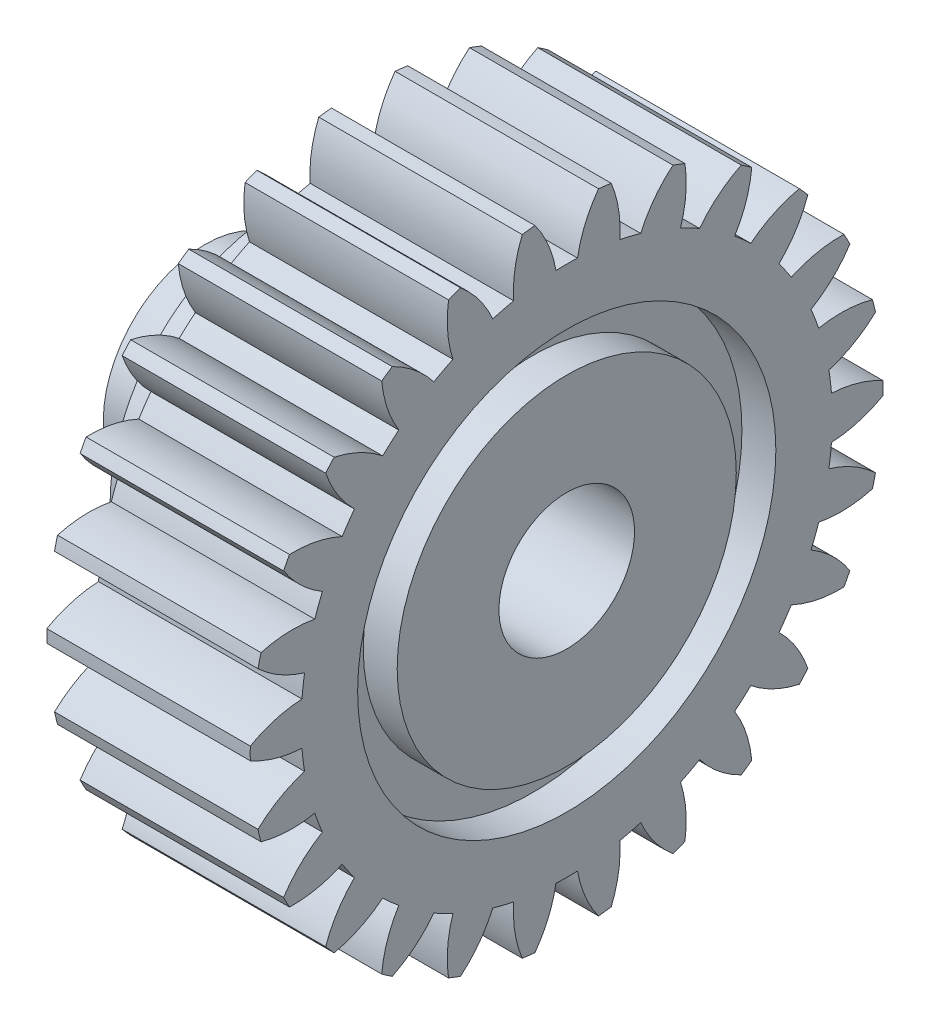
ISO-10303-21;
HEADER;
FILE_DESCRIPTION(('STEP AP214'),'2;1');
FILE_NAME('part.step','',(''),(''),'','','');
FILE_SCHEMA(('AUTOMOTIVE_DESIGN { 1 0 10303 214 1 1 1 1 }'));
ENDSEC;
DATA;
#1=APPLICATION_CONTEXT('core data for automotive mechanical design processes');
#2=APPLICATION_PROTOCOL_DEFINITION('international standard','automotive_design',2000,#1);
#3=PRODUCT_CONTEXT('',#1,'mechanical');
#4=PRODUCT('Part','Part','',(#3));
#5=PRODUCT_RELATED_PRODUCT_CATEGORY('part','',(#4));
#6=PRODUCT_DEFINITION_FORMATION('','',#4);
#7=PRODUCT_DEFINITION_CONTEXT('part definition',#1,'design');
#8=PRODUCT_DEFINITION('design','',#6,#7);
#9=PRODUCT_DEFINITION_SHAPE('','',#8);
#10=(LENGTH_UNIT() NAMED_UNIT(*) SI_UNIT(.MILLI.,.METRE.));
#11=(NAMED_UNIT(*) PLANE_ANGLE_UNIT() SI_UNIT($,.RADIAN.));
#12=(NAMED_UNIT(*) SI_UNIT($,.STERADIAN.) SOLID_ANGLE_UNIT());
#13=UNCERTAINTY_MEASURE_WITH_UNIT(LENGTH_MEASURE(1.E-05),#10,'distance_accuracy_value','');
#14=(GEOMETRIC_REPRESENTATION_CONTEXT(3) GLOBAL_UNCERTAINTY_ASSIGNED_CONTEXT((#13)) GLOBAL_UNIT_ASSIGNED_CONTEXT((#10,
#11,#12)) REPRESENTATION_CONTEXT('',''));
#15=CARTESIAN_POINT('',(0.,0.,0.));
#16=DIRECTION('',(0.,0.,1.));
#17=DIRECTION('',(1.,0.,0.));
#18=AXIS2_PLACEMENT_3D('',#15,#16,#17);
#19=CARTESIAN_POINT('',(-3.7,7.5,-14.));
#20=DIRECTION('',(1.,0.,0.));
#21=DIRECTION('',(0.,1.,0.));
#22=AXIS2_PLACEMENT_3D('',#19,#20,#21);
#23=PLANE('',#22);
#24=CARTESIAN_POINT('',(-3.7,0.,0.));
#25=DIRECTION('',(1.,0.,0.));
#26=DIRECTION('',(0.,1.,0.));
#27=AXIS2_PLACEMENT_3D('',#24,#25,#26);
#28=CIRCLE('',#27,7.5);
#29=CARTESIAN_POINT('',(-3.7,0.,-7.5));
#30=VERTEX_POINT('',#29);
#31=EDGE_CURVE('E2621',#30,#30,#28,.T.);
#32=ORIENTED_EDGE('',*,*,#31,.F.);
#33=EDGE_LOOP('',(#32));
#34=FACE_BOUND('',#33,.T.);
#35=CARTESIAN_POINT('',(-3.7,0.,0.));
#36=DIRECTION('',(1.,0.,0.));
#37=DIRECTION('',(0.,1.,0.));
#38=AXIS2_PLACEMENT_3D('',#35,#36,#37);
#39=CIRCLE('',#38,4.5);
#40=CARTESIAN_POINT('',(-3.7,4.5,0.));
#41=VERTEX_POINT('',#40);
#42=EDGE_CURVE('E11',#41,#41,#39,.F.);
#43=ORIENTED_EDGE('',*,*,#42,.F.);
#44=EDGE_LOOP('',(#43));
#45=FACE_BOUND('',#44,.T.);
#46=ADVANCED_FACE('F33',(#34,#45),#23,.F.);
#47=CARTESIAN_POINT('',(0.,0.,0.));
#48=DIRECTION('',(1.,0.,0.));
#49=DIRECTION('',(0.,0.,-1.));
#50=AXIS2_PLACEMENT_3D('',#47,#48,#49);
#51=PLANE('',#50);
#52=CARTESIAN_POINT('',(0.,4.25201091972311,11.4521246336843));
#53=DIRECTION('',(-1.,0.,0.));
#54=DIRECTION('',(0.,0.992708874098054,0.120536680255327));
#55=AXIS2_PLACEMENT_3D('',#52,#53,#54);
#56=CIRCLE('',#55,5.2);
#57=CARTESIAN_POINT('',(0.,-0.941530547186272,11.7112134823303));
#58=VERTEX_POINT('',#57);
#59=CARTESIAN_POINT('',(0.,-0.282618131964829,13.9971471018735));
#60=VERTEX_POINT('',#59);
#61=EDGE_CURVE('E48',#58,#60,#56,.T.);
#62=ORIENTED_EDGE('',*,*,#61,.T.);
#63=CARTESIAN_POINT('',(0.,0.,0.));
#64=DIRECTION('',(-1.,0.,0.));
#65=DIRECTION('',(0.,0.,1.));
#66=AXIS2_PLACEMENT_3D('',#63,#64,#65);
#67=CIRCLE('',#66,14.);
#68=CARTESIAN_POINT('',(0.,0.282618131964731,13.9971471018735));
#69=VERTEX_POINT('',#68);
#70=EDGE_CURVE('E1317',#60,#69,#67,.T.);
#71=ORIENTED_EDGE('',*,*,#70,.T.);
#72=CARTESIAN_POINT('',(0.,-4.25201091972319,11.4521246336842));
#73=DIRECTION('',(1.,0.,0.));
#74=DIRECTION('',(0.,0.,-1.));
#75=AXIS2_PLACEMENT_3D('',#72,#73,#74);
#76=CIRCLE('',#75,5.2);
#77=CARTESIAN_POINT('',(0.,0.941530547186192,11.7112134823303));
#78=VERTEX_POINT('',#77);
#79=EDGE_CURVE('E1296',#78,#69,#76,.T.);
#80=ORIENTED_EDGE('',*,*,#79,.F.);
#81=CARTESIAN_POINT('',(0.,0.,0.));
#82=DIRECTION('',(-1.,0.,0.));
#83=DIRECTION('',(0.,0.992708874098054,-0.12053668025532));
#84=AXIS2_PLACEMENT_3D('',#81,#82,#83);
#85=CIRCLE('',#84,11.749);
#86=CARTESIAN_POINT('',(0.,1.8885054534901,11.5962299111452));
#87=VERTEX_POINT('',#86);
#88=EDGE_CURVE('E714',#78,#87,#85,.T.);
#89=ORIENTED_EDGE('',*,*,#88,.T.);
#90=CARTESIAN_POINT('',(0.,6.86912802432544,10.1017738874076));
#91=DIRECTION('',(-1.,0.,0.));
#92=DIRECTION('',(0.,0.992708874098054,-0.12053668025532));
#93=AXIS2_PLACEMENT_3D('',#90,#91,#92);
#94=CIRCLE('',#93,5.2);
#95=CARTESIAN_POINT('',(0.,3.07533079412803,13.6580503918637));
#96=VERTEX_POINT('',#95);
#97=EDGE_CURVE('E56',#87,#96,#94,.T.);
#98=ORIENTED_EDGE('',*,*,#97,.T.);
#99=CARTESIAN_POINT('',(0.,3.62414231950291,13.522780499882));
#100=VERTEX_POINT('',#99);
#101=EDGE_CURVE('E1321',#96,#100,#67,.T.);
#102=ORIENTED_EDGE('',*,*,#101,.T.);
#103=CARTESIAN_POINT('',(0.,-1.3877823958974,12.1369195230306));
#104=DIRECTION('',(1.,0.,0.));
#105=DIRECTION('',(0.,0.,-1.));
#106=AXIS2_PLACEMENT_3D('',#103,#104,#105);
#107=CIRCLE('',#106,5.2);
#108=CARTESIAN_POINT('',(0.,3.71684821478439,11.1455838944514));
#109=VERTEX_POINT('',#108);
#110=EDGE_CURVE('E1294',#109,#100,#107,.T.);
#111=ORIENTED_EDGE('',*,*,#110,.F.);
#112=CARTESIAN_POINT('',(0.,0.,0.));
#113=DIRECTION('',(-1.,0.,0.));
#114=DIRECTION('',(0.,0.935016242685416,-0.354604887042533));
#115=AXIS2_PLACEMENT_3D('',#112,#113,#114);
#116=CIRCLE('',#115,11.749);
#117=CARTESIAN_POINT('',(0.,4.60878838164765,10.807315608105));
#118=VERTEX_POINT('',#117);
#119=EDGE_CURVE('E694',#109,#118,#116,.T.);
#120=ORIENTED_EDGE('',*,*,#119,.T.);
#121=CARTESIAN_POINT('',(0.,9.08703637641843,8.16434476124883));
#122=DIRECTION('',(-1.,0.,0.));
#123=DIRECTION('',(0.,0.935016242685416,-0.354604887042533));
#124=AXIS2_PLACEMENT_3D('',#121,#122,#123);
#125=CIRCLE('',#124,5.2);
#126=CARTESIAN_POINT('',(0.,6.25455267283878,12.525197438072));
#127=VERTEX_POINT('',#126);
#128=EDGE_CURVE('E706',#118,#127,#125,.T.);
#129=ORIENTED_EDGE('',*,*,#128,.T.);
#130=CARTESIAN_POINT('',(0.,6.75504452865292,12.2625190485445));
#131=VERTEX_POINT('',#130);
#132=EDGE_CURVE('E1325',#127,#131,#67,.T.);
#133=ORIENTED_EDGE('',*,*,#132,.T.);
#134=CARTESIAN_POINT('',(0.,1.55709899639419,12.1163607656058));
#135=DIRECTION('',(1.,0.,0.));
#136=DIRECTION('',(0.,0.,-1.));
#137=AXIS2_PLACEMENT_3D('',#134,#135,#136);
#138=CIRCLE('',#137,5.2);
#139=CARTESIAN_POINT('',(0.,6.27615617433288,9.932213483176));
#140=VERTEX_POINT('',#139);
#141=EDGE_CURVE('E1290',#140,#131,#138,.T.);
#142=ORIENTED_EDGE('',*,*,#141,.F.);
#143=CARTESIAN_POINT('',(0.,0.,0.));
#144=DIRECTION('',(-1.,0.,0.));
#145=DIRECTION('',(0.,0.822983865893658,-0.568064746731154));
#146=AXIS2_PLACEMENT_3D('',#143,#144,#145);
#147=CIRCLE('',#146,11.749);
#148=CARTESIAN_POINT('',(0.,7.06122528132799,9.3903194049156));
#149=VERTEX_POINT('',#148);
#150=EDGE_CURVE('E742',#140,#149,#147,.T.);
#151=ORIENTED_EDGE('',*,*,#150,.T.);
#152=CARTESIAN_POINT('',(0.,10.7768392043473,5.75243359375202));
#153=DIRECTION('',(-1.,0.,0.));
#154=DIRECTION('',(0.,0.822983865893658,-0.568064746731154));
#155=AXIS2_PLACEMENT_3D('',#152,#153,#154);
#156=CIRCLE('',#155,5.2);
#157=CARTESIAN_POINT('',(0.,9.07028268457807,10.6644255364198));
#158=VERTEX_POINT('',#157);
#159=EDGE_CURVE('E696',#149,#158,#156,.T.);
#160=ORIENTED_EDGE('',*,*,#159,.T.);
#161=CARTESIAN_POINT('',(0.,9.49336810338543,10.2896045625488));
#162=VERTEX_POINT('',#161);
#163=EDGE_CURVE('E1328',#158,#162,#67,.T.);
#164=ORIENTED_EDGE('',*,*,#163,.T.);
#165=CARTESIAN_POINT('',(0.,4.41148745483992,11.3916431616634));
#166=DIRECTION('',(1.,0.,0.));
#167=DIRECTION('',(0.,0.,-1.));
#168=AXIS2_PLACEMENT_3D('',#165,#166,#167);
#169=CIRCLE('',#168,5.2);
#170=CARTESIAN_POINT('',(0.,8.47071674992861,8.14161892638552));
#171=VERTEX_POINT('',#170);
#172=EDGE_CURVE('E1288',#171,#162,#169,.T.);
#173=ORIENTED_EDGE('',*,*,#172,.F.);
#174=CARTESIAN_POINT('',(0.,0.,0.));
#175=DIRECTION('',(-1.,0.,0.));
#176=DIRECTION('',(0.,0.663122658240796,-0.7485107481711));
#177=AXIS2_PLACEMENT_3D('',#174,#175,#176);
#178=CIRCLE('',#177,11.749);
#179=CARTESIAN_POINT('',(0.,9.1032894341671,7.42759197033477));
#180=VERTEX_POINT('',#179);
#181=EDGE_CURVE('E759',#171,#180,#178,.T.);
#182=ORIENTED_EDGE('',*,*,#181,.T.);
#183=CARTESIAN_POINT('',(0.,11.8403313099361,3.0062118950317));
#184=DIRECTION('',(-1.,0.,0.));
#185=DIRECTION('',(0.,0.663122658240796,-0.7485107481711));
#186=AXIS2_PLACEMENT_3D('',#183,#184,#185);
#187=CIRCLE('',#186,5.2);
#188=CARTESIAN_POINT('',(0.,11.3588808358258,8.18387598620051));
#189=VERTEX_POINT('',#188);
#190=EDGE_CURVE('E755',#180,#189,#187,.T.);
#191=ORIENTED_EDGE('',*,*,#190,.T.);
#192=CARTESIAN_POINT('',(0.,11.6799716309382,7.71869566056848));
#193=VERTEX_POINT('',#192);
#194=EDGE_CURVE('E1332',#189,#193,#67,.T.);
#195=ORIENTED_EDGE('',*,*,#194,.T.);
#196=CARTESIAN_POINT('',(0.,7.0094962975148,10.0048846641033));
#197=DIRECTION('',(1.,0.,0.));
#198=DIRECTION('',(0.,0.,-1.));
#199=AXIS2_PLACEMENT_3D('',#196,#197,#198);
#200=CIRCLE('',#199,5.2);
#201=CARTESIAN_POINT('',(0.,10.1729900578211,5.87786307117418));
#202=VERTEX_POINT('',#201);
#203=EDGE_CURVE('E1292',#202,#193,#200,.T.);
#204=ORIENTED_EDGE('',*,*,#203,.F.);
#205=CARTESIAN_POINT('',(0.,0.,0.));
#206=DIRECTION('',(-1.,0.,0.));
#207=DIRECTION('',(0.,0.46472317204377,-0.885456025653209));
#208=AXIS2_PLACEMENT_3D('',#205,#206,#207);
#209=CIRCLE('',#208,11.749);
#210=CARTESIAN_POINT('',(0.,10.6163034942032,5.03319988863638));
#211=VERTEX_POINT('',#210);
#212=EDGE_CURVE('E776',#202,#211,#209,.T.);
#213=ORIENTED_EDGE('',*,*,#212,.T.);
#214=CARTESIAN_POINT('',(0.,12.2157063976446,0.0852800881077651));
#215=DIRECTION('',(-1.,0.,0.));
#216=DIRECTION('',(0.,0.46472317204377,-0.885456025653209));
#217=AXIS2_PLACEMENT_3D('',#214,#215,#216);
#218=CIRCLE('',#217,5.2);
#219=CARTESIAN_POINT('',(0.,12.9873421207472,5.22770931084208));
#220=VERTEX_POINT('',#219);
#221=EDGE_CURVE('E772',#211,#220,#218,.T.);
#222=ORIENTED_EDGE('',*,*,#221,.T.);
#223=CARTESIAN_POINT('',(0.,13.1877776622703,4.69920422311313));
#224=VERTEX_POINT('',#223);
#225=EDGE_CURVE('E1240',#220,#224,#67,.T.);
#226=ORIENTED_EDGE('',*,*,#225,.T.);
#227=CARTESIAN_POINT('',(0.,9.20013869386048,8.03667863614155));
#228=DIRECTION('',(1.,0.,0.));
#229=DIRECTION('',(0.,0.,-1.));
#230=AXIS2_PLACEMENT_3D('',#227,#228,#229);
#231=CIRCLE('',#230,5.2);
#232=CARTESIAN_POINT('',(0.,11.2840461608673,3.27250717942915));
#233=VERTEX_POINT('',#232);
#234=EDGE_CURVE('E1249',#233,#224,#231,.T.);
#235=ORIENTED_EDGE('',*,*,#234,.F.);
#236=CARTESIAN_POINT('',(0.,0.,0.));
#237=DIRECTION('',(-1.,0.,0.));
#238=DIRECTION('',(0.,0.239315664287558,-0.970941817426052));
#239=AXIS2_PLACEMENT_3D('',#236,#237,#238);
#240=CIRCLE('',#239,11.749);
#241=CARTESIAN_POINT('',(0.,11.5123365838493,2.34629652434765));
#242=VERTEX_POINT('',#241);
#243=EDGE_CURVE('E1194',#233,#242,#240,.T.);
#244=ORIENTED_EDGE('',*,*,#243,.T.);
#245=CARTESIAN_POINT('',(0.,11.8811490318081,-2.84060788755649));
#246=DIRECTION('',(-1.,0.,0.));
#247=DIRECTION('',(0.,0.239315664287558,-0.970941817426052));
#248=AXIS2_PLACEMENT_3D('',#245,#246,#247);
#249=CIRCLE('',#248,5.2);
#250=CARTESIAN_POINT('',(0.,13.8610262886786,1.9677271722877));
#251=VERTEX_POINT('',#250);
#252=EDGE_CURVE('E1190',#242,#251,#249,.T.);
#253=ORIENTED_EDGE('',*,*,#252,.T.);
#254=CARTESIAN_POINT('',(0.,13.9291579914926,1.4066121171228));
#255=VERTEX_POINT('',#254);
#256=EDGE_CURVE('E1234',#251,#255,#67,.T.);
#257=ORIENTED_EDGE('',*,*,#256,.T.);
#258=CARTESIAN_POINT('',(0.,10.8561024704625,5.60141005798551));
#259=DIRECTION('',(1.,0.,0.));
#260=DIRECTION('',(0.,0.,-1.));
#261=AXIS2_PLACEMENT_3D('',#258,#259,#260);
#262=CIRCLE('',#261,5.2);
#263=CARTESIAN_POINT('',(0.,11.7393145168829,0.47696506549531));
#264=VERTEX_POINT('',#263);
#265=EDGE_CURVE('E1244',#264,#255,#262,.T.);
#266=ORIENTED_EDGE('',*,*,#265,.F.);
#267=CARTESIAN_POINT('',(0.,0.,0.));
#268=DIRECTION('',(-1.,0.,0.));
#269=DIRECTION('',(0.,0.,-1.));
#270=AXIS2_PLACEMENT_3D('',#267,#268,#269);
#271=CIRCLE('',#270,11.749);
#272=CARTESIAN_POINT('',(0.,11.7393145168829,-0.476965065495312));
#273=VERTEX_POINT('',#272);
#274=EDGE_CURVE('E1216',#264,#273,#271,.T.);
#275=ORIENTED_EDGE('',*,*,#274,.T.);
#276=CARTESIAN_POINT('',(0.,10.8561024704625,-5.60141005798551));
#277=DIRECTION('',(-1.,0.,0.));
#278=DIRECTION('',(0.,0.,-1.));
#279=AXIS2_PLACEMENT_3D('',#276,#277,#278);
#280=CIRCLE('',#279,5.2);
#281=CARTESIAN_POINT('',(0.,13.9291579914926,-1.4066121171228));
#282=VERTEX_POINT('',#281);
#283=EDGE_CURVE('E1212',#273,#282,#280,.T.);
#284=ORIENTED_EDGE('',*,*,#283,.T.);
#285=CARTESIAN_POINT('',(0.,13.8610262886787,-1.96772717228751));
#286=VERTEX_POINT('',#285);
#287=EDGE_CURVE('E1235',#282,#286,#67,.T.);
#288=ORIENTED_EDGE('',*,*,#287,.T.);
#289=CARTESIAN_POINT('',(0.,11.8811490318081,2.84060788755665));
#290=DIRECTION('',(1.,0.,0.));
#291=DIRECTION('',(0.,0.,-1.));
#292=AXIS2_PLACEMENT_3D('',#289,#290,#291);
#293=CIRCLE('',#292,5.2);
#294=CARTESIAN_POINT('',(0.,11.5123365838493,-2.34629652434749));
#295=VERTEX_POINT('',#294);
#296=EDGE_CURVE('E1258',#295,#286,#293,.T.);
#297=ORIENTED_EDGE('',*,*,#296,.F.);
#298=CARTESIAN_POINT('',(0.,0.,0.));
#299=DIRECTION('',(-1.,0.,0.));
#300=DIRECTION('',(0.,-0.239315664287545,-0.970941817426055));
#301=AXIS2_PLACEMENT_3D('',#298,#299,#300);
#302=CIRCLE('',#301,11.749);
#303=CARTESIAN_POINT('',(0.,11.2840461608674,-3.272507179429));
#304=VERTEX_POINT('',#303);
#305=EDGE_CURVE('E1016',#295,#304,#302,.T.);
#306=ORIENTED_EDGE('',*,*,#305,.T.);
#307=CARTESIAN_POINT('',(0.,9.20013869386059,-8.03667863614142));
#308=DIRECTION('',(-1.,0.,0.));
#309=DIRECTION('',(0.,-0.239315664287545,-0.970941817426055));
#310=AXIS2_PLACEMENT_3D('',#307,#308,#309);
#311=CIRCLE('',#310,5.2);
#312=CARTESIAN_POINT('',(0.,13.1877776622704,-4.69920422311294));
#313=VERTEX_POINT('',#312);
#314=EDGE_CURVE('E1021',#304,#313,#311,.T.);
#315=ORIENTED_EDGE('',*,*,#314,.T.);
#316=CARTESIAN_POINT('',(0.,12.9873421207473,-5.2277093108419));
#317=VERTEX_POINT('',#316);
#318=EDGE_CURVE('E1239',#313,#317,#67,.T.);
#319=ORIENTED_EDGE('',*,*,#318,.T.);
#320=CARTESIAN_POINT('',(0.,12.2157063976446,-0.0852800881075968));
#321=DIRECTION('',(1.,0.,0.));
#322=DIRECTION('',(0.,0.,-1.));
#323=AXIS2_PLACEMENT_3D('',#320,#321,#322);
#324=CIRCLE('',#323,5.2);
#325=CARTESIAN_POINT('',(0.,10.6163034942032,-5.03319988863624));
#326=VERTEX_POINT('',#325);
#327=EDGE_CURVE('E1260',#326,#317,#324,.T.);
#328=ORIENTED_EDGE('',*,*,#327,.F.);
#329=CARTESIAN_POINT('',(0.,0.,0.));
#330=DIRECTION('',(-1.,0.,0.));
#331=DIRECTION('',(0.,-0.464723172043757,-0.885456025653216));
#332=AXIS2_PLACEMENT_3D('',#329,#330,#331);
#333=CIRCLE('',#332,11.749);
#334=CARTESIAN_POINT('',(0.,10.1729900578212,-5.87786307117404));
#335=VERTEX_POINT('',#334);
#336=EDGE_CURVE('E997',#326,#335,#333,.T.);
#337=ORIENTED_EDGE('',*,*,#336,.T.);
#338=CARTESIAN_POINT('',(0.,7.00949629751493,-10.0048846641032));
#339=DIRECTION('',(-1.,0.,0.));
#340=DIRECTION('',(0.,-0.464723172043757,-0.885456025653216));
#341=AXIS2_PLACEMENT_3D('',#338,#339,#340);
#342=CIRCLE('',#341,5.2);
#343=CARTESIAN_POINT('',(0.,11.6799716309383,-7.71869566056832));
#344=VERTEX_POINT('',#343);
#345=EDGE_CURVE('E1002',#335,#344,#342,.T.);
#346=ORIENTED_EDGE('',*,*,#345,.T.);
#347=CARTESIAN_POINT('',(0.,11.3588808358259,-8.18387598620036));
#348=VERTEX_POINT('',#347);
#349=EDGE_CURVE('E1343',#344,#348,#67,.T.);
#350=ORIENTED_EDGE('',*,*,#349,.T.);
#351=CARTESIAN_POINT('',(0.,11.8403313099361,-3.00621189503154));
#352=DIRECTION('',(1.,0.,0.));
#353=DIRECTION('',(0.,0.,-1.));
#354=AXIS2_PLACEMENT_3D('',#351,#352,#353);
#355=CIRCLE('',#354,5.2);
#356=CARTESIAN_POINT('',(0.,9.1032894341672,-7.42759197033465));
#357=VERTEX_POINT('',#356);
#358=EDGE_CURVE('E1262',#357,#348,#355,.T.);
#359=ORIENTED_EDGE('',*,*,#358,.F.);
#360=CARTESIAN_POINT('',(0.,0.,0.));
#361=DIRECTION('',(-1.,0.,0.));
#362=DIRECTION('',(0.,-0.663122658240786,-0.748510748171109));
#363=AXIS2_PLACEMENT_3D('',#360,#361,#362);
#364=CIRCLE('',#363,11.749);
#365=CARTESIAN_POINT('',(0.,8.47071674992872,-8.1416189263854));
#366=VERTEX_POINT('',#365);
#367=EDGE_CURVE('E1033',#357,#366,#364,.T.);
#368=ORIENTED_EDGE('',*,*,#367,.T.);
#369=CARTESIAN_POINT('',(0.,4.41148745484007,-11.3916431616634));
#370=DIRECTION('',(-1.,0.,0.));
#371=DIRECTION('',(0.,-0.663122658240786,-0.748510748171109));
#372=AXIS2_PLACEMENT_3D('',#369,#370,#371);
#373=CIRCLE('',#372,5.2);
#374=CARTESIAN_POINT('',(0.,9.49336810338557,-10.2896045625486));
#375=VERTEX_POINT('',#374);
#376=EDGE_CURVE('E1012',#366,#375,#373,.T.);
#377=ORIENTED_EDGE('',*,*,#376,.T.);
#378=CARTESIAN_POINT('',(0.,9.07028268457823,-10.6644255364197));
#379=VERTEX_POINT('',#378);
#380=EDGE_CURVE('E1347',#375,#379,#67,.T.);
#381=ORIENTED_EDGE('',*,*,#380,.T.);
#382=CARTESIAN_POINT('',(0.,10.7768392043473,-5.75243359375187));
#383=DIRECTION('',(1.,0.,0.));
#384=DIRECTION('',(0.,0.,-1.));
#385=AXIS2_PLACEMENT_3D('',#382,#383,#384);
#386=CIRCLE('',#385,5.2);
#387=CARTESIAN_POINT('',(0.,7.06122528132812,-9.3903194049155));
#388=VERTEX_POINT('',#387);
#389=EDGE_CURVE('E1254',#388,#379,#386,.T.);
#390=ORIENTED_EDGE('',*,*,#389,.F.);
#391=CARTESIAN_POINT('',(0.,0.,0.));
#392=DIRECTION('',(-1.,0.,0.));
#393=DIRECTION('',(0.,-0.822983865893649,-0.568064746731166));
#394=AXIS2_PLACEMENT_3D('',#391,#392,#393);
#395=CIRCLE('',#394,11.749);
#396=CARTESIAN_POINT('',(0.,6.27615617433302,-9.93221348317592));
#397=VERTEX_POINT('',#396);
#398=EDGE_CURVE('E1067',#388,#397,#395,.T.);
#399=ORIENTED_EDGE('',*,*,#398,.T.);
#400=CARTESIAN_POINT('',(0.,1.55709899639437,-12.1163607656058));
#401=DIRECTION('',(-1.,0.,0.));
#402=DIRECTION('',(0.,-0.822983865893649,-0.568064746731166));
#403=AXIS2_PLACEMENT_3D('',#400,#401,#402);
#404=CIRCLE('',#403,5.2);
#405=CARTESIAN_POINT('',(0.,6.75504452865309,-12.2625190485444));
#406=VERTEX_POINT('',#405);
#407=EDGE_CURVE('E1046',#397,#406,#404,.T.);
#408=ORIENTED_EDGE('',*,*,#407,.T.);
#409=CARTESIAN_POINT('',(0.,6.25455267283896,-12.5251974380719));
#410=VERTEX_POINT('',#409);
#411=EDGE_CURVE('E1351',#406,#410,#67,.T.);
#412=ORIENTED_EDGE('',*,*,#411,.T.);
#413=CARTESIAN_POINT('',(0.,9.08703637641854,-8.1643447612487));
#414=DIRECTION('',(1.,0.,0.));
#415=DIRECTION('',(0.,0.,-1.));
#416=AXIS2_PLACEMENT_3D('',#413,#414,#415);
#417=CIRCLE('',#416,5.2);
#418=CARTESIAN_POINT('',(0.,4.6087883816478,-10.8073156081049));
#419=VERTEX_POINT('',#418);
#420=EDGE_CURVE('E1256',#419,#410,#417,.T.);
#421=ORIENTED_EDGE('',*,*,#420,.F.);
#422=CARTESIAN_POINT('',(0.,0.,0.));
#423=DIRECTION('',(-1.,0.,0.));
#424=DIRECTION('',(0.,-0.935016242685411,-0.354604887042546));
#425=AXIS2_PLACEMENT_3D('',#422,#423,#424);
#426=CIRCLE('',#425,11.749);
#427=CARTESIAN_POINT('',(0.,3.71684821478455,-11.1455838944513));
#428=VERTEX_POINT('',#427);
#429=EDGE_CURVE('E1084',#419,#428,#426,.T.);
#430=ORIENTED_EDGE('',*,*,#429,.T.);
#431=CARTESIAN_POINT('',(0.,-1.38778239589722,-12.1369195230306));
#432=DIRECTION('',(-1.,0.,0.));
#433=DIRECTION('',(0.,-0.935016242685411,-0.354604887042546));
#434=AXIS2_PLACEMENT_3D('',#431,#432,#433);
#435=CIRCLE('',#434,5.2);
#436=CARTESIAN_POINT('',(0.,3.6241423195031,-13.5227804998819));
#437=VERTEX_POINT('',#436);
#438=EDGE_CURVE('E1080',#428,#437,#435,.T.);
#439=ORIENTED_EDGE('',*,*,#438,.T.);
#440=CARTESIAN_POINT('',(0.,3.07533079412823,-13.6580503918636));
#441=VERTEX_POINT('',#440);
#442=EDGE_CURVE('E1355',#437,#441,#67,.T.);
#443=ORIENTED_EDGE('',*,*,#442,.T.);
#444=CARTESIAN_POINT('',(0.,6.86912802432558,-10.1017738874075));
#445=DIRECTION('',(1.,0.,0.));
#446=DIRECTION('',(0.,0.,-1.));
#447=AXIS2_PLACEMENT_3D('',#444,#445,#446);
#448=CIRCLE('',#447,5.2);
#449=CARTESIAN_POINT('',(0.,1.88850545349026,-11.5962299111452));
#450=VERTEX_POINT('',#449);
#451=EDGE_CURVE('E1252',#450,#441,#448,.T.);
#452=ORIENTED_EDGE('',*,*,#451,.F.);
#453=CARTESIAN_POINT('',(0.,0.,0.));
#454=DIRECTION('',(-1.,0.,0.));
#455=DIRECTION('',(0.,-0.992708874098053,-0.120536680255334));
#456=AXIS2_PLACEMENT_3D('',#453,#454,#455);
#457=CIRCLE('',#456,11.749);
#458=CARTESIAN_POINT('',(0.,0.941530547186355,-11.7112134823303));
#459=VERTEX_POINT('',#458);
#460=EDGE_CURVE('E1050',#450,#459,#457,.T.);
#461=ORIENTED_EDGE('',*,*,#460,.T.);
#462=CARTESIAN_POINT('',(0.,-4.25201091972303,-11.4521246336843));
#463=DIRECTION('',(-1.,0.,0.));
#464=DIRECTION('',(0.,-0.992708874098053,-0.120536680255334));
#465=AXIS2_PLACEMENT_3D('',#462,#463,#464);
#466=CIRCLE('',#465,5.2);
#467=CARTESIAN_POINT('',(0.,0.282618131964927,-13.9971471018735));
#468=VERTEX_POINT('',#467);
#469=EDGE_CURVE('E1055',#459,#468,#466,.T.);
#470=ORIENTED_EDGE('',*,*,#469,.T.);
#471=CARTESIAN_POINT('',(0.,-0.282618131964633,-13.9971471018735));
#472=VERTEX_POINT('',#471);
#473=EDGE_CURVE('E1359',#468,#472,#67,.T.);
#474=ORIENTED_EDGE('',*,*,#473,.T.);
#475=CARTESIAN_POINT('',(0.,4.25201091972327,-11.4521246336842));
#476=DIRECTION('',(1.,0.,0.));
#477=DIRECTION('',(0.,0.,-1.));
#478=AXIS2_PLACEMENT_3D('',#475,#476,#477);
#479=CIRCLE('',#478,5.2);
#480=CARTESIAN_POINT('',(0.,-0.94153054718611,-11.7112134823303));
#481=VERTEX_POINT('',#480);
#482=EDGE_CURVE('E1270',#481,#472,#479,.T.);
#483=ORIENTED_EDGE('',*,*,#482,.F.);
#484=CARTESIAN_POINT('',(0.,0.,0.));
#485=DIRECTION('',(-1.,0.,0.));
#486=DIRECTION('',(0.,-0.992708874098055,0.120536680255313));
#487=AXIS2_PLACEMENT_3D('',#484,#485,#486);
#488=CIRCLE('',#487,11.749);
#489=CARTESIAN_POINT('',(0.,-1.88850545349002,-11.5962299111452));
#490=VERTEX_POINT('',#489);
#491=EDGE_CURVE('E914',#481,#490,#488,.T.);
#492=ORIENTED_EDGE('',*,*,#491,.T.);
#493=CARTESIAN_POINT('',(0.,-6.86912802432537,-10.1017738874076));
#494=DIRECTION('',(-1.,0.,0.));
#495=DIRECTION('',(0.,-0.992708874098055,0.120536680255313));
#496=AXIS2_PLACEMENT_3D('',#493,#494,#495);
#497=CIRCLE('',#496,5.2);
#498=CARTESIAN_POINT('',(0.,-3.07533079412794,-13.6580503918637));
#499=VERTEX_POINT('',#498);
#500=EDGE_CURVE('E919',#490,#499,#497,.T.);
#501=ORIENTED_EDGE('',*,*,#500,.T.);
#502=CARTESIAN_POINT('',(0.,-3.62414231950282,-13.522780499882));
#503=VERTEX_POINT('',#502);
#504=EDGE_CURVE('E1363',#499,#503,#67,.T.);
#505=ORIENTED_EDGE('',*,*,#504,.T.);
#506=CARTESIAN_POINT('',(0.,1.38778239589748,-12.1369195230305));
#507=DIRECTION('',(1.,0.,0.));
#508=DIRECTION('',(0.,0.,-1.));
#509=AXIS2_PLACEMENT_3D('',#506,#507,#508);
#510=CIRCLE('',#509,5.2);
#511=CARTESIAN_POINT('',(0.,-3.71684821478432,-11.1455838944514));
#512=VERTEX_POINT('',#511);
#513=EDGE_CURVE('E1272',#512,#503,#510,.T.);
#514=ORIENTED_EDGE('',*,*,#513,.F.);
#515=CARTESIAN_POINT('',(0.,0.,0.));
#516=DIRECTION('',(-1.,0.,0.));
#517=DIRECTION('',(0.,-0.935016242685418,0.354604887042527));
#518=AXIS2_PLACEMENT_3D('',#515,#516,#517);
#519=CIRCLE('',#518,11.749);
#520=CARTESIAN_POINT('',(0.,-4.60878838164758,-10.807315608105));
#521=VERTEX_POINT('',#520);
#522=EDGE_CURVE('E895',#512,#521,#519,.T.);
#523=ORIENTED_EDGE('',*,*,#522,.T.);
#524=CARTESIAN_POINT('',(0.,-9.08703637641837,-8.16434476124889));
#525=DIRECTION('',(-1.,0.,0.));
#526=DIRECTION('',(0.,-0.935016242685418,0.354604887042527));
#527=AXIS2_PLACEMENT_3D('',#524,#525,#526);
#528=CIRCLE('',#527,5.2);
#529=CARTESIAN_POINT('',(0.,-6.2545526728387,-12.525197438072));
#530=VERTEX_POINT('',#529);
#531=EDGE_CURVE('E900',#521,#530,#528,.T.);
#532=ORIENTED_EDGE('',*,*,#531,.T.);
#533=CARTESIAN_POINT('',(0.,-6.75504452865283,-12.2625190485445));
#534=VERTEX_POINT('',#533);
#535=EDGE_CURVE('E1367',#530,#534,#67,.T.);
#536=ORIENTED_EDGE('',*,*,#535,.T.);
#537=CARTESIAN_POINT('',(0.,-1.55709899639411,-12.1163607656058));
#538=DIRECTION('',(1.,0.,0.));
#539=DIRECTION('',(0.,0.,-1.));
#540=AXIS2_PLACEMENT_3D('',#537,#538,#539);
#541=CIRCLE('',#540,5.2);
#542=CARTESIAN_POINT('',(0.,-6.27615617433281,-9.93221348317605));
#543=VERTEX_POINT('',#542);
#544=EDGE_CURVE('E1274',#543,#534,#541,.T.);
#545=ORIENTED_EDGE('',*,*,#544,.F.);
#546=CARTESIAN_POINT('',(0.,0.,0.));
#547=DIRECTION('',(-1.,0.,0.));
#548=DIRECTION('',(0.,-0.822983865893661,0.568064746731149));
#549=AXIS2_PLACEMENT_3D('',#546,#547,#548);
#550=CIRCLE('',#549,11.749);
#551=CARTESIAN_POINT('',(0.,-7.06122528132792,-9.39031940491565));
#552=VERTEX_POINT('',#551);
#553=EDGE_CURVE('E931',#543,#552,#550,.T.);
#554=ORIENTED_EDGE('',*,*,#553,.T.);
#555=CARTESIAN_POINT('',(0.,-10.7768392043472,-5.75243359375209));
#556=DIRECTION('',(-1.,0.,0.));
#557=DIRECTION('',(0.,-0.822983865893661,0.568064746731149));
#558=AXIS2_PLACEMENT_3D('',#555,#556,#557);
#559=CIRCLE('',#558,5.2);
#560=CARTESIAN_POINT('',(0.,-9.07028268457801,-10.6644255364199));
#561=VERTEX_POINT('',#560);
#562=EDGE_CURVE('E910',#552,#561,#559,.T.);
#563=ORIENTED_EDGE('',*,*,#562,.T.);
#564=CARTESIAN_POINT('',(0.,-9.49336810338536,-10.2896045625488));
#565=VERTEX_POINT('',#564);
#566=EDGE_CURVE('E1371',#561,#565,#67,.T.);
#567=ORIENTED_EDGE('',*,*,#566,.T.);
#568=CARTESIAN_POINT('',(0.,-4.41148745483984,-11.3916431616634));
#569=DIRECTION('',(1.,0.,0.));
#570=DIRECTION('',(0.,0.,-1.));
#571=AXIS2_PLACEMENT_3D('',#568,#569,#570);
#572=CIRCLE('',#571,5.2);
#573=CARTESIAN_POINT('',(0.,-8.47071674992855,-8.14161892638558));
#574=VERTEX_POINT('',#573);
#575=EDGE_CURVE('E1266',#574,#565,#572,.T.);
#576=ORIENTED_EDGE('',*,*,#575,.F.);
#577=CARTESIAN_POINT('',(0.,0.,0.));
#578=DIRECTION('',(-1.,0.,0.));
#579=DIRECTION('',(0.,-0.663122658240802,0.748510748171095));
#580=AXIS2_PLACEMENT_3D('',#577,#578,#579);
#581=CIRCLE('',#580,11.749);
#582=CARTESIAN_POINT('',(0.,-9.10328943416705,-7.42759197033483));
#583=VERTEX_POINT('',#582);
#584=EDGE_CURVE('E965',#574,#583,#581,.T.);
#585=ORIENTED_EDGE('',*,*,#584,.T.);
#586=CARTESIAN_POINT('',(0.,-11.8403313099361,-3.00621189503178));
#587=DIRECTION('',(-1.,0.,0.));
#588=DIRECTION('',(0.,-0.663122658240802,0.748510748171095));
#589=AXIS2_PLACEMENT_3D('',#586,#587,#588);
#590=CIRCLE('',#589,5.2);
#591=CARTESIAN_POINT('',(0.,-11.3588808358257,-8.18387598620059));
#592=VERTEX_POINT('',#591);
#593=EDGE_CURVE('E944',#583,#592,#590,.T.);
#594=ORIENTED_EDGE('',*,*,#593,.T.);
#595=CARTESIAN_POINT('',(0.,-11.6799716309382,-7.71869566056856));
#596=VERTEX_POINT('',#595);
#597=EDGE_CURVE('E1375',#592,#596,#67,.T.);
#598=ORIENTED_EDGE('',*,*,#597,.T.);
#599=CARTESIAN_POINT('',(0.,-7.00949629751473,-10.0048846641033));
#600=DIRECTION('',(1.,0.,0.));
#601=DIRECTION('',(0.,0.,-1.));
#602=AXIS2_PLACEMENT_3D('',#599,#600,#601);
#603=CIRCLE('',#602,5.2);
#604=CARTESIAN_POINT('',(0.,-10.1729900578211,-5.87786307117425));
#605=VERTEX_POINT('',#604);
#606=EDGE_CURVE('E1268',#605,#596,#603,.T.);
#607=ORIENTED_EDGE('',*,*,#606,.F.);
#608=CARTESIAN_POINT('',(0.,0.,0.));
#609=DIRECTION('',(-1.,0.,0.));
#610=DIRECTION('',(0.,-0.464723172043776,0.885456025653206));
#611=AXIS2_PLACEMENT_3D('',#608,#609,#610);
#612=CIRCLE('',#611,11.749);
#613=CARTESIAN_POINT('',(0.,-10.6163034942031,-5.03319988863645));
#614=VERTEX_POINT('',#613);
#615=EDGE_CURVE('E982',#605,#614,#612,.T.);
#616=ORIENTED_EDGE('',*,*,#615,.T.);
#617=CARTESIAN_POINT('',(0.,-12.2157063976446,-0.0852800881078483));
#618=DIRECTION('',(-1.,0.,0.));
#619=DIRECTION('',(0.,-0.464723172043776,0.885456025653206));
#620=AXIS2_PLACEMENT_3D('',#617,#618,#619);
#621=CIRCLE('',#620,5.2);
#622=CARTESIAN_POINT('',(0.,-12.9873421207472,-5.22770931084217));
#623=VERTEX_POINT('',#622);
#624=EDGE_CURVE('E978',#614,#623,#621,.T.);
#625=ORIENTED_EDGE('',*,*,#624,.T.);
#626=CARTESIAN_POINT('',(0.,-13.1877776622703,-4.69920422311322));
#627=VERTEX_POINT('',#626);
#628=EDGE_CURVE('E1379',#623,#627,#67,.T.);
#629=ORIENTED_EDGE('',*,*,#628,.T.);
#630=CARTESIAN_POINT('',(0.,-9.20013869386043,-8.03667863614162));
#631=DIRECTION('',(1.,0.,0.));
#632=DIRECTION('',(0.,0.,-1.));
#633=AXIS2_PLACEMENT_3D('',#630,#631,#632);
#634=CIRCLE('',#633,5.2);
#635=CARTESIAN_POINT('',(0.,-11.2840461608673,-3.27250717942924));
#636=VERTEX_POINT('',#635);
#637=EDGE_CURVE('E1264',#636,#627,#634,.T.);
#638=ORIENTED_EDGE('',*,*,#637,.F.);
#639=CARTESIAN_POINT('',(0.,0.,0.));
#640=DIRECTION('',(-1.,0.,0.));
#641=DIRECTION('',(0.,-0.239315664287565,0.97094181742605));
#642=AXIS2_PLACEMENT_3D('',#639,#640,#641);
#643=CIRCLE('',#642,11.749);
#644=CARTESIAN_POINT('',(0.,-11.5123365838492,-2.34629652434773));
#645=VERTEX_POINT('',#644);
#646=EDGE_CURVE('E948',#636,#645,#643,.T.);
#647=ORIENTED_EDGE('',*,*,#646,.T.);
#648=CARTESIAN_POINT('',(0.,-11.8811490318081,2.8406078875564));
#649=DIRECTION('',(-1.,0.,0.));
#650=DIRECTION('',(0.,-0.239315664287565,0.97094181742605));
#651=AXIS2_PLACEMENT_3D('',#648,#649,#650);
#652=CIRCLE('',#651,5.2);
#653=CARTESIAN_POINT('',(0.,-13.8610262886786,-1.9677271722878));
#654=VERTEX_POINT('',#653);
#655=EDGE_CURVE('E953',#645,#654,#652,.T.);
#656=ORIENTED_EDGE('',*,*,#655,.T.);
#657=CARTESIAN_POINT('',(0.,-13.9291579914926,-1.40661211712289));
#658=VERTEX_POINT('',#657);
#659=EDGE_CURVE('E1383',#654,#658,#67,.T.);
#660=ORIENTED_EDGE('',*,*,#659,.T.);
#661=CARTESIAN_POINT('',(0.,-10.8561024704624,-5.60141005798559));
#662=DIRECTION('',(1.,0.,0.));
#663=DIRECTION('',(0.,0.,-1.));
#664=AXIS2_PLACEMENT_3D('',#661,#662,#663);
#665=CIRCLE('',#664,5.2);
#666=CARTESIAN_POINT('',(0.,-11.7393145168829,-0.476965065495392));
#667=VERTEX_POINT('',#666);
#668=EDGE_CURVE('E1286',#667,#658,#665,.T.);
#669=ORIENTED_EDGE('',*,*,#668,.F.);
#670=CARTESIAN_POINT('',(0.,0.,0.));
#671=DIRECTION('',(-1.,0.,0.));
#672=DIRECTION('',(0.,0.,1.));
#673=AXIS2_PLACEMENT_3D('',#670,#671,#672);
#674=CIRCLE('',#673,11.749);
#675=CARTESIAN_POINT('',(0.,-11.7393145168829,0.47696506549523));
#676=VERTEX_POINT('',#675);
#677=EDGE_CURVE('E829',#667,#676,#674,.T.);
#678=ORIENTED_EDGE('',*,*,#677,.T.);
#679=CARTESIAN_POINT('',(0.,-10.8561024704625,5.60141005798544));
#680=DIRECTION('',(-1.,0.,0.));
#681=DIRECTION('',(0.,0.,1.));
#682=AXIS2_PLACEMENT_3D('',#679,#680,#681);
#683=CIRCLE('',#682,5.2);
#684=CARTESIAN_POINT('',(0.,-13.9291579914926,1.4066121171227));
#685=VERTEX_POINT('',#684);
#686=EDGE_CURVE('E834',#676,#685,#683,.T.);
#687=ORIENTED_EDGE('',*,*,#686,.T.);
#688=CARTESIAN_POINT('',(0.,-13.8610262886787,1.9677271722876));
#689=VERTEX_POINT('',#688);
#690=EDGE_CURVE('E1387',#685,#689,#67,.T.);
#691=ORIENTED_EDGE('',*,*,#690,.T.);
#692=CARTESIAN_POINT('',(0.,-11.8811490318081,-2.84060788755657));
#693=DIRECTION('',(1.,0.,0.));
#694=DIRECTION('',(0.,0.,-1.));
#695=AXIS2_PLACEMENT_3D('',#692,#693,#694);
#696=CIRCLE('',#695,5.2);
#697=CARTESIAN_POINT('',(0.,-11.5123365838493,2.34629652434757));
#698=VERTEX_POINT('',#697);
#699=EDGE_CURVE('E1284',#698,#689,#696,.T.);
#700=ORIENTED_EDGE('',*,*,#699,.F.);
#701=CARTESIAN_POINT('',(0.,0.,0.));
#702=DIRECTION('',(-1.,0.,0.));
#703=DIRECTION('',(0.,0.239315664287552,0.970941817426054));
#704=AXIS2_PLACEMENT_3D('',#701,#702,#703);
#705=CIRCLE('',#704,11.749);
#706=CARTESIAN_POINT('',(0.,-11.2840461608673,3.27250717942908));
#707=VERTEX_POINT('',#706);
#708=EDGE_CURVE('E812',#698,#707,#705,.T.);
#709=ORIENTED_EDGE('',*,*,#708,.T.);
#710=CARTESIAN_POINT('',(0.,-9.20013869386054,8.03667863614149));
#711=DIRECTION('',(-1.,0.,0.));
#712=DIRECTION('',(0.,0.239315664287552,0.970941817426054));
#713=AXIS2_PLACEMENT_3D('',#710,#711,#712);
#714=CIRCLE('',#713,5.2);
#715=CARTESIAN_POINT('',(0.,-13.1877776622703,4.69920422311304));
#716=VERTEX_POINT('',#715);
#717=EDGE_CURVE('E817',#707,#716,#714,.T.);
#718=ORIENTED_EDGE('',*,*,#717,.T.);
#719=CARTESIAN_POINT('',(0.,-12.9873421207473,5.22770931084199));
#720=VERTEX_POINT('',#719);
#721=EDGE_CURVE('E1391',#716,#720,#67,.T.);
#722=ORIENTED_EDGE('',*,*,#721,.T.);
#723=CARTESIAN_POINT('',(0.,-12.2157063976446,0.0852800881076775));
#724=DIRECTION('',(1.,0.,0.));
#725=DIRECTION('',(0.,0.,-1.));
#726=AXIS2_PLACEMENT_3D('',#723,#724,#725);
#727=CIRCLE('',#726,5.2);
#728=CARTESIAN_POINT('',(0.,-10.6163034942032,5.03319988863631));
#729=VERTEX_POINT('',#728);
#730=EDGE_CURVE('E1282',#729,#720,#727,.T.);
#731=ORIENTED_EDGE('',*,*,#730,.F.);
#732=CARTESIAN_POINT('',(0.,0.,0.));
#733=DIRECTION('',(-1.,0.,0.));
#734=DIRECTION('',(0.,0.464723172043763,0.885456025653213));
#735=AXIS2_PLACEMENT_3D('',#732,#733,#734);
#736=CIRCLE('',#735,11.749);
#737=CARTESIAN_POINT('',(0.,-10.1729900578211,5.87786307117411));
#738=VERTEX_POINT('',#737);
#739=EDGE_CURVE('E793',#729,#738,#736,.T.);
#740=ORIENTED_EDGE('',*,*,#739,.T.);
#741=CARTESIAN_POINT('',(0.,-7.00949629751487,10.0048846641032));
#742=DIRECTION('',(-1.,0.,0.));
#743=DIRECTION('',(0.,0.464723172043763,0.885456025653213));
#744=AXIS2_PLACEMENT_3D('',#741,#742,#743);
#745=CIRCLE('',#744,5.2);
#746=CARTESIAN_POINT('',(0.,-11.6799716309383,7.71869566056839));
#747=VERTEX_POINT('',#746);
#748=EDGE_CURVE('E798',#738,#747,#745,.T.);
#749=ORIENTED_EDGE('',*,*,#748,.T.);
#750=CARTESIAN_POINT('',(0.,-11.3588808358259,8.18387598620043));
#751=VERTEX_POINT('',#750);
#752=EDGE_CURVE('E1395',#747,#751,#67,.T.);
#753=ORIENTED_EDGE('',*,*,#752,.T.);
#754=CARTESIAN_POINT('',(0.,-11.8403313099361,3.00621189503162));
#755=DIRECTION('',(1.,0.,0.));
#756=DIRECTION('',(0.,0.,-1.));
#757=AXIS2_PLACEMENT_3D('',#754,#755,#756);
#758=CIRCLE('',#757,5.2);
#759=CARTESIAN_POINT('',(0.,-9.10328943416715,7.42759197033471));
#760=VERTEX_POINT('',#759);
#761=EDGE_CURVE('E1278',#760,#751,#758,.T.);
#762=ORIENTED_EDGE('',*,*,#761,.F.);
#763=CARTESIAN_POINT('',(0.,0.,0.));
#764=DIRECTION('',(-1.,0.,0.));
#765=DIRECTION('',(0.,0.663122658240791,0.748510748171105));
#766=AXIS2_PLACEMENT_3D('',#763,#764,#765);
#767=CIRCLE('',#766,11.749);
#768=CARTESIAN_POINT('',(0.,-8.47071674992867,8.14161892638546));
#769=VERTEX_POINT('',#768);
#770=EDGE_CURVE('E846',#760,#769,#767,.T.);
#771=ORIENTED_EDGE('',*,*,#770,.T.);
#772=CARTESIAN_POINT('',(0.,-4.41148745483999,11.3916431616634));
#773=DIRECTION('',(-1.,0.,0.));
#774=DIRECTION('',(0.,0.663122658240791,0.748510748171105));
#775=AXIS2_PLACEMENT_3D('',#772,#773,#774);
#776=CIRCLE('',#775,5.2);
#777=CARTESIAN_POINT('',(0.,-9.4933681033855,10.2896045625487));
#778=VERTEX_POINT('',#777);
#779=EDGE_CURVE('E808',#769,#778,#776,.T.);
#780=ORIENTED_EDGE('',*,*,#779,.T.);
#781=CARTESIAN_POINT('',(0.,-9.07028268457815,10.6644255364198));
#782=VERTEX_POINT('',#781);
#783=EDGE_CURVE('E1319',#778,#782,#67,.T.);
#784=ORIENTED_EDGE('',*,*,#783,.T.);
#785=CARTESIAN_POINT('',(0.,-10.7768392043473,5.75243359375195));
#786=DIRECTION('',(1.,0.,0.));
#787=DIRECTION('',(0.,0.,-1.));
#788=AXIS2_PLACEMENT_3D('',#785,#786,#787);
#789=CIRCLE('',#788,5.2);
#790=CARTESIAN_POINT('',(0.,-7.06122528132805,9.39031940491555));
#791=VERTEX_POINT('',#790);
#792=EDGE_CURVE('E1276',#791,#782,#789,.T.);
#793=ORIENTED_EDGE('',*,*,#792,.F.);
#794=CARTESIAN_POINT('',(0.,0.,0.));
#795=DIRECTION('',(-1.,0.,0.));
#796=DIRECTION('',(0.,0.822983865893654,0.56806474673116));
#797=AXIS2_PLACEMENT_3D('',#794,#795,#796);
#798=CIRCLE('',#797,11.749);
#799=CARTESIAN_POINT('',(0.,-6.27615617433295,9.93221348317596));
#800=VERTEX_POINT('',#799);
#801=EDGE_CURVE('E863',#791,#800,#798,.T.);
#802=ORIENTED_EDGE('',*,*,#801,.T.);
#803=CARTESIAN_POINT('',(0.,-1.55709899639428,12.1163607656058));
#804=DIRECTION('',(-1.,0.,0.));
#805=DIRECTION('',(0.,0.822983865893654,0.56806474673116));
#806=AXIS2_PLACEMENT_3D('',#803,#804,#805);
#807=CIRCLE('',#806,5.2);
#808=CARTESIAN_POINT('',(0.,-6.755044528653,12.2625190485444));
#809=VERTEX_POINT('',#808);
#810=EDGE_CURVE('E859',#800,#809,#807,.T.);
#811=ORIENTED_EDGE('',*,*,#810,.T.);
#812=CARTESIAN_POINT('',(0.,-6.25455267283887,12.5251974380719));
#813=VERTEX_POINT('',#812);
#814=EDGE_CURVE('E1316',#809,#813,#67,.T.);
#815=ORIENTED_EDGE('',*,*,#814,.T.);
#816=CARTESIAN_POINT('',(0.,-9.08703637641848,8.16434476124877));
#817=DIRECTION('',(1.,0.,0.));
#818=DIRECTION('',(0.,0.,-1.));
#819=AXIS2_PLACEMENT_3D('',#816,#817,#818);
#820=CIRCLE('',#819,5.2);
#821=CARTESIAN_POINT('',(0.,-4.60878838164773,10.807315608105));
#822=VERTEX_POINT('',#821);
#823=EDGE_CURVE('E1280',#822,#813,#820,.T.);
#824=ORIENTED_EDGE('',*,*,#823,.F.);
#825=CARTESIAN_POINT('',(0.,0.,0.));
#826=DIRECTION('',(-1.,0.,0.));
#827=DIRECTION('',(0.,0.935016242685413,0.35460488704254));
#828=AXIS2_PLACEMENT_3D('',#825,#826,#827);
#829=CIRCLE('',#828,11.749);
#830=CARTESIAN_POINT('',(0.,-3.71684821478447,11.1455838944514));
#831=VERTEX_POINT('',#830);
#832=EDGE_CURVE('E880',#822,#831,#829,.T.);
#833=ORIENTED_EDGE('',*,*,#832,.T.);
#834=CARTESIAN_POINT('',(0.,1.38778239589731,12.1369195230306));
#835=DIRECTION('',(-1.,0.,0.));
#836=DIRECTION('',(0.,0.935016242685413,0.35460488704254));
#837=AXIS2_PLACEMENT_3D('',#834,#835,#836);
#838=CIRCLE('',#837,5.2);
#839=CARTESIAN_POINT('',(0.,-3.624142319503,13.5227804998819));
#840=VERTEX_POINT('',#839);
#841=EDGE_CURVE('E876',#831,#840,#838,.T.);
#842=ORIENTED_EDGE('',*,*,#841,.T.);
#843=CARTESIAN_POINT('',(0.,-3.07533079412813,13.6580503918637));
#844=VERTEX_POINT('',#843);
#845=EDGE_CURVE('E1311',#840,#844,#67,.T.);
#846=ORIENTED_EDGE('',*,*,#845,.T.);
#847=CARTESIAN_POINT('',(0.,-6.86912802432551,10.1017738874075));
#848=DIRECTION('',(1.,0.,0.));
#849=DIRECTION('',(0.,0.,-1.));
#850=AXIS2_PLACEMENT_3D('',#847,#848,#849);
#851=CIRCLE('',#850,5.2);
#852=CARTESIAN_POINT('',(0.,-1.88850545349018,11.5962299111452));
#853=VERTEX_POINT('',#852);
#854=EDGE_CURVE('E41',#853,#844,#851,.T.);
#855=ORIENTED_EDGE('',*,*,#854,.F.);
#856=CARTESIAN_POINT('',(0.,0.,0.));
#857=DIRECTION('',(-1.,0.,0.));
#858=DIRECTION('',(0.,0.992708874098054,0.120536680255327));
#859=AXIS2_PLACEMENT_3D('',#856,#857,#858);
#860=CIRCLE('',#859,11.749);
#861=EDGE_CURVE('E728',#853,#58,#860,.T.);
#862=ORIENTED_EDGE('',*,*,#861,.T.);
#863=EDGE_LOOP('',(#62,#71,#80,#89,#98,#102,#111,#120,#129,#133,#142,#151,#160,#164,#173,#182,
#191,#195,#204,#213,#222,#226,#235,#244,#253,#257,#266,#275,#284,#288,#297,#306,#315,#319,#328,
#337,#346,#350,#359,#368,#377,#381,#390,#399,#408,#412,#421,#430,#439,#443,#452,#461,#470,#474,
#483,#492,#501,#505,#514,#523,#532,#536,#545,#554,#563,#567,#576,#585,#594,#598,#607,#616,#625,
#629,#638,#647,#656,#660,#669,#678,#687,#691,#700,#709,#718,#722,#731,#740,#749,#753,#762,#771,
#780,#784,#793,#802,#811,#815,#824,#833,#842,#846,#855,#862));
#864=FACE_BOUND('',#863,.T.);
#865=CARTESIAN_POINT('',(0.,0.,0.));
#866=DIRECTION('',(1.,0.,0.));
#867=DIRECTION('',(0.,0.,-1.));
#868=AXIS2_PLACEMENT_3D('',#865,#866,#867);
#869=CIRCLE('',#868,9.25);
#870=CARTESIAN_POINT('',(0.,0.,-9.25));
#871=VERTEX_POINT('',#870);
#872=EDGE_CURVE('E2601',#871,#871,#869,.T.);
#873=ORIENTED_EDGE('',*,*,#872,.T.);
#874=EDGE_LOOP('',(#873));
#875=FACE_BOUND('',#874,.T.);
#876=ADVANCED_FACE('F1314',(#864,#875),#51,.F.);
#877=CARTESIAN_POINT('',(9.,0.,0.));
#878=DIRECTION('',(-1.,0.,0.));
#879=DIRECTION('',(0.,0.,1.));
#880=AXIS2_PLACEMENT_3D('',#877,#878,#879);
#881=PLANE('',#880);
#882=CARTESIAN_POINT('',(9.,0.,0.));
#883=DIRECTION('',(-1.,0.,0.));
#884=DIRECTION('',(0.,0.,1.));
#885=AXIS2_PLACEMENT_3D('',#882,#883,#884);
#886=CIRCLE('',#885,3.);
#887=CARTESIAN_POINT('',(9.,0.,3.));
#888=VERTEX_POINT('',#887);
#889=EDGE_CURVE('E1024',#888,#888,#886,.F.);
#890=ORIENTED_EDGE('',*,*,#889,.F.);
#891=EDGE_LOOP('',(#890));
#892=FACE_BOUND('',#891,.T.);
#893=CARTESIAN_POINT('',(9.,0.,0.));
#894=DIRECTION('',(1.,0.,0.));
#895=DIRECTION('',(0.,0.,-1.));
#896=AXIS2_PLACEMENT_3D('',#893,#894,#895);
#897=CIRCLE('',#896,7.5);
#898=CARTESIAN_POINT('',(9.,0.,-7.5));
#899=VERTEX_POINT('',#898);
#900=EDGE_CURVE('E2609',#899,#899,#897,.T.);
#901=ORIENTED_EDGE('',*,*,#900,.T.);
#902=EDGE_LOOP('',(#901));
#903=FACE_BOUND('',#902,.T.);
#904=ADVANCED_FACE('F1597',(#892,#903),#881,.F.);
#905=CARTESIAN_POINT('',(9.,0.,0.));
#906=DIRECTION('',(1.,0.,0.));
#907=DIRECTION('',(0.,0.,-1.));
#908=AXIS2_PLACEMENT_3D('',#905,#906,#907);
#909=CIRCLE('',#908,9.25);
#910=CARTESIAN_POINT('',(9.,0.,-9.25));
#911=VERTEX_POINT('',#910);
#912=EDGE_CURVE('E2615',#911,#911,#909,.T.);
#913=ORIENTED_EDGE('',*,*,#912,.F.);
#914=EDGE_LOOP('',(#913));
#915=FACE_BOUND('',#914,.T.);
#916=CARTESIAN_POINT('',(9.,4.25201091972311,11.4521246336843));
#917=DIRECTION('',(-1.,0.,0.));
#918=DIRECTION('',(0.,0.992708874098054,0.120536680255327));
#919=AXIS2_PLACEMENT_3D('',#916,#917,#918);
#920=CIRCLE('',#919,5.2);
#921=CARTESIAN_POINT('',(9.,-0.941530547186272,11.7112134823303));
#922=VERTEX_POINT('',#921);
#923=CARTESIAN_POINT('',(9.,-0.282618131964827,13.9971471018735));
#924=VERTEX_POINT('',#923);
#925=EDGE_CURVE('E725',#922,#924,#920,.T.);
#926=ORIENTED_EDGE('',*,*,#925,.F.);
#927=CARTESIAN_POINT('',(9.,0.,0.));
#928=DIRECTION('',(-1.,0.,0.));
#929=DIRECTION('',(0.,0.992708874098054,0.120536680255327));
#930=AXIS2_PLACEMENT_3D('',#927,#928,#929);
#931=CIRCLE('',#930,11.749);
#932=CARTESIAN_POINT('',(9.,-1.88850545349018,11.5962299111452));
#933=VERTEX_POINT('',#932);
#934=EDGE_CURVE('E730',#933,#922,#931,.T.);
#935=ORIENTED_EDGE('',*,*,#934,.F.);
#936=CARTESIAN_POINT('',(9.,-6.86912802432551,10.1017738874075));
#937=DIRECTION('',(-1.,0.,0.));
#938=DIRECTION('',(0.,0.992708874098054,0.120536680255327));
#939=AXIS2_PLACEMENT_3D('',#936,#937,#938);
#940=CIRCLE('',#939,5.2);
#941=CARTESIAN_POINT('',(9.,-3.07533079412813,13.6580503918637));
#942=VERTEX_POINT('',#941);
#943=EDGE_CURVE('E727',#942,#933,#940,.T.);
#944=ORIENTED_EDGE('',*,*,#943,.F.);
#945=CARTESIAN_POINT('',(9.,0.,0.));
#946=DIRECTION('',(-1.,0.,0.));
#947=DIRECTION('',(0.,0.,1.));
#948=AXIS2_PLACEMENT_3D('',#945,#946,#947);
#949=CIRCLE('',#948,14.);
#950=CARTESIAN_POINT('',(9.,-3.624142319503,13.5227804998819));
#951=VERTEX_POINT('',#950);
#952=EDGE_CURVE('E1313',#951,#942,#949,.T.);
#953=ORIENTED_EDGE('',*,*,#952,.F.);
#954=CARTESIAN_POINT('',(9.,1.38778239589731,12.1369195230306));
#955=DIRECTION('',(-1.,0.,0.));
#956=DIRECTION('',(0.,0.935016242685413,0.35460488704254));
#957=AXIS2_PLACEMENT_3D('',#954,#955,#956);
#958=CIRCLE('',#957,5.2);
#959=CARTESIAN_POINT('',(9.,-3.71684821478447,11.1455838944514));
#960=VERTEX_POINT('',#959);
#961=EDGE_CURVE('E877',#960,#951,#958,.T.);
#962=ORIENTED_EDGE('',*,*,#961,.F.);
#963=CARTESIAN_POINT('',(9.,0.,0.));
#964=DIRECTION('',(-1.,0.,0.));
#965=DIRECTION('',(0.,0.935016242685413,0.35460488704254));
#966=AXIS2_PLACEMENT_3D('',#963,#964,#965);
#967=CIRCLE('',#966,11.749);
#968=CARTESIAN_POINT('',(9.,-4.60878838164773,10.807315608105));
#969=VERTEX_POINT('',#968);
#970=EDGE_CURVE('E882',#969,#960,#967,.T.);
#971=ORIENTED_EDGE('',*,*,#970,.F.);
#972=CARTESIAN_POINT('',(9.,-9.08703637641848,8.16434476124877));
#973=DIRECTION('',(-1.,0.,0.));
#974=DIRECTION('',(0.,0.935016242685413,0.35460488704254));
#975=AXIS2_PLACEMENT_3D('',#972,#973,#974);
#976=CIRCLE('',#975,5.2);
#977=CARTESIAN_POINT('',(9.,-6.25455267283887,12.5251974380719));
#978=VERTEX_POINT('',#977);
#979=EDGE_CURVE('E879',#978,#969,#976,.T.);
#980=ORIENTED_EDGE('',*,*,#979,.F.);
#981=CARTESIAN_POINT('',(9.,-6.755044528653,12.2625190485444));
#982=VERTEX_POINT('',#981);
#983=EDGE_CURVE('E1432',#982,#978,#949,.T.);
#984=ORIENTED_EDGE('',*,*,#983,.F.);
#985=CARTESIAN_POINT('',(9.,-1.55709899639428,12.1163607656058));
#986=DIRECTION('',(-1.,0.,0.));
#987=DIRECTION('',(0.,0.822983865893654,0.56806474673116));
#988=AXIS2_PLACEMENT_3D('',#985,#986,#987);
#989=CIRCLE('',#988,5.2);
#990=CARTESIAN_POINT('',(9.,-6.27615617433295,9.93221348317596));
#991=VERTEX_POINT('',#990);
#992=EDGE_CURVE('E860',#991,#982,#989,.T.);
#993=ORIENTED_EDGE('',*,*,#992,.F.);
#994=CARTESIAN_POINT('',(9.,0.,0.));
#995=DIRECTION('',(-1.,0.,0.));
#996=DIRECTION('',(0.,0.822983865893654,0.56806474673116));
#997=AXIS2_PLACEMENT_3D('',#994,#995,#996);
#998=CIRCLE('',#997,11.749);
#999=CARTESIAN_POINT('',(9.,-7.06122528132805,9.39031940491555));
#1000=VERTEX_POINT('',#999);
#1001=EDGE_CURVE('E865',#1000,#991,#998,.T.);
#1002=ORIENTED_EDGE('',*,*,#1001,.F.);
#1003=CARTESIAN_POINT('',(9.,-10.7768392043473,5.75243359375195));
#1004=DIRECTION('',(-1.,0.,0.));
#1005=DIRECTION('',(0.,0.822983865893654,0.56806474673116));
#1006=AXIS2_PLACEMENT_3D('',#1003,#1004,#1005);
#1007=CIRCLE('',#1006,5.2);
#1008=CARTESIAN_POINT('',(9.,-9.07028268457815,10.6644255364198));
#1009=VERTEX_POINT('',#1008);
#1010=EDGE_CURVE('E862',#1009,#1000,#1007,.T.);
#1011=ORIENTED_EDGE('',*,*,#1010,.F.);
#1012=CARTESIAN_POINT('',(9.,-9.4933681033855,10.2896045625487));
#1013=VERTEX_POINT('',#1012);
#1014=EDGE_CURVE('E1410',#1013,#1009,#949,.T.);
#1015=ORIENTED_EDGE('',*,*,#1014,.F.);
#1016=CARTESIAN_POINT('',(9.,-4.41148745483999,11.3916431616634));
#1017=DIRECTION('',(-1.,0.,0.));
#1018=DIRECTION('',(0.,0.663122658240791,0.748510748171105));
#1019=AXIS2_PLACEMENT_3D('',#1016,#1017,#1018);
#1020=CIRCLE('',#1019,5.2);
#1021=CARTESIAN_POINT('',(9.,-8.47071674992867,8.14161892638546));
#1022=VERTEX_POINT('',#1021);
#1023=EDGE_CURVE('E843',#1022,#1013,#1020,.T.);
#1024=ORIENTED_EDGE('',*,*,#1023,.F.);
#1025=CARTESIAN_POINT('',(9.,0.,0.));
#1026=DIRECTION('',(-1.,0.,0.));
#1027=DIRECTION('',(0.,0.663122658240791,0.748510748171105));
#1028=AXIS2_PLACEMENT_3D('',#1025,#1026,#1027);
#1029=CIRCLE('',#1028,11.749);
#1030=CARTESIAN_POINT('',(9.,-9.10328943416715,7.42759197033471));
#1031=VERTEX_POINT('',#1030);
#1032=EDGE_CURVE('E848',#1031,#1022,#1029,.T.);
#1033=ORIENTED_EDGE('',*,*,#1032,.F.);
#1034=CARTESIAN_POINT('',(9.,-11.8403313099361,3.00621189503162));
#1035=DIRECTION('',(-1.,0.,0.));
#1036=DIRECTION('',(0.,0.663122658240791,0.748510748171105));
#1037=AXIS2_PLACEMENT_3D('',#1034,#1035,#1036);
#1038=CIRCLE('',#1037,5.2);
#1039=CARTESIAN_POINT('',(9.,-11.3588808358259,8.18387598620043));
#1040=VERTEX_POINT('',#1039);
#1041=EDGE_CURVE('E845',#1040,#1031,#1038,.T.);
#1042=ORIENTED_EDGE('',*,*,#1041,.F.);
#1043=CARTESIAN_POINT('',(9.,-11.6799716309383,7.7186956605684));
#1044=VERTEX_POINT('',#1043);
#1045=EDGE_CURVE('E1559',#1044,#1040,#949,.T.);
#1046=ORIENTED_EDGE('',*,*,#1045,.F.);
#1047=CARTESIAN_POINT('',(9.,-7.00949629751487,10.0048846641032));
#1048=DIRECTION('',(-1.,0.,0.));
#1049=DIRECTION('',(0.,0.464723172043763,0.885456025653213));
#1050=AXIS2_PLACEMENT_3D('',#1047,#1048,#1049);
#1051=CIRCLE('',#1050,5.2);
#1052=CARTESIAN_POINT('',(9.,-10.1729900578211,5.87786307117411));
#1053=VERTEX_POINT('',#1052);
#1054=EDGE_CURVE('E790',#1053,#1044,#1051,.T.);
#1055=ORIENTED_EDGE('',*,*,#1054,.F.);
#1056=CARTESIAN_POINT('',(9.,0.,0.));
#1057=DIRECTION('',(-1.,0.,0.));
#1058=DIRECTION('',(0.,0.464723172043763,0.885456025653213));
#1059=AXIS2_PLACEMENT_3D('',#1056,#1057,#1058);
#1060=CIRCLE('',#1059,11.749);
#1061=CARTESIAN_POINT('',(9.,-10.6163034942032,5.03319988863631));
#1062=VERTEX_POINT('',#1061);
#1063=EDGE_CURVE('E795',#1062,#1053,#1060,.T.);
#1064=ORIENTED_EDGE('',*,*,#1063,.F.);
#1065=CARTESIAN_POINT('',(9.,-12.2157063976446,0.0852800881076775));
#1066=DIRECTION('',(-1.,0.,0.));
#1067=DIRECTION('',(0.,0.464723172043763,0.885456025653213));
#1068=AXIS2_PLACEMENT_3D('',#1065,#1066,#1067);
#1069=CIRCLE('',#1068,5.2);
#1070=CARTESIAN_POINT('',(9.,-12.9873421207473,5.22770931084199));
#1071=VERTEX_POINT('',#1070);
#1072=EDGE_CURVE('E792',#1071,#1062,#1069,.T.);
#1073=ORIENTED_EDGE('',*,*,#1072,.F.);
#1074=CARTESIAN_POINT('',(9.,-13.1877776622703,4.69920422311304));
#1075=VERTEX_POINT('',#1074);
#1076=EDGE_CURVE('E1553',#1075,#1071,#949,.T.);
#1077=ORIENTED_EDGE('',*,*,#1076,.F.);
#1078=CARTESIAN_POINT('',(9.,-9.20013869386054,8.03667863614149));
#1079=DIRECTION('',(-1.,0.,0.));
#1080=DIRECTION('',(0.,0.239315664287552,0.970941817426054));
#1081=AXIS2_PLACEMENT_3D('',#1078,#1079,#1080);
#1082=CIRCLE('',#1081,5.2);
#1083=CARTESIAN_POINT('',(9.,-11.2840461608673,3.27250717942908));
#1084=VERTEX_POINT('',#1083);
#1085=EDGE_CURVE('E809',#1084,#1075,#1082,.T.);
#1086=ORIENTED_EDGE('',*,*,#1085,.F.);
#1087=CARTESIAN_POINT('',(9.,0.,0.));
#1088=DIRECTION('',(-1.,0.,0.));
#1089=DIRECTION('',(0.,0.239315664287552,0.970941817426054));
#1090=AXIS2_PLACEMENT_3D('',#1087,#1088,#1089);
#1091=CIRCLE('',#1090,11.749);
#1092=CARTESIAN_POINT('',(9.,-11.5123365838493,2.34629652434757));
#1093=VERTEX_POINT('',#1092);
#1094=EDGE_CURVE('E814',#1093,#1084,#1091,.T.);
#1095=ORIENTED_EDGE('',*,*,#1094,.F.);
#1096=CARTESIAN_POINT('',(9.,-11.8811490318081,-2.84060788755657));
#1097=DIRECTION('',(-1.,0.,0.));
#1098=DIRECTION('',(0.,0.239315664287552,0.970941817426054));
#1099=AXIS2_PLACEMENT_3D('',#1096,#1097,#1098);
#1100=CIRCLE('',#1099,5.2);
#1101=CARTESIAN_POINT('',(9.,-13.8610262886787,1.9677271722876));
#1102=VERTEX_POINT('',#1101);
#1103=EDGE_CURVE('E811',#1102,#1093,#1100,.T.);
#1104=ORIENTED_EDGE('',*,*,#1103,.F.);
#1105=CARTESIAN_POINT('',(9.,-13.9291579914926,1.4066121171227));
#1106=VERTEX_POINT('',#1105);
#1107=EDGE_CURVE('E1547',#1106,#1102,#949,.T.);
#1108=ORIENTED_EDGE('',*,*,#1107,.F.);
#1109=CARTESIAN_POINT('',(9.,-10.8561024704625,5.60141005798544));
#1110=DIRECTION('',(-1.,0.,0.));
#1111=DIRECTION('',(0.,0.,1.));
#1112=AXIS2_PLACEMENT_3D('',#1109,#1110,#1111);
#1113=CIRCLE('',#1112,5.2);
#1114=CARTESIAN_POINT('',(9.,-11.7393145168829,0.47696506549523));
#1115=VERTEX_POINT('',#1114);
#1116=EDGE_CURVE('E826',#1115,#1106,#1113,.T.);
#1117=ORIENTED_EDGE('',*,*,#1116,.F.);
#1118=CARTESIAN_POINT('',(9.,0.,0.));
#1119=DIRECTION('',(-1.,0.,0.));
#1120=DIRECTION('',(0.,0.,1.));
#1121=AXIS2_PLACEMENT_3D('',#1118,#1119,#1120);
#1122=CIRCLE('',#1121,11.749);
#1123=CARTESIAN_POINT('',(9.,-11.7393145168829,-0.476965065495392));
#1124=VERTEX_POINT('',#1123);
#1125=EDGE_CURVE('E831',#1124,#1115,#1122,.T.);
#1126=ORIENTED_EDGE('',*,*,#1125,.F.);
#1127=CARTESIAN_POINT('',(9.,-10.8561024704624,-5.60141005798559));
#1128=DIRECTION('',(-1.,0.,0.));
#1129=DIRECTION('',(0.,0.,1.));
#1130=AXIS2_PLACEMENT_3D('',#1127,#1128,#1129);
#1131=CIRCLE('',#1130,5.2);
#1132=CARTESIAN_POINT('',(9.,-13.9291579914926,-1.4066121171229));
#1133=VERTEX_POINT('',#1132);
#1134=EDGE_CURVE('E828',#1133,#1124,#1131,.T.);
#1135=ORIENTED_EDGE('',*,*,#1134,.F.);
#1136=CARTESIAN_POINT('',(9.,-13.8610262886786,-1.96772717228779));
#1137=VERTEX_POINT('',#1136);
#1138=EDGE_CURVE('E1541',#1137,#1133,#949,.T.);
#1139=ORIENTED_EDGE('',*,*,#1138,.F.);
#1140=CARTESIAN_POINT('',(9.,-11.8811490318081,2.8406078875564));
#1141=DIRECTION('',(-1.,0.,0.));
#1142=DIRECTION('',(0.,-0.239315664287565,0.97094181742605));
#1143=AXIS2_PLACEMENT_3D('',#1140,#1141,#1142);
#1144=CIRCLE('',#1143,5.2);
#1145=CARTESIAN_POINT('',(9.,-11.5123365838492,-2.34629652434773));
#1146=VERTEX_POINT('',#1145);
#1147=EDGE_CURVE('E945',#1146,#1137,#1144,.T.);
#1148=ORIENTED_EDGE('',*,*,#1147,.F.);
#1149=CARTESIAN_POINT('',(9.,0.,0.));
#1150=DIRECTION('',(-1.,0.,0.));
#1151=DIRECTION('',(0.,-0.239315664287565,0.97094181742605));
#1152=AXIS2_PLACEMENT_3D('',#1149,#1150,#1151);
#1153=CIRCLE('',#1152,11.749);
#1154=CARTESIAN_POINT('',(9.,-11.2840461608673,-3.27250717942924));
#1155=VERTEX_POINT('',#1154);
#1156=EDGE_CURVE('E950',#1155,#1146,#1153,.T.);
#1157=ORIENTED_EDGE('',*,*,#1156,.F.);
#1158=CARTESIAN_POINT('',(9.,-9.20013869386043,-8.03667863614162));
#1159=DIRECTION('',(-1.,0.,0.));
#1160=DIRECTION('',(0.,-0.239315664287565,0.97094181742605));
#1161=AXIS2_PLACEMENT_3D('',#1158,#1159,#1160);
#1162=CIRCLE('',#1161,5.2);
#1163=CARTESIAN_POINT('',(9.,-13.1877776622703,-4.69920422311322));
#1164=VERTEX_POINT('',#1163);
#1165=EDGE_CURVE('E947',#1164,#1155,#1162,.T.);
#1166=ORIENTED_EDGE('',*,*,#1165,.F.);
#1167=CARTESIAN_POINT('',(9.,-12.9873421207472,-5.22770931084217));
#1168=VERTEX_POINT('',#1167);
#1169=EDGE_CURVE('E1535',#1168,#1164,#949,.T.);
#1170=ORIENTED_EDGE('',*,*,#1169,.F.);
#1171=CARTESIAN_POINT('',(9.,-12.2157063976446,-0.0852800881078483));
#1172=DIRECTION('',(-1.,0.,0.));
#1173=DIRECTION('',(0.,-0.464723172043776,0.885456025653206));
#1174=AXIS2_PLACEMENT_3D('',#1171,#1172,#1173);
#1175=CIRCLE('',#1174,5.2);
#1176=CARTESIAN_POINT('',(9.,-10.6163034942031,-5.03319988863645));
#1177=VERTEX_POINT('',#1176);
#1178=EDGE_CURVE('E979',#1177,#1168,#1175,.T.);
#1179=ORIENTED_EDGE('',*,*,#1178,.F.);
#1180=CARTESIAN_POINT('',(9.,0.,0.));
#1181=DIRECTION('',(-1.,0.,0.));
#1182=DIRECTION('',(0.,-0.464723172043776,0.885456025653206));
#1183=AXIS2_PLACEMENT_3D('',#1180,#1181,#1182);
#1184=CIRCLE('',#1183,11.749);
#1185=CARTESIAN_POINT('',(9.,-10.1729900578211,-5.87786307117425));
#1186=VERTEX_POINT('',#1185);
#1187=EDGE_CURVE('E984',#1186,#1177,#1184,.T.);
#1188=ORIENTED_EDGE('',*,*,#1187,.F.);
#1189=CARTESIAN_POINT('',(9.,-7.00949629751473,-10.0048846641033));
#1190=DIRECTION('',(-1.,0.,0.));
#1191=DIRECTION('',(0.,-0.464723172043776,0.885456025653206));
#1192=AXIS2_PLACEMENT_3D('',#1189,#1190,#1191);
#1193=CIRCLE('',#1192,5.2);
#1194=CARTESIAN_POINT('',(9.,-11.6799716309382,-7.71869566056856));
#1195=VERTEX_POINT('',#1194);
#1196=EDGE_CURVE('E981',#1195,#1186,#1193,.T.);
#1197=ORIENTED_EDGE('',*,*,#1196,.F.);
#1198=CARTESIAN_POINT('',(9.,-11.3588808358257,-8.18387598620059));
#1199=VERTEX_POINT('',#1198);
#1200=EDGE_CURVE('E1529',#1199,#1195,#949,.T.);
#1201=ORIENTED_EDGE('',*,*,#1200,.F.);
#1202=CARTESIAN_POINT('',(9.,-11.8403313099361,-3.00621189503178));
#1203=DIRECTION('',(-1.,0.,0.));
#1204=DIRECTION('',(0.,-0.663122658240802,0.748510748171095));
#1205=AXIS2_PLACEMENT_3D('',#1202,#1203,#1204);
#1206=CIRCLE('',#1205,5.2);
#1207=CARTESIAN_POINT('',(9.,-9.10328943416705,-7.42759197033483));
#1208=VERTEX_POINT('',#1207);
#1209=EDGE_CURVE('E962',#1208,#1199,#1206,.T.);
#1210=ORIENTED_EDGE('',*,*,#1209,.F.);
#1211=CARTESIAN_POINT('',(9.,0.,0.));
#1212=DIRECTION('',(-1.,0.,0.));
#1213=DIRECTION('',(0.,-0.663122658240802,0.748510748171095));
#1214=AXIS2_PLACEMENT_3D('',#1211,#1212,#1213);
#1215=CIRCLE('',#1214,11.749);
#1216=CARTESIAN_POINT('',(9.,-8.47071674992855,-8.14161892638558));
#1217=VERTEX_POINT('',#1216);
#1218=EDGE_CURVE('E967',#1217,#1208,#1215,.T.);
#1219=ORIENTED_EDGE('',*,*,#1218,.F.);
#1220=CARTESIAN_POINT('',(9.,-4.41148745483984,-11.3916431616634));
#1221=DIRECTION('',(-1.,0.,0.));
#1222=DIRECTION('',(0.,-0.663122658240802,0.748510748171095));
#1223=AXIS2_PLACEMENT_3D('',#1220,#1221,#1222);
#1224=CIRCLE('',#1223,5.2);
#1225=CARTESIAN_POINT('',(9.,-9.49336810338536,-10.2896045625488));
#1226=VERTEX_POINT('',#1225);
#1227=EDGE_CURVE('E964',#1226,#1217,#1224,.T.);
#1228=ORIENTED_EDGE('',*,*,#1227,.F.);
#1229=CARTESIAN_POINT('',(9.,-9.07028268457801,-10.6644255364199));
#1230=VERTEX_POINT('',#1229);
#1231=EDGE_CURVE('E1523',#1230,#1226,#949,.T.);
#1232=ORIENTED_EDGE('',*,*,#1231,.F.);
#1233=CARTESIAN_POINT('',(9.,-10.7768392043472,-5.75243359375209));
#1234=DIRECTION('',(-1.,0.,0.));
#1235=DIRECTION('',(0.,-0.822983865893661,0.568064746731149));
#1236=AXIS2_PLACEMENT_3D('',#1233,#1234,#1235);
#1237=CIRCLE('',#1236,5.2);
#1238=CARTESIAN_POINT('',(9.,-7.06122528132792,-9.39031940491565));
#1239=VERTEX_POINT('',#1238);
#1240=EDGE_CURVE('E928',#1239,#1230,#1237,.T.);
#1241=ORIENTED_EDGE('',*,*,#1240,.F.);
#1242=CARTESIAN_POINT('',(9.,0.,0.));
#1243=DIRECTION('',(-1.,0.,0.));
#1244=DIRECTION('',(0.,-0.822983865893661,0.568064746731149));
#1245=AXIS2_PLACEMENT_3D('',#1242,#1243,#1244);
#1246=CIRCLE('',#1245,11.749);
#1247=CARTESIAN_POINT('',(9.,-6.27615617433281,-9.93221348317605));
#1248=VERTEX_POINT('',#1247);
#1249=EDGE_CURVE('E933',#1248,#1239,#1246,.T.);
#1250=ORIENTED_EDGE('',*,*,#1249,.F.);
#1251=CARTESIAN_POINT('',(9.,-1.55709899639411,-12.1163607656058));
#1252=DIRECTION('',(-1.,0.,0.));
#1253=DIRECTION('',(0.,-0.822983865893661,0.568064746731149));
#1254=AXIS2_PLACEMENT_3D('',#1251,#1252,#1253);
#1255=CIRCLE('',#1254,5.2);
#1256=CARTESIAN_POINT('',(9.,-6.75504452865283,-12.2625190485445));
#1257=VERTEX_POINT('',#1256);
#1258=EDGE_CURVE('E930',#1257,#1248,#1255,.T.);
#1259=ORIENTED_EDGE('',*,*,#1258,.F.);
#1260=CARTESIAN_POINT('',(9.,-6.2545526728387,-12.525197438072));
#1261=VERTEX_POINT('',#1260);
#1262=EDGE_CURVE('E1517',#1261,#1257,#949,.T.);
#1263=ORIENTED_EDGE('',*,*,#1262,.F.);
#1264=CARTESIAN_POINT('',(9.,-9.08703637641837,-8.16434476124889));
#1265=DIRECTION('',(-1.,0.,0.));
#1266=DIRECTION('',(0.,-0.935016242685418,0.354604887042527));
#1267=AXIS2_PLACEMENT_3D('',#1264,#1265,#1266);
#1268=CIRCLE('',#1267,5.2);
#1269=CARTESIAN_POINT('',(9.,-4.60878838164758,-10.807315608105));
#1270=VERTEX_POINT('',#1269);
#1271=EDGE_CURVE('E892',#1270,#1261,#1268,.T.);
#1272=ORIENTED_EDGE('',*,*,#1271,.F.);
#1273=CARTESIAN_POINT('',(9.,0.,0.));
#1274=DIRECTION('',(-1.,0.,0.));
#1275=DIRECTION('',(0.,-0.935016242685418,0.354604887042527));
#1276=AXIS2_PLACEMENT_3D('',#1273,#1274,#1275);
#1277=CIRCLE('',#1276,11.749);
#1278=CARTESIAN_POINT('',(9.,-3.71684821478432,-11.1455838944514));
#1279=VERTEX_POINT('',#1278);
#1280=EDGE_CURVE('E897',#1279,#1270,#1277,.T.);
#1281=ORIENTED_EDGE('',*,*,#1280,.F.);
#1282=CARTESIAN_POINT('',(9.,1.38778239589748,-12.1369195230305));
#1283=DIRECTION('',(-1.,0.,0.));
#1284=DIRECTION('',(0.,-0.935016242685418,0.354604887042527));
#1285=AXIS2_PLACEMENT_3D('',#1282,#1283,#1284);
#1286=CIRCLE('',#1285,5.2);
#1287=CARTESIAN_POINT('',(9.,-3.62414231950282,-13.522780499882));
#1288=VERTEX_POINT('',#1287);
#1289=EDGE_CURVE('E894',#1288,#1279,#1286,.T.);
#1290=ORIENTED_EDGE('',*,*,#1289,.F.);
#1291=CARTESIAN_POINT('',(9.,-3.07533079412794,-13.6580503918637));
#1292=VERTEX_POINT('',#1291);
#1293=EDGE_CURVE('E1511',#1292,#1288,#949,.T.);
#1294=ORIENTED_EDGE('',*,*,#1293,.F.);
#1295=CARTESIAN_POINT('',(9.,-6.86912802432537,-10.1017738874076));
#1296=DIRECTION('',(-1.,0.,0.));
#1297=DIRECTION('',(0.,-0.992708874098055,0.120536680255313));
#1298=AXIS2_PLACEMENT_3D('',#1295,#1296,#1297);
#1299=CIRCLE('',#1298,5.2);
#1300=CARTESIAN_POINT('',(9.,-1.88850545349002,-11.5962299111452));
#1301=VERTEX_POINT('',#1300);
#1302=EDGE_CURVE('E911',#1301,#1292,#1299,.T.);
#1303=ORIENTED_EDGE('',*,*,#1302,.F.);
#1304=CARTESIAN_POINT('',(9.,0.,0.));
#1305=DIRECTION('',(-1.,0.,0.));
#1306=DIRECTION('',(0.,-0.992708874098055,0.120536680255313));
#1307=AXIS2_PLACEMENT_3D('',#1304,#1305,#1306);
#1308=CIRCLE('',#1307,11.749);
#1309=CARTESIAN_POINT('',(9.,-0.94153054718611,-11.7112134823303));
#1310=VERTEX_POINT('',#1309);
#1311=EDGE_CURVE('E916',#1310,#1301,#1308,.T.);
#1312=ORIENTED_EDGE('',*,*,#1311,.F.);
#1313=CARTESIAN_POINT('',(9.,4.25201091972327,-11.4521246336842));
#1314=DIRECTION('',(-1.,0.,0.));
#1315=DIRECTION('',(0.,-0.992708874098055,0.120536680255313));
#1316=AXIS2_PLACEMENT_3D('',#1313,#1314,#1315);
#1317=CIRCLE('',#1316,5.2);
#1318=CARTESIAN_POINT('',(9.,-0.28261813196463,-13.9971471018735));
#1319=VERTEX_POINT('',#1318);
#1320=EDGE_CURVE('E913',#1319,#1310,#1317,.T.);
#1321=ORIENTED_EDGE('',*,*,#1320,.F.);
#1322=CARTESIAN_POINT('',(9.,0.282618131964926,-13.9971471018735));
#1323=VERTEX_POINT('',#1322);
#1324=EDGE_CURVE('E1505',#1323,#1319,#949,.T.);
#1325=ORIENTED_EDGE('',*,*,#1324,.F.);
#1326=CARTESIAN_POINT('',(9.,-4.25201091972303,-11.4521246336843));
#1327=DIRECTION('',(-1.,0.,0.));
#1328=DIRECTION('',(0.,-0.992708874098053,-0.120536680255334));
#1329=AXIS2_PLACEMENT_3D('',#1326,#1327,#1328);
#1330=CIRCLE('',#1329,5.2);
#1331=CARTESIAN_POINT('',(9.,0.941530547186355,-11.7112134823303));
#1332=VERTEX_POINT('',#1331);
#1333=EDGE_CURVE('E1047',#1332,#1323,#1330,.T.);
#1334=ORIENTED_EDGE('',*,*,#1333,.F.);
#1335=CARTESIAN_POINT('',(9.,0.,0.));
#1336=DIRECTION('',(-1.,0.,0.));
#1337=DIRECTION('',(0.,-0.992708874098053,-0.120536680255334));
#1338=AXIS2_PLACEMENT_3D('',#1335,#1336,#1337);
#1339=CIRCLE('',#1338,11.749);
#1340=CARTESIAN_POINT('',(9.,1.88850545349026,-11.5962299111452));
#1341=VERTEX_POINT('',#1340);
#1342=EDGE_CURVE('E1052',#1341,#1332,#1339,.T.);
#1343=ORIENTED_EDGE('',*,*,#1342,.F.);
#1344=CARTESIAN_POINT('',(9.,6.86912802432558,-10.1017738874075));
#1345=DIRECTION('',(-1.,0.,0.));
#1346=DIRECTION('',(0.,-0.992708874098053,-0.120536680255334));
#1347=AXIS2_PLACEMENT_3D('',#1344,#1345,#1346);
#1348=CIRCLE('',#1347,5.2);
#1349=CARTESIAN_POINT('',(9.,3.07533079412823,-13.6580503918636));
#1350=VERTEX_POINT('',#1349);
#1351=EDGE_CURVE('E1049',#1350,#1341,#1348,.T.);
#1352=ORIENTED_EDGE('',*,*,#1351,.F.);
#1353=CARTESIAN_POINT('',(9.,3.6241423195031,-13.5227804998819));
#1354=VERTEX_POINT('',#1353);
#1355=EDGE_CURVE('E1499',#1354,#1350,#949,.T.);
#1356=ORIENTED_EDGE('',*,*,#1355,.F.);
#1357=CARTESIAN_POINT('',(9.,-1.38778239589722,-12.1369195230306));
#1358=DIRECTION('',(-1.,0.,0.));
#1359=DIRECTION('',(0.,-0.935016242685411,-0.354604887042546));
#1360=AXIS2_PLACEMENT_3D('',#1357,#1358,#1359);
#1361=CIRCLE('',#1360,5.2);
#1362=CARTESIAN_POINT('',(9.,3.71684821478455,-11.1455838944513));
#1363=VERTEX_POINT('',#1362);
#1364=EDGE_CURVE('E1081',#1363,#1354,#1361,.T.);
#1365=ORIENTED_EDGE('',*,*,#1364,.F.);
#1366=CARTESIAN_POINT('',(9.,0.,0.));
#1367=DIRECTION('',(-1.,0.,0.));
#1368=DIRECTION('',(0.,-0.935016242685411,-0.354604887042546));
#1369=AXIS2_PLACEMENT_3D('',#1366,#1367,#1368);
#1370=CIRCLE('',#1369,11.749);
#1371=CARTESIAN_POINT('',(9.,4.6087883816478,-10.8073156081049));
#1372=VERTEX_POINT('',#1371);
#1373=EDGE_CURVE('E1086',#1372,#1363,#1370,.T.);
#1374=ORIENTED_EDGE('',*,*,#1373,.F.);
#1375=CARTESIAN_POINT('',(9.,9.08703637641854,-8.1643447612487));
#1376=DIRECTION('',(-1.,0.,0.));
#1377=DIRECTION('',(0.,-0.935016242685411,-0.354604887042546));
#1378=AXIS2_PLACEMENT_3D('',#1375,#1376,#1377);
#1379=CIRCLE('',#1378,5.2);
#1380=CARTESIAN_POINT('',(9.,6.25455267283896,-12.5251974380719));
#1381=VERTEX_POINT('',#1380);
#1382=EDGE_CURVE('E1083',#1381,#1372,#1379,.T.);
#1383=ORIENTED_EDGE('',*,*,#1382,.F.);
#1384=CARTESIAN_POINT('',(9.,6.75504452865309,-12.2625190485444));
#1385=VERTEX_POINT('',#1384);
#1386=EDGE_CURVE('E1493',#1385,#1381,#949,.T.);
#1387=ORIENTED_EDGE('',*,*,#1386,.F.);
#1388=CARTESIAN_POINT('',(9.,1.55709899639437,-12.1163607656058));
#1389=DIRECTION('',(-1.,0.,0.));
#1390=DIRECTION('',(0.,-0.822983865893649,-0.568064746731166));
#1391=AXIS2_PLACEMENT_3D('',#1388,#1389,#1390);
#1392=CIRCLE('',#1391,5.2);
#1393=CARTESIAN_POINT('',(9.,6.27615617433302,-9.93221348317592));
#1394=VERTEX_POINT('',#1393);
#1395=EDGE_CURVE('E1064',#1394,#1385,#1392,.T.);
#1396=ORIENTED_EDGE('',*,*,#1395,.F.);
#1397=CARTESIAN_POINT('',(9.,0.,0.));
#1398=DIRECTION('',(-1.,0.,0.));
#1399=DIRECTION('',(0.,-0.822983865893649,-0.568064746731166));
#1400=AXIS2_PLACEMENT_3D('',#1397,#1398,#1399);
#1401=CIRCLE('',#1400,11.749);
#1402=CARTESIAN_POINT('',(9.,7.06122528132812,-9.3903194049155));
#1403=VERTEX_POINT('',#1402);
#1404=EDGE_CURVE('E1069',#1403,#1394,#1401,.T.);
#1405=ORIENTED_EDGE('',*,*,#1404,.F.);
#1406=CARTESIAN_POINT('',(9.,10.7768392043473,-5.75243359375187));
#1407=DIRECTION('',(-1.,0.,0.));
#1408=DIRECTION('',(0.,-0.822983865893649,-0.568064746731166));
#1409=AXIS2_PLACEMENT_3D('',#1406,#1407,#1408);
#1410=CIRCLE('',#1409,5.2);
#1411=CARTESIAN_POINT('',(9.,9.07028268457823,-10.6644255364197));
#1412=VERTEX_POINT('',#1411);
#1413=EDGE_CURVE('E1066',#1412,#1403,#1410,.T.);
#1414=ORIENTED_EDGE('',*,*,#1413,.F.);
#1415=CARTESIAN_POINT('',(9.,9.49336810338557,-10.2896045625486));
#1416=VERTEX_POINT('',#1415);
#1417=EDGE_CURVE('E1487',#1416,#1412,#949,.T.);
#1418=ORIENTED_EDGE('',*,*,#1417,.F.);
#1419=CARTESIAN_POINT('',(9.,4.41148745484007,-11.3916431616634));
#1420=DIRECTION('',(-1.,0.,0.));
#1421=DIRECTION('',(0.,-0.663122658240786,-0.748510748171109));
#1422=AXIS2_PLACEMENT_3D('',#1419,#1420,#1421);
#1423=CIRCLE('',#1422,5.2);
#1424=CARTESIAN_POINT('',(9.,8.47071674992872,-8.1416189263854));
#1425=VERTEX_POINT('',#1424);
#1426=EDGE_CURVE('E1030',#1425,#1416,#1423,.T.);
#1427=ORIENTED_EDGE('',*,*,#1426,.F.);
#1428=CARTESIAN_POINT('',(9.,0.,0.));
#1429=DIRECTION('',(-1.,0.,0.));
#1430=DIRECTION('',(0.,-0.663122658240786,-0.748510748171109));
#1431=AXIS2_PLACEMENT_3D('',#1428,#1429,#1430);
#1432=CIRCLE('',#1431,11.749);
#1433=CARTESIAN_POINT('',(9.,9.1032894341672,-7.42759197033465));
#1434=VERTEX_POINT('',#1433);
#1435=EDGE_CURVE('E1035',#1434,#1425,#1432,.T.);
#1436=ORIENTED_EDGE('',*,*,#1435,.F.);
#1437=CARTESIAN_POINT('',(9.,11.8403313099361,-3.00621189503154));
#1438=DIRECTION('',(-1.,0.,0.));
#1439=DIRECTION('',(0.,-0.663122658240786,-0.748510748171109));
#1440=AXIS2_PLACEMENT_3D('',#1437,#1438,#1439);
#1441=CIRCLE('',#1440,5.2);
#1442=CARTESIAN_POINT('',(9.,11.3588808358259,-8.18387598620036));
#1443=VERTEX_POINT('',#1442);
#1444=EDGE_CURVE('E1032',#1443,#1434,#1441,.T.);
#1445=ORIENTED_EDGE('',*,*,#1444,.F.);
#1446=CARTESIAN_POINT('',(9.,11.6799716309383,-7.71869566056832));
#1447=VERTEX_POINT('',#1446);
#1448=EDGE_CURVE('E1481',#1447,#1443,#949,.T.);
#1449=ORIENTED_EDGE('',*,*,#1448,.F.);
#1450=CARTESIAN_POINT('',(9.,7.00949629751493,-10.0048846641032));
#1451=DIRECTION('',(-1.,0.,0.));
#1452=DIRECTION('',(0.,-0.464723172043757,-0.885456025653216));
#1453=AXIS2_PLACEMENT_3D('',#1450,#1451,#1452);
#1454=CIRCLE('',#1453,5.2);
#1455=CARTESIAN_POINT('',(9.,10.1729900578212,-5.87786307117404));
#1456=VERTEX_POINT('',#1455);
#1457=EDGE_CURVE('E994',#1456,#1447,#1454,.T.);
#1458=ORIENTED_EDGE('',*,*,#1457,.F.);
#1459=CARTESIAN_POINT('',(9.,0.,0.));
#1460=DIRECTION('',(-1.,0.,0.));
#1461=DIRECTION('',(0.,-0.464723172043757,-0.885456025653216));
#1462=AXIS2_PLACEMENT_3D('',#1459,#1460,#1461);
#1463=CIRCLE('',#1462,11.749);
#1464=CARTESIAN_POINT('',(9.,10.6163034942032,-5.03319988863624));
#1465=VERTEX_POINT('',#1464);
#1466=EDGE_CURVE('E999',#1465,#1456,#1463,.T.);
#1467=ORIENTED_EDGE('',*,*,#1466,.F.);
#1468=CARTESIAN_POINT('',(9.,12.2157063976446,-0.0852800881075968));
#1469=DIRECTION('',(-1.,0.,0.));
#1470=DIRECTION('',(0.,-0.464723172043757,-0.885456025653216));
#1471=AXIS2_PLACEMENT_3D('',#1468,#1469,#1470);
#1472=CIRCLE('',#1471,5.2);
#1473=CARTESIAN_POINT('',(9.,12.9873421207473,-5.2277093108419));
#1474=VERTEX_POINT('',#1473);
#1475=EDGE_CURVE('E996',#1474,#1465,#1472,.T.);
#1476=ORIENTED_EDGE('',*,*,#1475,.F.);
#1477=CARTESIAN_POINT('',(9.,13.1877776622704,-4.69920422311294));
#1478=VERTEX_POINT('',#1477);
#1479=EDGE_CURVE('E1245',#1478,#1474,#949,.T.);
#1480=ORIENTED_EDGE('',*,*,#1479,.F.);
#1481=CARTESIAN_POINT('',(9.,9.20013869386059,-8.03667863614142));
#1482=DIRECTION('',(-1.,0.,0.));
#1483=DIRECTION('',(0.,-0.239315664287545,-0.970941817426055));
#1484=AXIS2_PLACEMENT_3D('',#1481,#1482,#1483);
#1485=CIRCLE('',#1484,5.2);
#1486=CARTESIAN_POINT('',(9.,11.2840461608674,-3.272507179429));
#1487=VERTEX_POINT('',#1486);
#1488=EDGE_CURVE('E1013',#1487,#1478,#1485,.T.);
#1489=ORIENTED_EDGE('',*,*,#1488,.F.);
#1490=CARTESIAN_POINT('',(9.,0.,0.));
#1491=DIRECTION('',(-1.,0.,0.));
#1492=DIRECTION('',(0.,-0.239315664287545,-0.970941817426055));
#1493=AXIS2_PLACEMENT_3D('',#1490,#1491,#1492);
#1494=CIRCLE('',#1493,11.749);
#1495=CARTESIAN_POINT('',(9.,11.5123365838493,-2.34629652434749));
#1496=VERTEX_POINT('',#1495);
#1497=EDGE_CURVE('E1018',#1496,#1487,#1494,.T.);
#1498=ORIENTED_EDGE('',*,*,#1497,.F.);
#1499=CARTESIAN_POINT('',(9.,11.8811490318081,2.84060788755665));
#1500=DIRECTION('',(-1.,0.,0.));
#1501=DIRECTION('',(0.,-0.239315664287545,-0.970941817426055));
#1502=AXIS2_PLACEMENT_3D('',#1499,#1500,#1501);
#1503=CIRCLE('',#1502,5.2);
#1504=CARTESIAN_POINT('',(9.,13.8610262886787,-1.9677271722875));
#1505=VERTEX_POINT('',#1504);
#1506=EDGE_CURVE('E1015',#1505,#1496,#1503,.T.);
#1507=ORIENTED_EDGE('',*,*,#1506,.F.);
#1508=CARTESIAN_POINT('',(9.,13.9291579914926,-1.4066121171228));
#1509=VERTEX_POINT('',#1508);
#1510=EDGE_CURVE('E1241',#1509,#1505,#949,.T.);
#1511=ORIENTED_EDGE('',*,*,#1510,.F.);
#1512=CARTESIAN_POINT('',(9.,10.8561024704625,-5.60141005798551));
#1513=DIRECTION('',(-1.,0.,0.));
#1514=DIRECTION('',(0.,0.,-1.));
#1515=AXIS2_PLACEMENT_3D('',#1512,#1513,#1514);
#1516=CIRCLE('',#1515,5.2);
#1517=CARTESIAN_POINT('',(9.,11.7393145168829,-0.476965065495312));
#1518=VERTEX_POINT('',#1517);
#1519=EDGE_CURVE('E1213',#1518,#1509,#1516,.T.);
#1520=ORIENTED_EDGE('',*,*,#1519,.F.);
#1521=CARTESIAN_POINT('',(9.,0.,0.));
#1522=DIRECTION('',(-1.,0.,0.));
#1523=DIRECTION('',(0.,0.,-1.));
#1524=AXIS2_PLACEMENT_3D('',#1521,#1522,#1523);
#1525=CIRCLE('',#1524,11.749);
#1526=CARTESIAN_POINT('',(9.,11.7393145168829,0.47696506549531));
#1527=VERTEX_POINT('',#1526);
#1528=EDGE_CURVE('E1218',#1527,#1518,#1525,.T.);
#1529=ORIENTED_EDGE('',*,*,#1528,.F.);
#1530=CARTESIAN_POINT('',(9.,10.8561024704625,5.60141005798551));
#1531=DIRECTION('',(-1.,0.,0.));
#1532=DIRECTION('',(0.,0.,-1.));
#1533=AXIS2_PLACEMENT_3D('',#1530,#1531,#1532);
#1534=CIRCLE('',#1533,5.2);
#1535=CARTESIAN_POINT('',(9.,13.9291579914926,1.4066121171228));
#1536=VERTEX_POINT('',#1535);
#1537=EDGE_CURVE('E1215',#1536,#1527,#1534,.T.);
#1538=ORIENTED_EDGE('',*,*,#1537,.F.);
#1539=CARTESIAN_POINT('',(9.,13.8610262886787,1.9677271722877));
#1540=VERTEX_POINT('',#1539);
#1541=EDGE_CURVE('E1238',#1540,#1536,#949,.T.);
#1542=ORIENTED_EDGE('',*,*,#1541,.F.);
#1543=CARTESIAN_POINT('',(9.,11.8811490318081,-2.84060788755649));
#1544=DIRECTION('',(-1.,0.,0.));
#1545=DIRECTION('',(0.,0.239315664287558,-0.970941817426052));
#1546=AXIS2_PLACEMENT_3D('',#1543,#1544,#1545);
#1547=CIRCLE('',#1546,5.2);
#1548=CARTESIAN_POINT('',(9.,11.5123365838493,2.34629652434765));
#1549=VERTEX_POINT('',#1548);
#1550=EDGE_CURVE('E1191',#1549,#1540,#1547,.T.);
#1551=ORIENTED_EDGE('',*,*,#1550,.F.);
#1552=CARTESIAN_POINT('',(9.,0.,0.));
#1553=DIRECTION('',(-1.,0.,0.));
#1554=DIRECTION('',(0.,0.239315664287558,-0.970941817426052));
#1555=AXIS2_PLACEMENT_3D('',#1552,#1553,#1554);
#1556=CIRCLE('',#1555,11.749);
#1557=CARTESIAN_POINT('',(9.,11.2840461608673,3.27250717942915));
#1558=VERTEX_POINT('',#1557);
#1559=EDGE_CURVE('E1196',#1558,#1549,#1556,.T.);
#1560=ORIENTED_EDGE('',*,*,#1559,.F.);
#1561=CARTESIAN_POINT('',(9.,9.20013869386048,8.03667863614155));
#1562=DIRECTION('',(-1.,0.,0.));
#1563=DIRECTION('',(0.,0.239315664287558,-0.970941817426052));
#1564=AXIS2_PLACEMENT_3D('',#1561,#1562,#1563);
#1565=CIRCLE('',#1564,5.2);
#1566=CARTESIAN_POINT('',(9.,13.1877776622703,4.69920422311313));
#1567=VERTEX_POINT('',#1566);
#1568=EDGE_CURVE('E1193',#1567,#1558,#1565,.T.);
#1569=ORIENTED_EDGE('',*,*,#1568,.F.);
#1570=CARTESIAN_POINT('',(9.,12.9873421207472,5.22770931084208));
#1571=VERTEX_POINT('',#1570);
#1572=EDGE_CURVE('E1246',#1571,#1567,#949,.T.);
#1573=ORIENTED_EDGE('',*,*,#1572,.F.);
#1574=CARTESIAN_POINT('',(9.,12.2157063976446,0.0852800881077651));
#1575=DIRECTION('',(-1.,0.,0.));
#1576=DIRECTION('',(0.,0.46472317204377,-0.885456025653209));
#1577=AXIS2_PLACEMENT_3D('',#1574,#1575,#1576);
#1578=CIRCLE('',#1577,5.2);
#1579=CARTESIAN_POINT('',(9.,10.6163034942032,5.03319988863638));
#1580=VERTEX_POINT('',#1579);
#1581=EDGE_CURVE('E773',#1580,#1571,#1578,.T.);
#1582=ORIENTED_EDGE('',*,*,#1581,.F.);
#1583=CARTESIAN_POINT('',(9.,0.,0.));
#1584=DIRECTION('',(-1.,0.,0.));
#1585=DIRECTION('',(0.,0.46472317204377,-0.885456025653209));
#1586=AXIS2_PLACEMENT_3D('',#1583,#1584,#1585);
#1587=CIRCLE('',#1586,11.749);
#1588=CARTESIAN_POINT('',(9.,10.1729900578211,5.87786307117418));
#1589=VERTEX_POINT('',#1588);
#1590=EDGE_CURVE('E778',#1589,#1580,#1587,.T.);
#1591=ORIENTED_EDGE('',*,*,#1590,.F.);
#1592=CARTESIAN_POINT('',(9.,7.0094962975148,10.0048846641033));
#1593=DIRECTION('',(-1.,0.,0.));
#1594=DIRECTION('',(0.,0.46472317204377,-0.885456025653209));
#1595=AXIS2_PLACEMENT_3D('',#1592,#1593,#1594);
#1596=CIRCLE('',#1595,5.2);
#1597=CARTESIAN_POINT('',(9.,11.6799716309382,7.71869566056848));
#1598=VERTEX_POINT('',#1597);
#1599=EDGE_CURVE('E775',#1598,#1589,#1596,.T.);
#1600=ORIENTED_EDGE('',*,*,#1599,.F.);
#1601=CARTESIAN_POINT('',(9.,11.3588808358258,8.18387598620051));
#1602=VERTEX_POINT('',#1601);
#1603=EDGE_CURVE('E1462',#1602,#1598,#949,.T.);
#1604=ORIENTED_EDGE('',*,*,#1603,.F.);
#1605=CARTESIAN_POINT('',(9.,11.8403313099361,3.0062118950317));
#1606=DIRECTION('',(-1.,0.,0.));
#1607=DIRECTION('',(0.,0.663122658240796,-0.7485107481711));
#1608=AXIS2_PLACEMENT_3D('',#1605,#1606,#1607);
#1609=CIRCLE('',#1608,5.2);
#1610=CARTESIAN_POINT('',(9.,9.1032894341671,7.42759197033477));
#1611=VERTEX_POINT('',#1610);
#1612=EDGE_CURVE('E756',#1611,#1602,#1609,.T.);
#1613=ORIENTED_EDGE('',*,*,#1612,.F.);
#1614=CARTESIAN_POINT('',(9.,0.,0.));
#1615=DIRECTION('',(-1.,0.,0.));
#1616=DIRECTION('',(0.,0.663122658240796,-0.7485107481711));
#1617=AXIS2_PLACEMENT_3D('',#1614,#1615,#1616);
#1618=CIRCLE('',#1617,11.749);
#1619=CARTESIAN_POINT('',(9.,8.47071674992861,8.14161892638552));
#1620=VERTEX_POINT('',#1619);
#1621=EDGE_CURVE('E761',#1620,#1611,#1618,.T.);
#1622=ORIENTED_EDGE('',*,*,#1621,.F.);
#1623=CARTESIAN_POINT('',(9.,4.41148745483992,11.3916431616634));
#1624=DIRECTION('',(-1.,0.,0.));
#1625=DIRECTION('',(0.,0.663122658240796,-0.7485107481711));
#1626=AXIS2_PLACEMENT_3D('',#1623,#1624,#1625);
#1627=CIRCLE('',#1626,5.2);
#1628=CARTESIAN_POINT('',(9.,9.49336810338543,10.2896045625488));
#1629=VERTEX_POINT('',#1628);
#1630=EDGE_CURVE('E758',#1629,#1620,#1627,.T.);
#1631=ORIENTED_EDGE('',*,*,#1630,.F.);
#1632=CARTESIAN_POINT('',(9.,9.07028268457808,10.6644255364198));
#1633=VERTEX_POINT('',#1632);
#1634=EDGE_CURVE('E1457',#1633,#1629,#949,.T.);
#1635=ORIENTED_EDGE('',*,*,#1634,.F.);
#1636=CARTESIAN_POINT('',(9.,10.7768392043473,5.75243359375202));
#1637=DIRECTION('',(-1.,0.,0.));
#1638=DIRECTION('',(0.,0.822983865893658,-0.568064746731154));
#1639=AXIS2_PLACEMENT_3D('',#1636,#1637,#1638);
#1640=CIRCLE('',#1639,5.2);
#1641=CARTESIAN_POINT('',(9.,7.06122528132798,9.3903194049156));
#1642=VERTEX_POINT('',#1641);
#1643=EDGE_CURVE('E739',#1642,#1633,#1640,.T.);
#1644=ORIENTED_EDGE('',*,*,#1643,.F.);
#1645=CARTESIAN_POINT('',(9.,0.,0.));
#1646=DIRECTION('',(-1.,0.,0.));
#1647=DIRECTION('',(0.,0.822983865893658,-0.568064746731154));
#1648=AXIS2_PLACEMENT_3D('',#1645,#1646,#1647);
#1649=CIRCLE('',#1648,11.749);
#1650=CARTESIAN_POINT('',(9.,6.27615617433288,9.932213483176));
#1651=VERTEX_POINT('',#1650);
#1652=EDGE_CURVE('E744',#1651,#1642,#1649,.T.);
#1653=ORIENTED_EDGE('',*,*,#1652,.F.);
#1654=CARTESIAN_POINT('',(9.,1.55709899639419,12.1163607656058));
#1655=DIRECTION('',(-1.,0.,0.));
#1656=DIRECTION('',(0.,0.822983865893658,-0.568064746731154));
#1657=AXIS2_PLACEMENT_3D('',#1654,#1655,#1656);
#1658=CIRCLE('',#1657,5.2);
#1659=CARTESIAN_POINT('',(9.,6.75504452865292,12.2625190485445));
#1660=VERTEX_POINT('',#1659);
#1661=EDGE_CURVE('E741',#1660,#1651,#1658,.T.);
#1662=ORIENTED_EDGE('',*,*,#1661,.F.);
#1663=CARTESIAN_POINT('',(9.,6.25455267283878,12.525197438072));
#1664=VERTEX_POINT('',#1663);
#1665=EDGE_CURVE('E1453',#1664,#1660,#949,.T.);
#1666=ORIENTED_EDGE('',*,*,#1665,.F.);
#1667=CARTESIAN_POINT('',(9.,9.08703637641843,8.16434476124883));
#1668=DIRECTION('',(-1.,0.,0.));
#1669=DIRECTION('',(0.,0.935016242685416,-0.354604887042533));
#1670=AXIS2_PLACEMENT_3D('',#1667,#1668,#1669);
#1671=CIRCLE('',#1670,5.2);
#1672=CARTESIAN_POINT('',(9.,4.60878838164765,10.807315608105));
#1673=VERTEX_POINT('',#1672);
#1674=EDGE_CURVE('E687',#1673,#1664,#1671,.T.);
#1675=ORIENTED_EDGE('',*,*,#1674,.F.);
#1676=CARTESIAN_POINT('',(9.,0.,0.));
#1677=DIRECTION('',(-1.,0.,0.));
#1678=DIRECTION('',(0.,0.935016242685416,-0.354604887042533));
#1679=AXIS2_PLACEMENT_3D('',#1676,#1677,#1678);
#1680=CIRCLE('',#1679,11.749);
#1681=CARTESIAN_POINT('',(9.,3.71684821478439,11.1455838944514));
#1682=VERTEX_POINT('',#1681);
#1683=EDGE_CURVE('E686',#1682,#1673,#1680,.T.);
#1684=ORIENTED_EDGE('',*,*,#1683,.F.);
#1685=CARTESIAN_POINT('',(9.,-1.3877823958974,12.1369195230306));
#1686=DIRECTION('',(-1.,0.,0.));
#1687=DIRECTION('',(0.,0.935016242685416,-0.354604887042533));
#1688=AXIS2_PLACEMENT_3D('',#1685,#1686,#1687);
#1689=CIRCLE('',#1688,5.2);
#1690=CARTESIAN_POINT('',(9.,3.62414231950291,13.522780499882));
#1691=VERTEX_POINT('',#1690);
#1692=EDGE_CURVE('E675',#1691,#1682,#1689,.T.);
#1693=ORIENTED_EDGE('',*,*,#1692,.F.);
#1694=CARTESIAN_POINT('',(9.,3.07533079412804,13.6580503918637));
#1695=VERTEX_POINT('',#1694);
#1696=EDGE_CURVE('E1448',#1695,#1691,#949,.T.);
#1697=ORIENTED_EDGE('',*,*,#1696,.F.);
#1698=CARTESIAN_POINT('',(9.,6.86912802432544,10.1017738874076));
#1699=DIRECTION('',(-1.,0.,0.));
#1700=DIRECTION('',(0.,0.992708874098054,-0.12053668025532));
#1701=AXIS2_PLACEMENT_3D('',#1698,#1699,#1700);
#1702=CIRCLE('',#1701,5.2);
#1703=CARTESIAN_POINT('',(9.,1.8885054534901,11.5962299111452));
#1704=VERTEX_POINT('',#1703);
#1705=EDGE_CURVE('E711',#1704,#1695,#1702,.T.);
#1706=ORIENTED_EDGE('',*,*,#1705,.F.);
#1707=CARTESIAN_POINT('',(9.,0.,0.));
#1708=DIRECTION('',(-1.,0.,0.));
#1709=DIRECTION('',(0.,0.992708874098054,-0.12053668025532));
#1710=AXIS2_PLACEMENT_3D('',#1707,#1708,#1709);
#1711=CIRCLE('',#1710,11.749);
#1712=CARTESIAN_POINT('',(9.,0.941530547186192,11.7112134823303));
#1713=VERTEX_POINT('',#1712);
#1714=EDGE_CURVE('E716',#1713,#1704,#1711,.T.);
#1715=ORIENTED_EDGE('',*,*,#1714,.F.);
#1716=CARTESIAN_POINT('',(9.,-4.25201091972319,11.4521246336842));
#1717=DIRECTION('',(-1.,0.,0.));
#1718=DIRECTION('',(0.,0.992708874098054,-0.12053668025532));
#1719=AXIS2_PLACEMENT_3D('',#1716,#1717,#1718);
#1720=CIRCLE('',#1719,5.2);
#1721=CARTESIAN_POINT('',(9.,0.282618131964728,13.9971471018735));
#1722=VERTEX_POINT('',#1721);
#1723=EDGE_CURVE('E713',#1722,#1713,#1720,.T.);
#1724=ORIENTED_EDGE('',*,*,#1723,.F.);
#1725=EDGE_CURVE('E1446',#924,#1722,#949,.T.);
#1726=ORIENTED_EDGE('',*,*,#1725,.F.);
#1727=EDGE_LOOP('',(#926,#935,#944,#953,#962,#971,#980,#984,#993,#1002,#1011,#1015,#1024,#1033,
#1042,#1046,#1055,#1064,#1073,#1077,#1086,#1095,#1104,#1108,#1117,#1126,#1135,#1139,#1148,#1157,
#1166,#1170,#1179,#1188,#1197,#1201,#1210,#1219,#1228,#1232,#1241,#1250,#1259,#1263,#1272,#1281,
#1290,#1294,#1303,#1312,#1321,#1325,#1334,#1343,#1352,#1356,#1365,#1374,#1383,#1387,#1396,#1405,
#1414,#1418,#1427,#1436,#1445,#1449,#1458,#1467,#1476,#1480,#1489,#1498,#1507,#1511,#1520,#1529,
#1538,#1542,#1551,#1560,#1569,#1573,#1582,#1591,#1600,#1604,#1613,#1622,#1631,#1635,#1644,#1653,
#1662,#1666,#1675,#1684,#1693,#1697,#1706,#1715,#1724,#1726));
#1728=FACE_BOUND('',#1727,.T.);
#1729=ADVANCED_FACE('F35',(#915,#1728),#881,.F.);
#1730=CARTESIAN_POINT('',(-10.,0.,0.));
#1731=DIRECTION('',(-1.,0.,0.));
#1732=DIRECTION('',(0.,0.,1.));
#1733=AXIS2_PLACEMENT_3D('',#1730,#1731,#1732);
#1734=CYLINDRICAL_SURFACE('',#1733,14.);
#1735=DIRECTION('',(-1.,0.,0.));
#1736=VECTOR('',#1735,1.);
#1737=CARTESIAN_POINT('',(4.5,-0.282618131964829,13.9971471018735));
#1738=LINE('',#1737,#1736);
#1739=EDGE_CURVE('E1188',#924,#60,#1738,.T.);
#1740=ORIENTED_EDGE('',*,*,#1739,.F.);
#1741=ORIENTED_EDGE('',*,*,#1725,.T.);
#1742=DIRECTION('',(-1.,0.,0.));
#1743=VECTOR('',#1742,1.);
#1744=CARTESIAN_POINT('',(4.5,0.28261813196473,13.9971471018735));
#1745=LINE('',#1744,#1743);
#1746=EDGE_CURVE('E1182',#69,#1722,#1745,.F.);
#1747=ORIENTED_EDGE('',*,*,#1746,.F.);
#1748=ORIENTED_EDGE('',*,*,#70,.F.);
#1749=EDGE_LOOP('',(#1740,#1741,#1747,#1748));
#1750=FACE_BOUND('',#1749,.T.);
#1751=ADVANCED_FACE('F1894',(#1750),#1734,.T.);
#1752=DIRECTION('',(-1.,0.,0.));
#1753=VECTOR('',#1752,1.);
#1754=CARTESIAN_POINT('',(4.5,-3.07533079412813,13.6580503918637));
#1755=LINE('',#1754,#1753);
#1756=EDGE_CURVE('E1186',#844,#942,#1755,.F.);
#1757=ORIENTED_EDGE('',*,*,#1756,.F.);
#1758=ORIENTED_EDGE('',*,*,#845,.F.);
#1759=DIRECTION('',(-1.,0.,0.));
#1760=VECTOR('',#1759,1.);
#1761=CARTESIAN_POINT('',(4.5,-3.624142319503,13.5227804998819));
#1762=LINE('',#1761,#1760);
#1763=EDGE_CURVE('E1153',#951,#840,#1762,.T.);
#1764=ORIENTED_EDGE('',*,*,#1763,.F.);
#1765=ORIENTED_EDGE('',*,*,#952,.T.);
#1766=EDGE_LOOP('',(#1757,#1758,#1764,#1765));
#1767=FACE_BOUND('',#1766,.T.);
#1768=ADVANCED_FACE('F1309',(#1767),#1734,.T.);
#1769=DIRECTION('',(-1.,0.,0.));
#1770=VECTOR('',#1769,1.);
#1771=CARTESIAN_POINT('',(4.5,3.07533079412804,13.6580503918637));
#1772=LINE('',#1771,#1770);
#1773=EDGE_CURVE('E1184',#1695,#96,#1772,.T.);
#1774=ORIENTED_EDGE('',*,*,#1773,.F.);
#1775=ORIENTED_EDGE('',*,*,#1696,.T.);
#1776=DIRECTION('',(-1.,0.,0.));
#1777=VECTOR('',#1776,1.);
#1778=CARTESIAN_POINT('',(4.5,3.62414231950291,13.522780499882));
#1779=LINE('',#1778,#1777);
#1780=EDGE_CURVE('E681',#100,#1691,#1779,.F.);
#1781=ORIENTED_EDGE('',*,*,#1780,.F.);
#1782=ORIENTED_EDGE('',*,*,#101,.F.);
#1783=EDGE_LOOP('',(#1774,#1775,#1781,#1782));
#1784=FACE_BOUND('',#1783,.T.);
#1785=ADVANCED_FACE('F1904',(#1784),#1734,.T.);
#1786=DIRECTION('',(-1.,0.,0.));
#1787=VECTOR('',#1786,1.);
#1788=CARTESIAN_POINT('',(4.5,6.25455267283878,12.525197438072));
#1789=LINE('',#1788,#1787);
#1790=EDGE_CURVE('E1180',#1664,#127,#1789,.T.);
#1791=ORIENTED_EDGE('',*,*,#1790,.F.);
#1792=ORIENTED_EDGE('',*,*,#1665,.T.);
#1793=DIRECTION('',(-1.,0.,0.));
#1794=VECTOR('',#1793,1.);
#1795=CARTESIAN_POINT('',(4.5,6.75504452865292,12.2625190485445));
#1796=LINE('',#1795,#1794);
#1797=EDGE_CURVE('E1171',#131,#1660,#1796,.F.);
#1798=ORIENTED_EDGE('',*,*,#1797,.F.);
#1799=ORIENTED_EDGE('',*,*,#132,.F.);
#1800=EDGE_LOOP('',(#1791,#1792,#1798,#1799));
#1801=FACE_BOUND('',#1800,.T.);
#1802=ADVANCED_FACE('F1912',(#1801),#1734,.T.);
#1803=DIRECTION('',(-1.,0.,0.));
#1804=VECTOR('',#1803,1.);
#1805=CARTESIAN_POINT('',(4.5,12.9873421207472,5.22770931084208));
#1806=LINE('',#1805,#1804);
#1807=EDGE_CURVE('E1177',#1571,#220,#1806,.T.);
#1808=ORIENTED_EDGE('',*,*,#1807,.F.);
#1809=ORIENTED_EDGE('',*,*,#1572,.T.);
#1810=DIRECTION('',(-1.,0.,0.));
#1811=VECTOR('',#1810,1.);
#1812=CARTESIAN_POINT('',(4.5,13.1877776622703,4.69920422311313));
#1813=LINE('',#1812,#1811);
#1814=EDGE_CURVE('E1207',#224,#1567,#1813,.F.);
#1815=ORIENTED_EDGE('',*,*,#1814,.F.);
#1816=ORIENTED_EDGE('',*,*,#225,.F.);
#1817=EDGE_LOOP('',(#1808,#1809,#1815,#1816));
#1818=FACE_BOUND('',#1817,.T.);
#1819=ADVANCED_FACE('F1916',(#1818),#1734,.T.);
#1820=DIRECTION('',(-1.,0.,0.));
#1821=VECTOR('',#1820,1.);
#1822=CARTESIAN_POINT('',(4.5,11.6799716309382,7.71869566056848));
#1823=LINE('',#1822,#1821);
#1824=EDGE_CURVE('E1175',#193,#1598,#1823,.F.);
#1825=ORIENTED_EDGE('',*,*,#1824,.F.);
#1826=ORIENTED_EDGE('',*,*,#194,.F.);
#1827=DIRECTION('',(-1.,0.,0.));
#1828=VECTOR('',#1827,1.);
#1829=CARTESIAN_POINT('',(4.5,11.3588808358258,8.18387598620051));
#1830=LINE('',#1829,#1828);
#1831=EDGE_CURVE('E1169',#1602,#189,#1830,.T.);
#1832=ORIENTED_EDGE('',*,*,#1831,.F.);
#1833=ORIENTED_EDGE('',*,*,#1603,.T.);
#1834=EDGE_LOOP('',(#1825,#1826,#1832,#1833));
#1835=FACE_BOUND('',#1834,.T.);
#1836=ADVANCED_FACE('F1920',(#1835),#1734,.T.);
#1837=DIRECTION('',(-1.,0.,0.));
#1838=VECTOR('',#1837,1.);
#1839=CARTESIAN_POINT('',(4.5,9.07028268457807,10.6644255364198));
#1840=LINE('',#1839,#1838);
#1841=EDGE_CURVE('E1173',#1633,#158,#1840,.T.);
#1842=ORIENTED_EDGE('',*,*,#1841,.F.);
#1843=ORIENTED_EDGE('',*,*,#1634,.T.);
#1844=DIRECTION('',(-1.,0.,0.));
#1845=VECTOR('',#1844,1.);
#1846=CARTESIAN_POINT('',(4.5,9.49336810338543,10.2896045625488));
#1847=LINE('',#1846,#1845);
#1848=EDGE_CURVE('E1167',#162,#1629,#1847,.F.);
#1849=ORIENTED_EDGE('',*,*,#1848,.F.);
#1850=ORIENTED_EDGE('',*,*,#163,.F.);
#1851=EDGE_LOOP('',(#1842,#1843,#1849,#1850));
#1852=FACE_BOUND('',#1851,.T.);
#1853=ADVANCED_FACE('F1927',(#1852),#1734,.T.);
#1854=DIRECTION('',(-1.,0.,0.));
#1855=VECTOR('',#1854,1.);
#1856=CARTESIAN_POINT('',(4.5,-13.9291579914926,1.4066121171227));
#1857=LINE('',#1856,#1855);
#1858=EDGE_CURVE('E1165',#1106,#685,#1857,.T.);
#1859=ORIENTED_EDGE('',*,*,#1858,.F.);
#1860=ORIENTED_EDGE('',*,*,#1107,.T.);
#1861=DIRECTION('',(-1.,0.,0.));
#1862=VECTOR('',#1861,1.);
#1863=CARTESIAN_POINT('',(4.5,-13.8610262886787,1.9677271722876));
#1864=LINE('',#1863,#1862);
#1865=EDGE_CURVE('E1159',#689,#1102,#1864,.F.);
#1866=ORIENTED_EDGE('',*,*,#1865,.F.);
#1867=ORIENTED_EDGE('',*,*,#690,.F.);
#1868=EDGE_LOOP('',(#1859,#1860,#1866,#1867));
#1869=FACE_BOUND('',#1868,.T.);
#1870=ADVANCED_FACE('F2047',(#1869),#1734,.T.);
#1871=DIRECTION('',(-1.,0.,0.));
#1872=VECTOR('',#1871,1.);
#1873=CARTESIAN_POINT('',(4.5,-13.9291579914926,-1.40661211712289));
#1874=LINE('',#1873,#1872);
#1875=EDGE_CURVE('E1163',#658,#1133,#1874,.F.);
#1876=ORIENTED_EDGE('',*,*,#1875,.F.);
#1877=ORIENTED_EDGE('',*,*,#659,.F.);
#1878=DIRECTION('',(-1.,0.,0.));
#1879=VECTOR('',#1878,1.);
#1880=CARTESIAN_POINT('',(4.5,-13.8610262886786,-1.9677271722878));
#1881=LINE('',#1880,#1879);
#1882=EDGE_CURVE('E1121',#1137,#654,#1881,.T.);
#1883=ORIENTED_EDGE('',*,*,#1882,.F.);
#1884=ORIENTED_EDGE('',*,*,#1138,.T.);
#1885=EDGE_LOOP('',(#1876,#1877,#1883,#1884));
#1886=FACE_BOUND('',#1885,.T.);
#1887=ADVANCED_FACE('F2040',(#1886),#1734,.T.);
#1888=DIRECTION('',(-1.,0.,0.));
#1889=VECTOR('',#1888,1.);
#1890=CARTESIAN_POINT('',(4.5,-13.1877776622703,4.69920422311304));
#1891=LINE('',#1890,#1889);
#1892=EDGE_CURVE('E1161',#1075,#716,#1891,.T.);
#1893=ORIENTED_EDGE('',*,*,#1892,.F.);
#1894=ORIENTED_EDGE('',*,*,#1076,.T.);
#1895=DIRECTION('',(-1.,0.,0.));
#1896=VECTOR('',#1895,1.);
#1897=CARTESIAN_POINT('',(4.5,-12.9873421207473,5.22770931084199));
#1898=LINE('',#1897,#1896);
#1899=EDGE_CURVE('E1155',#720,#1071,#1898,.F.);
#1900=ORIENTED_EDGE('',*,*,#1899,.F.);
#1901=ORIENTED_EDGE('',*,*,#721,.F.);
#1902=EDGE_LOOP('',(#1893,#1894,#1900,#1901));
#1903=FACE_BOUND('',#1902,.T.);
#1904=ADVANCED_FACE('F2054',(#1903),#1734,.T.);
#1905=DIRECTION('',(-1.,0.,0.));
#1906=VECTOR('',#1905,1.);
#1907=CARTESIAN_POINT('',(4.5,-11.6799716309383,7.71869566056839));
#1908=LINE('',#1907,#1906);
#1909=EDGE_CURVE('E1157',#1044,#747,#1908,.T.);
#1910=ORIENTED_EDGE('',*,*,#1909,.F.);
#1911=ORIENTED_EDGE('',*,*,#1045,.T.);
#1912=DIRECTION('',(-1.,0.,0.));
#1913=VECTOR('',#1912,1.);
#1914=CARTESIAN_POINT('',(4.5,-11.3588808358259,8.18387598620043));
#1915=LINE('',#1914,#1913);
#1916=EDGE_CURVE('E1147',#751,#1040,#1915,.F.);
#1917=ORIENTED_EDGE('',*,*,#1916,.F.);
#1918=ORIENTED_EDGE('',*,*,#752,.F.);
#1919=EDGE_LOOP('',(#1910,#1911,#1917,#1918));
#1920=FACE_BOUND('',#1919,.T.);
#1921=ADVANCED_FACE('F1569',(#1920),#1734,.T.);
#1922=DIRECTION('',(-1.,0.,0.));
#1923=VECTOR('',#1922,1.);
#1924=CARTESIAN_POINT('',(4.5,-6.25455267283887,12.5251974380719));
#1925=LINE('',#1924,#1923);
#1926=EDGE_CURVE('E1151',#813,#978,#1925,.F.);
#1927=ORIENTED_EDGE('',*,*,#1926,.F.);
#1928=ORIENTED_EDGE('',*,*,#814,.F.);
#1929=DIRECTION('',(-1.,0.,0.));
#1930=VECTOR('',#1929,1.);
#1931=CARTESIAN_POINT('',(4.5,-6.755044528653,12.2625190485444));
#1932=LINE('',#1931,#1930);
#1933=EDGE_CURVE('E1145',#982,#809,#1932,.T.);
#1934=ORIENTED_EDGE('',*,*,#1933,.F.);
#1935=ORIENTED_EDGE('',*,*,#983,.T.);
#1936=EDGE_LOOP('',(#1927,#1928,#1934,#1935));
#1937=FACE_BOUND('',#1936,.T.);
#1938=ADVANCED_FACE('F1430',(#1937),#1734,.T.);
#1939=DIRECTION('',(-1.,0.,0.));
#1940=VECTOR('',#1939,1.);
#1941=CARTESIAN_POINT('',(4.5,-9.4933681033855,10.2896045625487));
#1942=LINE('',#1941,#1940);
#1943=EDGE_CURVE('E1149',#1013,#778,#1942,.T.);
#1944=ORIENTED_EDGE('',*,*,#1943,.F.);
#1945=ORIENTED_EDGE('',*,*,#1014,.T.);
#1946=DIRECTION('',(-1.,0.,0.));
#1947=VECTOR('',#1946,1.);
#1948=CARTESIAN_POINT('',(4.5,-9.07028268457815,10.6644255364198));
#1949=LINE('',#1948,#1947);
#1950=EDGE_CURVE('E1143',#782,#1009,#1949,.F.);
#1951=ORIENTED_EDGE('',*,*,#1950,.F.);
#1952=ORIENTED_EDGE('',*,*,#783,.F.);
#1953=EDGE_LOOP('',(#1944,#1945,#1951,#1952));
#1954=FACE_BOUND('',#1953,.T.);
#1955=ADVANCED_FACE('F1407',(#1954),#1734,.T.);
#1956=DIRECTION('',(-1.,0.,0.));
#1957=VECTOR('',#1956,1.);
#1958=CARTESIAN_POINT('',(4.5,-9.07028268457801,-10.6644255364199));
#1959=LINE('',#1958,#1957);
#1960=EDGE_CURVE('E1141',#1230,#561,#1959,.T.);
#1961=ORIENTED_EDGE('',*,*,#1960,.F.);
#1962=ORIENTED_EDGE('',*,*,#1231,.T.);
#1963=DIRECTION('',(-1.,0.,0.));
#1964=VECTOR('',#1963,1.);
#1965=CARTESIAN_POINT('',(4.5,-9.49336810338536,-10.2896045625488));
#1966=LINE('',#1965,#1964);
#1967=EDGE_CURVE('E1123',#565,#1226,#1966,.F.);
#1968=ORIENTED_EDGE('',*,*,#1967,.F.);
#1969=ORIENTED_EDGE('',*,*,#566,.F.);
#1970=EDGE_LOOP('',(#1961,#1962,#1968,#1969));
#1971=FACE_BOUND('',#1970,.T.);
#1972=ADVANCED_FACE('F2019',(#1971),#1734,.T.);
#1973=DIRECTION('',(-1.,0.,0.));
#1974=VECTOR('',#1973,1.);
#1975=CARTESIAN_POINT('',(4.5,-6.75504452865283,-12.2625190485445));
#1976=LINE('',#1975,#1974);
#1977=EDGE_CURVE('E1139',#534,#1257,#1976,.F.);
#1978=ORIENTED_EDGE('',*,*,#1977,.F.);
#1979=ORIENTED_EDGE('',*,*,#535,.F.);
#1980=DIRECTION('',(-1.,0.,0.));
#1981=VECTOR('',#1980,1.);
#1982=CARTESIAN_POINT('',(4.5,-6.2545526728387,-12.525197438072));
#1983=LINE('',#1982,#1981);
#1984=EDGE_CURVE('E1137',#1261,#530,#1983,.T.);
#1985=ORIENTED_EDGE('',*,*,#1984,.F.);
#1986=ORIENTED_EDGE('',*,*,#1262,.T.);
#1987=EDGE_LOOP('',(#1978,#1979,#1985,#1986));
#1988=FACE_BOUND('',#1987,.T.);
#1989=ADVANCED_FACE('F2012',(#1988),#1734,.T.);
#1990=DIRECTION('',(-1.,0.,0.));
#1991=VECTOR('',#1990,1.);
#1992=CARTESIAN_POINT('',(4.5,-3.62414231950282,-13.522780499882));
#1993=LINE('',#1992,#1991);
#1994=EDGE_CURVE('E1135',#503,#1288,#1993,.F.);
#1995=ORIENTED_EDGE('',*,*,#1994,.F.);
#1996=ORIENTED_EDGE('',*,*,#504,.F.);
#1997=DIRECTION('',(-1.,0.,0.));
#1998=VECTOR('',#1997,1.);
#1999=CARTESIAN_POINT('',(4.5,-3.07533079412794,-13.6580503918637));
#2000=LINE('',#1999,#1998);
#2001=EDGE_CURVE('E1133',#1292,#499,#2000,.T.);
#2002=ORIENTED_EDGE('',*,*,#2001,.F.);
#2003=ORIENTED_EDGE('',*,*,#1293,.T.);
#2004=EDGE_LOOP('',(#1995,#1996,#2002,#2003));
#2005=FACE_BOUND('',#2004,.T.);
#2006=ADVANCED_FACE('F2005',(#2005),#1734,.T.);
#2007=DIRECTION('',(-1.,0.,0.));
#2008=VECTOR('',#2007,1.);
#2009=CARTESIAN_POINT('',(4.5,-0.282618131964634,-13.9971471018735));
#2010=LINE('',#2009,#2008);
#2011=EDGE_CURVE('E1131',#472,#1319,#2010,.F.);
#2012=ORIENTED_EDGE('',*,*,#2011,.F.);
#2013=ORIENTED_EDGE('',*,*,#473,.F.);
#2014=DIRECTION('',(-1.,0.,0.));
#2015=VECTOR('',#2014,1.);
#2016=CARTESIAN_POINT('',(4.5,0.282618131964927,-13.9971471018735));
#2017=LINE('',#2016,#2015);
#2018=EDGE_CURVE('E1097',#1323,#468,#2017,.T.);
#2019=ORIENTED_EDGE('',*,*,#2018,.F.);
#2020=ORIENTED_EDGE('',*,*,#1324,.T.);
#2021=EDGE_LOOP('',(#2012,#2013,#2019,#2020));
#2022=FACE_BOUND('',#2021,.T.);
#2023=ADVANCED_FACE('F1998',(#2022),#1734,.T.);
#2024=DIRECTION('',(-1.,0.,0.));
#2025=VECTOR('',#2024,1.);
#2026=CARTESIAN_POINT('',(4.5,-12.9873421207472,-5.22770931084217));
#2027=LINE('',#2026,#2025);
#2028=EDGE_CURVE('E1129',#1168,#623,#2027,.T.);
#2029=ORIENTED_EDGE('',*,*,#2028,.F.);
#2030=ORIENTED_EDGE('',*,*,#1169,.T.);
#2031=DIRECTION('',(-1.,0.,0.));
#2032=VECTOR('',#2031,1.);
#2033=CARTESIAN_POINT('',(4.5,-13.1877776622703,-4.69920422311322));
#2034=LINE('',#2033,#2032);
#2035=EDGE_CURVE('E1119',#627,#1164,#2034,.F.);
#2036=ORIENTED_EDGE('',*,*,#2035,.F.);
#2037=ORIENTED_EDGE('',*,*,#628,.F.);
#2038=EDGE_LOOP('',(#2029,#2030,#2036,#2037));
#2039=FACE_BOUND('',#2038,.T.);
#2040=ADVANCED_FACE('F2033',(#2039),#1734,.T.);
#2041=DIRECTION('',(-1.,0.,0.));
#2042=VECTOR('',#2041,1.);
#2043=CARTESIAN_POINT('',(4.5,-11.6799716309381,-7.71869566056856));
#2044=LINE('',#2043,#2042);
#2045=EDGE_CURVE('E1127',#596,#1195,#2044,.F.);
#2046=ORIENTED_EDGE('',*,*,#2045,.F.);
#2047=ORIENTED_EDGE('',*,*,#597,.F.);
#2048=DIRECTION('',(-1.,0.,0.));
#2049=VECTOR('',#2048,1.);
#2050=CARTESIAN_POINT('',(4.5,-11.3588808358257,-8.18387598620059));
#2051=LINE('',#2050,#2049);
#2052=EDGE_CURVE('E1125',#1199,#592,#2051,.T.);
#2053=ORIENTED_EDGE('',*,*,#2052,.F.);
#2054=ORIENTED_EDGE('',*,*,#1200,.T.);
#2055=EDGE_LOOP('',(#2046,#2047,#2053,#2054));
#2056=FACE_BOUND('',#2055,.T.);
#2057=ADVANCED_FACE('F2026',(#2056),#1734,.T.);
#2058=DIRECTION('',(-1.,0.,0.));
#2059=VECTOR('',#2058,1.);
#2060=CARTESIAN_POINT('',(4.5,9.49336810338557,-10.2896045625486));
#2061=LINE('',#2060,#2059);
#2062=EDGE_CURVE('E1117',#1416,#375,#2061,.T.);
#2063=ORIENTED_EDGE('',*,*,#2062,.F.);
#2064=ORIENTED_EDGE('',*,*,#1417,.T.);
#2065=DIRECTION('',(-1.,0.,0.));
#2066=VECTOR('',#2065,1.);
#2067=CARTESIAN_POINT('',(4.5,9.07028268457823,-10.6644255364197));
#2068=LINE('',#2067,#2066);
#2069=EDGE_CURVE('E1099',#379,#1412,#2068,.F.);
#2070=ORIENTED_EDGE('',*,*,#2069,.F.);
#2071=ORIENTED_EDGE('',*,*,#380,.F.);
#2072=EDGE_LOOP('',(#2063,#2064,#2070,#2071));
#2073=FACE_BOUND('',#2072,.T.);
#2074=ADVANCED_FACE('F1979',(#2073),#1734,.T.);
#2075=DIRECTION('',(-1.,0.,0.));
#2076=VECTOR('',#2075,1.);
#2077=CARTESIAN_POINT('',(4.5,11.3588808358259,-8.18387598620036));
#2078=LINE('',#2077,#2076);
#2079=EDGE_CURVE('E1115',#348,#1443,#2078,.F.);
#2080=ORIENTED_EDGE('',*,*,#2079,.F.);
#2081=ORIENTED_EDGE('',*,*,#349,.F.);
#2082=DIRECTION('',(-1.,0.,0.));
#2083=VECTOR('',#2082,1.);
#2084=CARTESIAN_POINT('',(4.5,11.6799716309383,-7.71869566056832));
#2085=LINE('',#2084,#2083);
#2086=EDGE_CURVE('E1113',#1447,#344,#2085,.T.);
#2087=ORIENTED_EDGE('',*,*,#2086,.F.);
#2088=ORIENTED_EDGE('',*,*,#1448,.T.);
#2089=EDGE_LOOP('',(#2080,#2081,#2087,#2088));
#2090=FACE_BOUND('',#2089,.T.);
#2091=ADVANCED_FACE('F1972',(#2090),#1734,.T.);
#2092=DIRECTION('',(-1.,0.,0.));
#2093=VECTOR('',#2092,1.);
#2094=CARTESIAN_POINT('',(4.5,12.9873421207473,-5.2277093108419));
#2095=LINE('',#2094,#2093);
#2096=EDGE_CURVE('E1111',#317,#1474,#2095,.F.);
#2097=ORIENTED_EDGE('',*,*,#2096,.F.);
#2098=ORIENTED_EDGE('',*,*,#318,.F.);
#2099=DIRECTION('',(-1.,0.,0.));
#2100=VECTOR('',#2099,1.);
#2101=CARTESIAN_POINT('',(4.5,13.1877776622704,-4.69920422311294));
#2102=LINE('',#2101,#2100);
#2103=EDGE_CURVE('E1109',#1478,#313,#2102,.T.);
#2104=ORIENTED_EDGE('',*,*,#2103,.F.);
#2105=ORIENTED_EDGE('',*,*,#1479,.T.);
#2106=EDGE_LOOP('',(#2097,#2098,#2104,#2105));
#2107=FACE_BOUND('',#2106,.T.);
#2108=ADVANCED_FACE('F1965',(#2107),#1734,.T.);
#2109=DIRECTION('',(-1.,0.,0.));
#2110=VECTOR('',#2109,1.);
#2111=CARTESIAN_POINT('',(4.5,13.8610262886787,-1.9677271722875));
#2112=LINE('',#2111,#2110);
#2113=EDGE_CURVE('E1107',#286,#1505,#2112,.F.);
#2114=ORIENTED_EDGE('',*,*,#2113,.F.);
#2115=ORIENTED_EDGE('',*,*,#287,.F.);
#2116=DIRECTION('',(-1.,0.,0.));
#2117=VECTOR('',#2116,1.);
#2118=CARTESIAN_POINT('',(4.5,13.9291579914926,-1.4066121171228));
#2119=LINE('',#2118,#2117);
#2120=EDGE_CURVE('E1232',#1509,#282,#2119,.T.);
#2121=ORIENTED_EDGE('',*,*,#2120,.F.);
#2122=ORIENTED_EDGE('',*,*,#1510,.T.);
#2123=EDGE_LOOP('',(#2114,#2115,#2121,#2122));
#2124=FACE_BOUND('',#2123,.T.);
#2125=ADVANCED_FACE('F1958',(#2124),#1734,.T.);
#2126=DIRECTION('',(-1.,0.,0.));
#2127=VECTOR('',#2126,1.);
#2128=CARTESIAN_POINT('',(4.5,3.6241423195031,-13.5227804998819));
#2129=LINE('',#2128,#2127);
#2130=EDGE_CURVE('E1105',#1354,#437,#2129,.T.);
#2131=ORIENTED_EDGE('',*,*,#2130,.F.);
#2132=ORIENTED_EDGE('',*,*,#1355,.T.);
#2133=DIRECTION('',(-1.,0.,0.));
#2134=VECTOR('',#2133,1.);
#2135=CARTESIAN_POINT('',(4.5,3.07533079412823,-13.6580503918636));
#2136=LINE('',#2135,#2134);
#2137=EDGE_CURVE('E789',#441,#1350,#2136,.F.);
#2138=ORIENTED_EDGE('',*,*,#2137,.F.);
#2139=ORIENTED_EDGE('',*,*,#442,.F.);
#2140=EDGE_LOOP('',(#2131,#2132,#2138,#2139));
#2141=FACE_BOUND('',#2140,.T.);
#2142=ADVANCED_FACE('F1898',(#2141),#1734,.T.);
#2143=DIRECTION('',(-1.,0.,0.));
#2144=VECTOR('',#2143,1.);
#2145=CARTESIAN_POINT('',(4.5,6.25455267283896,-12.5251974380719));
#2146=LINE('',#2145,#2144);
#2147=EDGE_CURVE('E1103',#410,#1381,#2146,.F.);
#2148=ORIENTED_EDGE('',*,*,#2147,.F.);
#2149=ORIENTED_EDGE('',*,*,#411,.F.);
#2150=DIRECTION('',(-1.,0.,0.));
#2151=VECTOR('',#2150,1.);
#2152=CARTESIAN_POINT('',(4.5,6.75504452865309,-12.2625190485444));
#2153=LINE('',#2152,#2151);
#2154=EDGE_CURVE('E1101',#1385,#406,#2153,.T.);
#2155=ORIENTED_EDGE('',*,*,#2154,.F.);
#2156=ORIENTED_EDGE('',*,*,#1386,.T.);
#2157=EDGE_LOOP('',(#2148,#2149,#2155,#2156));
#2158=FACE_BOUND('',#2157,.T.);
#2159=ADVANCED_FACE('F1893',(#2158),#1734,.T.);
#2160=DIRECTION('',(-1.,0.,0.));
#2161=VECTOR('',#2160,1.);
#2162=CARTESIAN_POINT('',(4.5,13.8610262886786,1.9677271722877));
#2163=LINE('',#2162,#2161);
#2164=EDGE_CURVE('E1210',#1540,#251,#2163,.T.);
#2165=ORIENTED_EDGE('',*,*,#2164,.F.);
#2166=ORIENTED_EDGE('',*,*,#1541,.T.);
#2167=DIRECTION('',(-1.,0.,0.));
#2168=VECTOR('',#2167,1.);
#2169=CARTESIAN_POINT('',(4.5,13.9291579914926,1.4066121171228));
#2170=LINE('',#2169,#2168);
#2171=EDGE_CURVE('E1229',#255,#1536,#2170,.F.);
#2172=ORIENTED_EDGE('',*,*,#2171,.F.);
#2173=ORIENTED_EDGE('',*,*,#256,.F.);
#2174=EDGE_LOOP('',(#2165,#2166,#2172,#2173));
#2175=FACE_BOUND('',#2174,.T.);
#2176=ADVANCED_FACE('F1890',(#2175),#1734,.T.);
#2177=CARTESIAN_POINT('',(9.,10.8561024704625,-5.60141005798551));
#2178=DIRECTION('',(-1.,0.,0.));
#2179=DIRECTION('',(0.,0.,1.));
#2180=AXIS2_PLACEMENT_3D('',#2177,#2178,#2179);
#2181=CYLINDRICAL_SURFACE('',#2180,5.2);
#2182=ORIENTED_EDGE('',*,*,#2120,.T.);
#2183=ORIENTED_EDGE('',*,*,#283,.F.);
#2184=DIRECTION('',(-1.,0.,0.));
#2185=VECTOR('',#2184,1.);
#2186=CARTESIAN_POINT('',(9.,11.7393145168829,-0.476965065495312));
#2187=LINE('',#2186,#2185);
#2188=EDGE_CURVE('E1220',#1518,#273,#2187,.T.);
#2189=ORIENTED_EDGE('',*,*,#2188,.F.);
#2190=ORIENTED_EDGE('',*,*,#1519,.T.);
#2191=EDGE_LOOP('',(#2182,#2183,#2189,#2190));
#2192=FACE_BOUND('',#2191,.T.);
#2193=ADVANCED_FACE('F1887',(#2192),#2181,.T.);
#2194=CARTESIAN_POINT('',(9.,10.8561024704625,5.60141005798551));
#2195=DIRECTION('',(-1.,0.,0.));
#2196=DIRECTION('',(0.,0.,1.));
#2197=AXIS2_PLACEMENT_3D('',#2194,#2195,#2196);
#2198=CYLINDRICAL_SURFACE('',#2197,5.2);
#2199=ORIENTED_EDGE('',*,*,#2171,.T.);
#2200=ORIENTED_EDGE('',*,*,#1537,.T.);
#2201=DIRECTION('',(-1.,0.,0.));
#2202=VECTOR('',#2201,1.);
#2203=CARTESIAN_POINT('',(9.,11.7393145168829,0.47696506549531));
#2204=LINE('',#2203,#2202);
#2205=EDGE_CURVE('E1227',#1527,#264,#2204,.T.);
#2206=ORIENTED_EDGE('',*,*,#2205,.T.);
#2207=ORIENTED_EDGE('',*,*,#265,.T.);
#2208=EDGE_LOOP('',(#2199,#2200,#2206,#2207));
#2209=FACE_BOUND('',#2208,.T.);
#2210=ADVANCED_FACE('F1883',(#2209),#2198,.T.);
#2211=CARTESIAN_POINT('',(9.,0.,0.));
#2212=DIRECTION('',(-1.,0.,0.));
#2213=DIRECTION('',(0.,0.,1.));
#2214=AXIS2_PLACEMENT_3D('',#2211,#2212,#2213);
#2215=CYLINDRICAL_SURFACE('',#2214,11.749);
#2216=ORIENTED_EDGE('',*,*,#274,.F.);
#2217=ORIENTED_EDGE('',*,*,#2205,.F.);
#2218=ORIENTED_EDGE('',*,*,#1528,.T.);
#2219=ORIENTED_EDGE('',*,*,#2188,.T.);
#2220=EDGE_LOOP('',(#2216,#2217,#2218,#2219));
#2221=FACE_BOUND('',#2220,.T.);
#2222=ADVANCED_FACE('F1879',(#2221),#2215,.T.);
#2223=CARTESIAN_POINT('',(9.,11.8811490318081,-2.84060788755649));
#2224=DIRECTION('',(-1.,0.,0.));
#2225=DIRECTION('',(0.,0.,1.));
#2226=AXIS2_PLACEMENT_3D('',#2223,#2224,#2225);
#2227=CYLINDRICAL_SURFACE('',#2226,5.2);
#2228=ORIENTED_EDGE('',*,*,#2164,.T.);
#2229=ORIENTED_EDGE('',*,*,#252,.F.);
#2230=DIRECTION('',(-1.,0.,0.));
#2231=VECTOR('',#2230,1.);
#2232=CARTESIAN_POINT('',(9.,11.5123365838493,2.34629652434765));
#2233=LINE('',#2232,#2231);
#2234=EDGE_CURVE('E1198',#1549,#242,#2233,.T.);
#2235=ORIENTED_EDGE('',*,*,#2234,.F.);
#2236=ORIENTED_EDGE('',*,*,#1550,.T.);
#2237=EDGE_LOOP('',(#2228,#2229,#2235,#2236));
#2238=FACE_BOUND('',#2237,.T.);
#2239=ADVANCED_FACE('F1875',(#2238),#2227,.T.);
#2240=CARTESIAN_POINT('',(9.,9.20013869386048,8.03667863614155));
#2241=DIRECTION('',(-1.,0.,0.));
#2242=DIRECTION('',(0.,0.,1.));
#2243=AXIS2_PLACEMENT_3D('',#2240,#2241,#2242);
#2244=CYLINDRICAL_SURFACE('',#2243,5.2);
#2245=ORIENTED_EDGE('',*,*,#1814,.T.);
#2246=ORIENTED_EDGE('',*,*,#1568,.T.);
#2247=DIRECTION('',(-1.,0.,0.));
#2248=VECTOR('',#2247,1.);
#2249=CARTESIAN_POINT('',(9.,11.2840461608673,3.27250717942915));
#2250=LINE('',#2249,#2248);
#2251=EDGE_CURVE('E1205',#1558,#233,#2250,.T.);
#2252=ORIENTED_EDGE('',*,*,#2251,.T.);
#2253=ORIENTED_EDGE('',*,*,#234,.T.);
#2254=EDGE_LOOP('',(#2245,#2246,#2252,#2253));
#2255=FACE_BOUND('',#2254,.T.);
#2256=ADVANCED_FACE('F1871',(#2255),#2244,.T.);
#2257=CARTESIAN_POINT('',(9.,0.,0.));
#2258=DIRECTION('',(-1.,0.,0.));
#2259=DIRECTION('',(0.,0.,1.));
#2260=AXIS2_PLACEMENT_3D('',#2257,#2258,#2259);
#2261=CYLINDRICAL_SURFACE('',#2260,11.749);
#2262=ORIENTED_EDGE('',*,*,#243,.F.);
#2263=ORIENTED_EDGE('',*,*,#2251,.F.);
#2264=ORIENTED_EDGE('',*,*,#1559,.T.);
#2265=ORIENTED_EDGE('',*,*,#2234,.T.);
#2266=EDGE_LOOP('',(#2262,#2263,#2264,#2265));
#2267=FACE_BOUND('',#2266,.T.);
#2268=ADVANCED_FACE('F1845',(#2267),#2261,.T.);
#2269=CARTESIAN_POINT('',(9.,-4.25201091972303,-11.4521246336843));
#2270=DIRECTION('',(-1.,0.,0.));
#2271=DIRECTION('',(0.,0.,1.));
#2272=AXIS2_PLACEMENT_3D('',#2269,#2270,#2271);
#2273=CYLINDRICAL_SURFACE('',#2272,5.2);
#2274=ORIENTED_EDGE('',*,*,#2018,.T.);
#2275=ORIENTED_EDGE('',*,*,#469,.F.);
#2276=DIRECTION('',(-1.,0.,0.));
#2277=VECTOR('',#2276,1.);
#2278=CARTESIAN_POINT('',(9.,0.941530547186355,-11.7112134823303));
#2279=LINE('',#2278,#2277);
#2280=EDGE_CURVE('E1054',#1332,#459,#2279,.T.);
#2281=ORIENTED_EDGE('',*,*,#2280,.F.);
#2282=ORIENTED_EDGE('',*,*,#1333,.T.);
#2283=EDGE_LOOP('',(#2274,#2275,#2281,#2282));
#2284=FACE_BOUND('',#2283,.T.);
#2285=ADVANCED_FACE('F1841',(#2284),#2273,.T.);
#2286=CARTESIAN_POINT('',(9.,6.86912802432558,-10.1017738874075));
#2287=DIRECTION('',(-1.,0.,0.));
#2288=DIRECTION('',(0.,0.,1.));
#2289=AXIS2_PLACEMENT_3D('',#2286,#2287,#2288);
#2290=CYLINDRICAL_SURFACE('',#2289,5.2);
#2291=ORIENTED_EDGE('',*,*,#2137,.T.);
#2292=ORIENTED_EDGE('',*,*,#1351,.T.);
#2293=DIRECTION('',(-1.,0.,0.));
#2294=VECTOR('',#2293,1.);
#2295=CARTESIAN_POINT('',(9.,1.88850545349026,-11.5962299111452));
#2296=LINE('',#2295,#2294);
#2297=EDGE_CURVE('E922',#1341,#450,#2296,.T.);
#2298=ORIENTED_EDGE('',*,*,#2297,.T.);
#2299=ORIENTED_EDGE('',*,*,#451,.T.);
#2300=EDGE_LOOP('',(#2291,#2292,#2298,#2299));
#2301=FACE_BOUND('',#2300,.T.);
#2302=ADVANCED_FACE('F1837',(#2301),#2290,.T.);
#2303=CARTESIAN_POINT('',(9.,0.,0.));
#2304=DIRECTION('',(-1.,0.,0.));
#2305=DIRECTION('',(0.,0.,1.));
#2306=AXIS2_PLACEMENT_3D('',#2303,#2304,#2305);
#2307=CYLINDRICAL_SURFACE('',#2306,11.749);
#2308=ORIENTED_EDGE('',*,*,#460,.F.);
#2309=ORIENTED_EDGE('',*,*,#2297,.F.);
#2310=ORIENTED_EDGE('',*,*,#1342,.T.);
#2311=ORIENTED_EDGE('',*,*,#2280,.T.);
#2312=EDGE_LOOP('',(#2308,#2309,#2310,#2311));
#2313=FACE_BOUND('',#2312,.T.);
#2314=ADVANCED_FACE('F1833',(#2313),#2307,.T.);
#2315=CARTESIAN_POINT('',(9.,1.55709899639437,-12.1163607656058));
#2316=DIRECTION('',(-1.,0.,0.));
#2317=DIRECTION('',(0.,0.,1.));
#2318=AXIS2_PLACEMENT_3D('',#2315,#2316,#2317);
#2319=CYLINDRICAL_SURFACE('',#2318,5.2);
#2320=ORIENTED_EDGE('',*,*,#2154,.T.);
#2321=ORIENTED_EDGE('',*,*,#407,.F.);
#2322=DIRECTION('',(-1.,0.,0.));
#2323=VECTOR('',#2322,1.);
#2324=CARTESIAN_POINT('',(9.,6.27615617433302,-9.93221348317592));
#2325=LINE('',#2324,#2323);
#2326=EDGE_CURVE('E1071',#1394,#397,#2325,.T.);
#2327=ORIENTED_EDGE('',*,*,#2326,.F.);
#2328=ORIENTED_EDGE('',*,*,#1395,.T.);
#2329=EDGE_LOOP('',(#2320,#2321,#2327,#2328));
#2330=FACE_BOUND('',#2329,.T.);
#2331=ADVANCED_FACE('F1836',(#2330),#2319,.T.);
#2332=CARTESIAN_POINT('',(9.,10.7768392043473,-5.75243359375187));
#2333=DIRECTION('',(-1.,0.,0.));
#2334=DIRECTION('',(0.,0.,1.));
#2335=AXIS2_PLACEMENT_3D('',#2332,#2333,#2334);
#2336=CYLINDRICAL_SURFACE('',#2335,5.2);
#2337=ORIENTED_EDGE('',*,*,#2069,.T.);
#2338=ORIENTED_EDGE('',*,*,#1413,.T.);
#2339=DIRECTION('',(-1.,0.,0.));
#2340=VECTOR('',#2339,1.);
#2341=CARTESIAN_POINT('',(9.,7.06122528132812,-9.3903194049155));
#2342=LINE('',#2341,#2340);
#2343=EDGE_CURVE('E1078',#1403,#388,#2342,.T.);
#2344=ORIENTED_EDGE('',*,*,#2343,.T.);
#2345=ORIENTED_EDGE('',*,*,#389,.T.);
#2346=EDGE_LOOP('',(#2337,#2338,#2344,#2345));
#2347=FACE_BOUND('',#2346,.T.);
#2348=ADVANCED_FACE('F1851',(#2347),#2336,.T.);
#2349=CARTESIAN_POINT('',(9.,0.,0.));
#2350=DIRECTION('',(-1.,0.,0.));
#2351=DIRECTION('',(0.,0.,1.));
#2352=AXIS2_PLACEMENT_3D('',#2349,#2350,#2351);
#2353=CYLINDRICAL_SURFACE('',#2352,11.749);
#2354=ORIENTED_EDGE('',*,*,#398,.F.);
#2355=ORIENTED_EDGE('',*,*,#2343,.F.);
#2356=ORIENTED_EDGE('',*,*,#1404,.T.);
#2357=ORIENTED_EDGE('',*,*,#2326,.T.);
#2358=EDGE_LOOP('',(#2354,#2355,#2356,#2357));
#2359=FACE_BOUND('',#2358,.T.);
#2360=ADVANCED_FACE('F1847',(#2359),#2353,.T.);
#2361=CARTESIAN_POINT('',(9.,-1.38778239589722,-12.1369195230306));
#2362=DIRECTION('',(-1.,0.,0.));
#2363=DIRECTION('',(0.,0.,1.));
#2364=AXIS2_PLACEMENT_3D('',#2361,#2362,#2363);
#2365=CYLINDRICAL_SURFACE('',#2364,5.2);
#2366=ORIENTED_EDGE('',*,*,#2130,.T.);
#2367=ORIENTED_EDGE('',*,*,#438,.F.);
#2368=DIRECTION('',(-1.,0.,0.));
#2369=VECTOR('',#2368,1.);
#2370=CARTESIAN_POINT('',(9.,3.71684821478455,-11.1455838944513));
#2371=LINE('',#2370,#2369);
#2372=EDGE_CURVE('E1088',#1363,#428,#2371,.T.);
#2373=ORIENTED_EDGE('',*,*,#2372,.F.);
#2374=ORIENTED_EDGE('',*,*,#1364,.T.);
#2375=EDGE_LOOP('',(#2366,#2367,#2373,#2374));
#2376=FACE_BOUND('',#2375,.T.);
#2377=ADVANCED_FACE('F1850',(#2376),#2365,.T.);
#2378=CARTESIAN_POINT('',(9.,9.08703637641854,-8.1643447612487));
#2379=DIRECTION('',(-1.,0.,0.));
#2380=DIRECTION('',(0.,0.,1.));
#2381=AXIS2_PLACEMENT_3D('',#2378,#2379,#2380);
#2382=CYLINDRICAL_SURFACE('',#2381,5.2);
#2383=ORIENTED_EDGE('',*,*,#2147,.T.);
#2384=ORIENTED_EDGE('',*,*,#1382,.T.);
#2385=DIRECTION('',(-1.,0.,0.));
#2386=VECTOR('',#2385,1.);
#2387=CARTESIAN_POINT('',(9.,4.6087883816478,-10.8073156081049));
#2388=LINE('',#2387,#2386);
#2389=EDGE_CURVE('E1058',#1372,#419,#2388,.T.);
#2390=ORIENTED_EDGE('',*,*,#2389,.T.);
#2391=ORIENTED_EDGE('',*,*,#420,.T.);
#2392=EDGE_LOOP('',(#2383,#2384,#2390,#2391));
#2393=FACE_BOUND('',#2392,.T.);
#2394=ADVANCED_FACE('F1861',(#2393),#2382,.T.);
#2395=CARTESIAN_POINT('',(9.,0.,0.));
#2396=DIRECTION('',(-1.,0.,0.));
#2397=DIRECTION('',(0.,0.,1.));
#2398=AXIS2_PLACEMENT_3D('',#2395,#2396,#2397);
#2399=CYLINDRICAL_SURFACE('',#2398,11.749);
#2400=ORIENTED_EDGE('',*,*,#429,.F.);
#2401=ORIENTED_EDGE('',*,*,#2389,.F.);
#2402=ORIENTED_EDGE('',*,*,#1373,.T.);
#2403=ORIENTED_EDGE('',*,*,#2372,.T.);
#2404=EDGE_LOOP('',(#2400,#2401,#2402,#2403));
#2405=FACE_BOUND('',#2404,.T.);
#2406=ADVANCED_FACE('F1821',(#2405),#2399,.T.);
#2407=CARTESIAN_POINT('',(9.,9.20013869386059,-8.03667863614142));
#2408=DIRECTION('',(-1.,0.,0.));
#2409=DIRECTION('',(0.,0.,1.));
#2410=AXIS2_PLACEMENT_3D('',#2407,#2408,#2409);
#2411=CYLINDRICAL_SURFACE('',#2410,5.2);
#2412=ORIENTED_EDGE('',*,*,#2103,.T.);
#2413=ORIENTED_EDGE('',*,*,#314,.F.);
#2414=DIRECTION('',(-1.,0.,0.));
#2415=VECTOR('',#2414,1.);
#2416=CARTESIAN_POINT('',(9.,11.2840461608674,-3.272507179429));
#2417=LINE('',#2416,#2415);
#2418=EDGE_CURVE('E1020',#1487,#304,#2417,.T.);
#2419=ORIENTED_EDGE('',*,*,#2418,.F.);
#2420=ORIENTED_EDGE('',*,*,#1488,.T.);
#2421=EDGE_LOOP('',(#2412,#2413,#2419,#2420));
#2422=FACE_BOUND('',#2421,.T.);
#2423=ADVANCED_FACE('F1817',(#2422),#2411,.T.);
#2424=CARTESIAN_POINT('',(9.,11.8811490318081,2.84060788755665));
#2425=DIRECTION('',(-1.,0.,0.));
#2426=DIRECTION('',(0.,0.,1.));
#2427=AXIS2_PLACEMENT_3D('',#2424,#2425,#2426);
#2428=CYLINDRICAL_SURFACE('',#2427,5.2);
#2429=ORIENTED_EDGE('',*,*,#2113,.T.);
#2430=ORIENTED_EDGE('',*,*,#1506,.T.);
#2431=DIRECTION('',(-1.,0.,0.));
#2432=VECTOR('',#2431,1.);
#2433=CARTESIAN_POINT('',(9.,11.5123365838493,-2.34629652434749));
#2434=LINE('',#2433,#2432);
#2435=EDGE_CURVE('E1005',#1496,#295,#2434,.T.);
#2436=ORIENTED_EDGE('',*,*,#2435,.T.);
#2437=ORIENTED_EDGE('',*,*,#296,.T.);
#2438=EDGE_LOOP('',(#2429,#2430,#2436,#2437));
#2439=FACE_BOUND('',#2438,.T.);
#2440=ADVANCED_FACE('F1813',(#2439),#2428,.T.);
#2441=CARTESIAN_POINT('',(9.,0.,0.));
#2442=DIRECTION('',(-1.,0.,0.));
#2443=DIRECTION('',(0.,0.,1.));
#2444=AXIS2_PLACEMENT_3D('',#2441,#2442,#2443);
#2445=CYLINDRICAL_SURFACE('',#2444,11.749);
#2446=ORIENTED_EDGE('',*,*,#305,.F.);
#2447=ORIENTED_EDGE('',*,*,#2435,.F.);
#2448=ORIENTED_EDGE('',*,*,#1497,.T.);
#2449=ORIENTED_EDGE('',*,*,#2418,.T.);
#2450=EDGE_LOOP('',(#2446,#2447,#2448,#2449));
#2451=FACE_BOUND('',#2450,.T.);
#2452=ADVANCED_FACE('F1809',(#2451),#2445,.T.);
#2453=CARTESIAN_POINT('',(9.,7.00949629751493,-10.0048846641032));
#2454=DIRECTION('',(-1.,0.,0.));
#2455=DIRECTION('',(0.,0.,1.));
#2456=AXIS2_PLACEMENT_3D('',#2453,#2454,#2455);
#2457=CYLINDRICAL_SURFACE('',#2456,5.2);
#2458=ORIENTED_EDGE('',*,*,#2086,.T.);
#2459=ORIENTED_EDGE('',*,*,#345,.F.);
#2460=DIRECTION('',(-1.,0.,0.));
#2461=VECTOR('',#2460,1.);
#2462=CARTESIAN_POINT('',(9.,10.1729900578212,-5.87786307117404));
#2463=LINE('',#2462,#2461);
#2464=EDGE_CURVE('E1001',#1456,#335,#2463,.T.);
#2465=ORIENTED_EDGE('',*,*,#2464,.F.);
#2466=ORIENTED_EDGE('',*,*,#1457,.T.);
#2467=EDGE_LOOP('',(#2458,#2459,#2465,#2466));
#2468=FACE_BOUND('',#2467,.T.);
#2469=ADVANCED_FACE('F1805',(#2468),#2457,.T.);
#2470=CARTESIAN_POINT('',(9.,12.2157063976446,-0.0852800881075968));
#2471=DIRECTION('',(-1.,0.,0.));
#2472=DIRECTION('',(0.,0.,1.));
#2473=AXIS2_PLACEMENT_3D('',#2470,#2471,#2472);
#2474=CYLINDRICAL_SURFACE('',#2473,5.2);
#2475=ORIENTED_EDGE('',*,*,#2096,.T.);
#2476=ORIENTED_EDGE('',*,*,#1475,.T.);
#2477=DIRECTION('',(-1.,0.,0.));
#2478=VECTOR('',#2477,1.);
#2479=CARTESIAN_POINT('',(9.,10.6163034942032,-5.03319988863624));
#2480=LINE('',#2479,#2478);
#2481=EDGE_CURVE('E1010',#1465,#326,#2480,.T.);
#2482=ORIENTED_EDGE('',*,*,#2481,.T.);
#2483=ORIENTED_EDGE('',*,*,#327,.T.);
#2484=EDGE_LOOP('',(#2475,#2476,#2482,#2483));
#2485=FACE_BOUND('',#2484,.T.);
#2486=ADVANCED_FACE('F1801',(#2485),#2474,.T.);
#2487=CARTESIAN_POINT('',(9.,0.,0.));
#2488=DIRECTION('',(-1.,0.,0.));
#2489=DIRECTION('',(0.,0.,1.));
#2490=AXIS2_PLACEMENT_3D('',#2487,#2488,#2489);
#2491=CYLINDRICAL_SURFACE('',#2490,11.749);
#2492=ORIENTED_EDGE('',*,*,#336,.F.);
#2493=ORIENTED_EDGE('',*,*,#2481,.F.);
#2494=ORIENTED_EDGE('',*,*,#1466,.T.);
#2495=ORIENTED_EDGE('',*,*,#2464,.T.);
#2496=EDGE_LOOP('',(#2492,#2493,#2494,#2495));
#2497=FACE_BOUND('',#2496,.T.);
#2498=ADVANCED_FACE('F1797',(#2497),#2491,.T.);
#2499=CARTESIAN_POINT('',(9.,4.41148745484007,-11.3916431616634));
#2500=DIRECTION('',(-1.,0.,0.));
#2501=DIRECTION('',(0.,0.,1.));
#2502=AXIS2_PLACEMENT_3D('',#2499,#2500,#2501);
#2503=CYLINDRICAL_SURFACE('',#2502,5.2);
#2504=ORIENTED_EDGE('',*,*,#2062,.T.);
#2505=ORIENTED_EDGE('',*,*,#376,.F.);
#2506=DIRECTION('',(-1.,0.,0.));
#2507=VECTOR('',#2506,1.);
#2508=CARTESIAN_POINT('',(9.,8.47071674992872,-8.1416189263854));
#2509=LINE('',#2508,#2507);
#2510=EDGE_CURVE('E1037',#1425,#366,#2509,.T.);
#2511=ORIENTED_EDGE('',*,*,#2510,.F.);
#2512=ORIENTED_EDGE('',*,*,#1426,.T.);
#2513=EDGE_LOOP('',(#2504,#2505,#2511,#2512));
#2514=FACE_BOUND('',#2513,.T.);
#2515=ADVANCED_FACE('F1800',(#2514),#2503,.T.);
#2516=CARTESIAN_POINT('',(9.,11.8403313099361,-3.00621189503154));
#2517=DIRECTION('',(-1.,0.,0.));
#2518=DIRECTION('',(0.,0.,1.));
#2519=AXIS2_PLACEMENT_3D('',#2516,#2517,#2518);
#2520=CYLINDRICAL_SURFACE('',#2519,5.2);
#2521=ORIENTED_EDGE('',*,*,#2079,.T.);
#2522=ORIENTED_EDGE('',*,*,#1444,.T.);
#2523=DIRECTION('',(-1.,0.,0.));
#2524=VECTOR('',#2523,1.);
#2525=CARTESIAN_POINT('',(9.,9.1032894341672,-7.42759197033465));
#2526=LINE('',#2525,#2524);
#2527=EDGE_CURVE('E1044',#1434,#357,#2526,.T.);
#2528=ORIENTED_EDGE('',*,*,#2527,.T.);
#2529=ORIENTED_EDGE('',*,*,#358,.T.);
#2530=EDGE_LOOP('',(#2521,#2522,#2528,#2529));
#2531=FACE_BOUND('',#2530,.T.);
#2532=ADVANCED_FACE('F1825',(#2531),#2520,.T.);
#2533=CARTESIAN_POINT('',(9.,0.,0.));
#2534=DIRECTION('',(-1.,0.,0.));
#2535=DIRECTION('',(0.,0.,1.));
#2536=AXIS2_PLACEMENT_3D('',#2533,#2534,#2535);
#2537=CYLINDRICAL_SURFACE('',#2536,11.749);
#2538=ORIENTED_EDGE('',*,*,#367,.F.);
#2539=ORIENTED_EDGE('',*,*,#2527,.F.);
#2540=ORIENTED_EDGE('',*,*,#1435,.T.);
#2541=ORIENTED_EDGE('',*,*,#2510,.T.);
#2542=EDGE_LOOP('',(#2538,#2539,#2540,#2541));
#2543=FACE_BOUND('',#2542,.T.);
#2544=ADVANCED_FACE('F1773',(#2543),#2537,.T.);
#2545=CARTESIAN_POINT('',(9.,-11.8811490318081,2.8406078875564));
#2546=DIRECTION('',(-1.,0.,0.));
#2547=DIRECTION('',(0.,0.,1.));
#2548=AXIS2_PLACEMENT_3D('',#2545,#2546,#2547);
#2549=CYLINDRICAL_SURFACE('',#2548,5.2);
#2550=ORIENTED_EDGE('',*,*,#1882,.T.);
#2551=ORIENTED_EDGE('',*,*,#655,.F.);
#2552=DIRECTION('',(-1.,0.,0.));
#2553=VECTOR('',#2552,1.);
#2554=CARTESIAN_POINT('',(9.,-11.5123365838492,-2.34629652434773));
#2555=LINE('',#2554,#2553);
#2556=EDGE_CURVE('E952',#1146,#645,#2555,.T.);
#2557=ORIENTED_EDGE('',*,*,#2556,.F.);
#2558=ORIENTED_EDGE('',*,*,#1147,.T.);
#2559=EDGE_LOOP('',(#2550,#2551,#2557,#2558));
#2560=FACE_BOUND('',#2559,.T.);
#2561=ADVANCED_FACE('F1769',(#2560),#2549,.T.);
#2562=CARTESIAN_POINT('',(9.,-9.20013869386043,-8.03667863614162));
#2563=DIRECTION('',(-1.,0.,0.));
#2564=DIRECTION('',(0.,0.,1.));
#2565=AXIS2_PLACEMENT_3D('',#2562,#2563,#2564);
#2566=CYLINDRICAL_SURFACE('',#2565,5.2);
#2567=ORIENTED_EDGE('',*,*,#2035,.T.);
#2568=ORIENTED_EDGE('',*,*,#1165,.T.);
#2569=DIRECTION('',(-1.,0.,0.));
#2570=VECTOR('',#2569,1.);
#2571=CARTESIAN_POINT('',(9.,-11.2840461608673,-3.27250717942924));
#2572=LINE('',#2571,#2570);
#2573=EDGE_CURVE('E837',#1155,#636,#2572,.T.);
#2574=ORIENTED_EDGE('',*,*,#2573,.T.);
#2575=ORIENTED_EDGE('',*,*,#637,.T.);
#2576=EDGE_LOOP('',(#2567,#2568,#2574,#2575));
#2577=FACE_BOUND('',#2576,.T.);
#2578=ADVANCED_FACE('F1765',(#2577),#2566,.T.);
#2579=CARTESIAN_POINT('',(9.,0.,0.));
#2580=DIRECTION('',(-1.,0.,0.));
#2581=DIRECTION('',(0.,0.,1.));
#2582=AXIS2_PLACEMENT_3D('',#2579,#2580,#2581);
#2583=CYLINDRICAL_SURFACE('',#2582,11.749);
#2584=ORIENTED_EDGE('',*,*,#646,.F.);
#2585=ORIENTED_EDGE('',*,*,#2573,.F.);
#2586=ORIENTED_EDGE('',*,*,#1156,.T.);
#2587=ORIENTED_EDGE('',*,*,#2556,.T.);
#2588=EDGE_LOOP('',(#2584,#2585,#2586,#2587));
#2589=FACE_BOUND('',#2588,.T.);
#2590=ADVANCED_FACE('F1761',(#2589),#2583,.T.);
#2591=CARTESIAN_POINT('',(9.,-11.8403313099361,-3.00621189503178));
#2592=DIRECTION('',(-1.,0.,0.));
#2593=DIRECTION('',(0.,0.,1.));
#2594=AXIS2_PLACEMENT_3D('',#2591,#2592,#2593);
#2595=CYLINDRICAL_SURFACE('',#2594,5.2);
#2596=ORIENTED_EDGE('',*,*,#2052,.T.);
#2597=ORIENTED_EDGE('',*,*,#593,.F.);
#2598=DIRECTION('',(-1.,0.,0.));
#2599=VECTOR('',#2598,1.);
#2600=CARTESIAN_POINT('',(9.,-9.10328943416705,-7.42759197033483));
#2601=LINE('',#2600,#2599);
#2602=EDGE_CURVE('E969',#1208,#583,#2601,.T.);
#2603=ORIENTED_EDGE('',*,*,#2602,.F.);
#2604=ORIENTED_EDGE('',*,*,#1209,.T.);
#2605=EDGE_LOOP('',(#2596,#2597,#2603,#2604));
#2606=FACE_BOUND('',#2605,.T.);
#2607=ADVANCED_FACE('F1764',(#2606),#2595,.T.);
#2608=CARTESIAN_POINT('',(9.,-4.41148745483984,-11.3916431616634));
#2609=DIRECTION('',(-1.,0.,0.));
#2610=DIRECTION('',(0.,0.,1.));
#2611=AXIS2_PLACEMENT_3D('',#2608,#2609,#2610);
#2612=CYLINDRICAL_SURFACE('',#2611,5.2);
#2613=ORIENTED_EDGE('',*,*,#1967,.T.);
#2614=ORIENTED_EDGE('',*,*,#1227,.T.);
#2615=DIRECTION('',(-1.,0.,0.));
#2616=VECTOR('',#2615,1.);
#2617=CARTESIAN_POINT('',(9.,-8.47071674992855,-8.14161892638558));
#2618=LINE('',#2617,#2616);
#2619=EDGE_CURVE('E976',#1217,#574,#2618,.T.);
#2620=ORIENTED_EDGE('',*,*,#2619,.T.);
#2621=ORIENTED_EDGE('',*,*,#575,.T.);
#2622=EDGE_LOOP('',(#2613,#2614,#2620,#2621));
#2623=FACE_BOUND('',#2622,.T.);
#2624=ADVANCED_FACE('F1779',(#2623),#2612,.T.);
#2625=CARTESIAN_POINT('',(9.,0.,0.));
#2626=DIRECTION('',(-1.,0.,0.));
#2627=DIRECTION('',(0.,0.,1.));
#2628=AXIS2_PLACEMENT_3D('',#2625,#2626,#2627);
#2629=CYLINDRICAL_SURFACE('',#2628,11.749);
#2630=ORIENTED_EDGE('',*,*,#584,.F.);
#2631=ORIENTED_EDGE('',*,*,#2619,.F.);
#2632=ORIENTED_EDGE('',*,*,#1218,.T.);
#2633=ORIENTED_EDGE('',*,*,#2602,.T.);
#2634=EDGE_LOOP('',(#2630,#2631,#2632,#2633));
#2635=FACE_BOUND('',#2634,.T.);
#2636=ADVANCED_FACE('F1775',(#2635),#2629,.T.);
#2637=CARTESIAN_POINT('',(9.,-12.2157063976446,-0.0852800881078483));
#2638=DIRECTION('',(-1.,0.,0.));
#2639=DIRECTION('',(0.,0.,1.));
#2640=AXIS2_PLACEMENT_3D('',#2637,#2638,#2639);
#2641=CYLINDRICAL_SURFACE('',#2640,5.2);
#2642=ORIENTED_EDGE('',*,*,#2028,.T.);
#2643=ORIENTED_EDGE('',*,*,#624,.F.);
#2644=DIRECTION('',(-1.,0.,0.));
#2645=VECTOR('',#2644,1.);
#2646=CARTESIAN_POINT('',(9.,-10.6163034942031,-5.03319988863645));
#2647=LINE('',#2646,#2645);
#2648=EDGE_CURVE('E986',#1177,#614,#2647,.T.);
#2649=ORIENTED_EDGE('',*,*,#2648,.F.);
#2650=ORIENTED_EDGE('',*,*,#1178,.T.);
#2651=EDGE_LOOP('',(#2642,#2643,#2649,#2650));
#2652=FACE_BOUND('',#2651,.T.);
#2653=ADVANCED_FACE('F1778',(#2652),#2641,.T.);
#2654=CARTESIAN_POINT('',(9.,-7.00949629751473,-10.0048846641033));
#2655=DIRECTION('',(-1.,0.,0.));
#2656=DIRECTION('',(0.,0.,1.));
#2657=AXIS2_PLACEMENT_3D('',#2654,#2655,#2656);
#2658=CYLINDRICAL_SURFACE('',#2657,5.2);
#2659=ORIENTED_EDGE('',*,*,#2045,.T.);
#2660=ORIENTED_EDGE('',*,*,#1196,.T.);
#2661=DIRECTION('',(-1.,0.,0.));
#2662=VECTOR('',#2661,1.);
#2663=CARTESIAN_POINT('',(9.,-10.1729900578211,-5.87786307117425));
#2664=LINE('',#2663,#2662);
#2665=EDGE_CURVE('E956',#1186,#605,#2664,.T.);
#2666=ORIENTED_EDGE('',*,*,#2665,.T.);
#2667=ORIENTED_EDGE('',*,*,#606,.T.);
#2668=EDGE_LOOP('',(#2659,#2660,#2666,#2667));
#2669=FACE_BOUND('',#2668,.T.);
#2670=ADVANCED_FACE('F1789',(#2669),#2658,.T.);
#2671=CARTESIAN_POINT('',(9.,0.,0.));
#2672=DIRECTION('',(-1.,0.,0.));
#2673=DIRECTION('',(0.,0.,1.));
#2674=AXIS2_PLACEMENT_3D('',#2671,#2672,#2673);
#2675=CYLINDRICAL_SURFACE('',#2674,11.749);
#2676=ORIENTED_EDGE('',*,*,#615,.F.);
#2677=ORIENTED_EDGE('',*,*,#2665,.F.);
#2678=ORIENTED_EDGE('',*,*,#1187,.T.);
#2679=ORIENTED_EDGE('',*,*,#2648,.T.);
#2680=EDGE_LOOP('',(#2676,#2677,#2678,#2679));
#2681=FACE_BOUND('',#2680,.T.);
#2682=ADVANCED_FACE('F1748',(#2681),#2675,.T.);
#2683=CARTESIAN_POINT('',(9.,-6.86912802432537,-10.1017738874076));
#2684=DIRECTION('',(-1.,0.,0.));
#2685=DIRECTION('',(0.,0.,1.));
#2686=AXIS2_PLACEMENT_3D('',#2683,#2684,#2685);
#2687=CYLINDRICAL_SURFACE('',#2686,5.2);
#2688=ORIENTED_EDGE('',*,*,#2001,.T.);
#2689=ORIENTED_EDGE('',*,*,#500,.F.);
#2690=DIRECTION('',(-1.,0.,0.));
#2691=VECTOR('',#2690,1.);
#2692=CARTESIAN_POINT('',(9.,-1.88850545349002,-11.5962299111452));
#2693=LINE('',#2692,#2691);
#2694=EDGE_CURVE('E918',#1301,#490,#2693,.T.);
#2695=ORIENTED_EDGE('',*,*,#2694,.F.);
#2696=ORIENTED_EDGE('',*,*,#1302,.T.);
#2697=EDGE_LOOP('',(#2688,#2689,#2695,#2696));
#2698=FACE_BOUND('',#2697,.T.);
#2699=ADVANCED_FACE('F1744',(#2698),#2687,.T.);
#2700=CARTESIAN_POINT('',(9.,4.25201091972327,-11.4521246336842));
#2701=DIRECTION('',(-1.,0.,0.));
#2702=DIRECTION('',(0.,0.,1.));
#2703=AXIS2_PLACEMENT_3D('',#2700,#2701,#2702);
#2704=CYLINDRICAL_SURFACE('',#2703,5.2);
#2705=ORIENTED_EDGE('',*,*,#2011,.T.);
#2706=ORIENTED_EDGE('',*,*,#1320,.T.);
#2707=DIRECTION('',(-1.,0.,0.));
#2708=VECTOR('',#2707,1.);
#2709=CARTESIAN_POINT('',(9.,-0.94153054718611,-11.7112134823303));
#2710=LINE('',#2709,#2708);
#2711=EDGE_CURVE('E903',#1310,#481,#2710,.T.);
#2712=ORIENTED_EDGE('',*,*,#2711,.T.);
#2713=ORIENTED_EDGE('',*,*,#482,.T.);
#2714=EDGE_LOOP('',(#2705,#2706,#2712,#2713));
#2715=FACE_BOUND('',#2714,.T.);
#2716=ADVANCED_FACE('F1740',(#2715),#2704,.T.);
#2717=CARTESIAN_POINT('',(9.,0.,0.));
#2718=DIRECTION('',(-1.,0.,0.));
#2719=DIRECTION('',(0.,0.,1.));
#2720=AXIS2_PLACEMENT_3D('',#2717,#2718,#2719);
#2721=CYLINDRICAL_SURFACE('',#2720,11.749);
#2722=ORIENTED_EDGE('',*,*,#491,.F.);
#2723=ORIENTED_EDGE('',*,*,#2711,.F.);
#2724=ORIENTED_EDGE('',*,*,#1311,.T.);
#2725=ORIENTED_EDGE('',*,*,#2694,.T.);
#2726=EDGE_LOOP('',(#2722,#2723,#2724,#2725));
#2727=FACE_BOUND('',#2726,.T.);
#2728=ADVANCED_FACE('F1736',(#2727),#2721,.T.);
#2729=CARTESIAN_POINT('',(9.,-9.08703637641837,-8.16434476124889));
#2730=DIRECTION('',(-1.,0.,0.));
#2731=DIRECTION('',(0.,0.,1.));
#2732=AXIS2_PLACEMENT_3D('',#2729,#2730,#2731);
#2733=CYLINDRICAL_SURFACE('',#2732,5.2);
#2734=ORIENTED_EDGE('',*,*,#1984,.T.);
#2735=ORIENTED_EDGE('',*,*,#531,.F.);
#2736=DIRECTION('',(-1.,0.,0.));
#2737=VECTOR('',#2736,1.);
#2738=CARTESIAN_POINT('',(9.,-4.60878838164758,-10.807315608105));
#2739=LINE('',#2738,#2737);
#2740=EDGE_CURVE('E899',#1270,#521,#2739,.T.);
#2741=ORIENTED_EDGE('',*,*,#2740,.F.);
#2742=ORIENTED_EDGE('',*,*,#1271,.T.);
#2743=EDGE_LOOP('',(#2734,#2735,#2741,#2742));
#2744=FACE_BOUND('',#2743,.T.);
#2745=ADVANCED_FACE('F1732',(#2744),#2733,.T.);
#2746=CARTESIAN_POINT('',(9.,1.38778239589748,-12.1369195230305));
#2747=DIRECTION('',(-1.,0.,0.));
#2748=DIRECTION('',(0.,0.,1.));
#2749=AXIS2_PLACEMENT_3D('',#2746,#2747,#2748);
#2750=CYLINDRICAL_SURFACE('',#2749,5.2);
#2751=ORIENTED_EDGE('',*,*,#1994,.T.);
#2752=ORIENTED_EDGE('',*,*,#1289,.T.);
#2753=DIRECTION('',(-1.,0.,0.));
#2754=VECTOR('',#2753,1.);
#2755=CARTESIAN_POINT('',(9.,-3.71684821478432,-11.1455838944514));
#2756=LINE('',#2755,#2754);
#2757=EDGE_CURVE('E908',#1279,#512,#2756,.T.);
#2758=ORIENTED_EDGE('',*,*,#2757,.T.);
#2759=ORIENTED_EDGE('',*,*,#513,.T.);
#2760=EDGE_LOOP('',(#2751,#2752,#2758,#2759));
#2761=FACE_BOUND('',#2760,.T.);
#2762=ADVANCED_FACE('F1728',(#2761),#2750,.T.);
#2763=CARTESIAN_POINT('',(9.,0.,0.));
#2764=DIRECTION('',(-1.,0.,0.));
#2765=DIRECTION('',(0.,0.,1.));
#2766=AXIS2_PLACEMENT_3D('',#2763,#2764,#2765);
#2767=CYLINDRICAL_SURFACE('',#2766,11.749);
#2768=ORIENTED_EDGE('',*,*,#522,.F.);
#2769=ORIENTED_EDGE('',*,*,#2757,.F.);
#2770=ORIENTED_EDGE('',*,*,#1280,.T.);
#2771=ORIENTED_EDGE('',*,*,#2740,.T.);
#2772=EDGE_LOOP('',(#2768,#2769,#2770,#2771));
#2773=FACE_BOUND('',#2772,.T.);
#2774=ADVANCED_FACE('F1724',(#2773),#2767,.T.);
#2775=CARTESIAN_POINT('',(9.,-10.7768392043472,-5.75243359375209));
#2776=DIRECTION('',(-1.,0.,0.));
#2777=DIRECTION('',(0.,0.,1.));
#2778=AXIS2_PLACEMENT_3D('',#2775,#2776,#2777);
#2779=CYLINDRICAL_SURFACE('',#2778,5.2);
#2780=ORIENTED_EDGE('',*,*,#1960,.T.);
#2781=ORIENTED_EDGE('',*,*,#562,.F.);
#2782=DIRECTION('',(-1.,0.,0.));
#2783=VECTOR('',#2782,1.);
#2784=CARTESIAN_POINT('',(9.,-7.06122528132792,-9.39031940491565));
#2785=LINE('',#2784,#2783);
#2786=EDGE_CURVE('E935',#1239,#552,#2785,.T.);
#2787=ORIENTED_EDGE('',*,*,#2786,.F.);
#2788=ORIENTED_EDGE('',*,*,#1240,.T.);
#2789=EDGE_LOOP('',(#2780,#2781,#2787,#2788));
#2790=FACE_BOUND('',#2789,.T.);
#2791=ADVANCED_FACE('F1727',(#2790),#2779,.T.);
#2792=CARTESIAN_POINT('',(9.,-1.55709899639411,-12.1163607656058));
#2793=DIRECTION('',(-1.,0.,0.));
#2794=DIRECTION('',(0.,0.,1.));
#2795=AXIS2_PLACEMENT_3D('',#2792,#2793,#2794);
#2796=CYLINDRICAL_SURFACE('',#2795,5.2);
#2797=ORIENTED_EDGE('',*,*,#1977,.T.);
#2798=ORIENTED_EDGE('',*,*,#1258,.T.);
#2799=DIRECTION('',(-1.,0.,0.));
#2800=VECTOR('',#2799,1.);
#2801=CARTESIAN_POINT('',(9.,-6.27615617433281,-9.93221348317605));
#2802=LINE('',#2801,#2800);
#2803=EDGE_CURVE('E942',#1248,#543,#2802,.T.);
#2804=ORIENTED_EDGE('',*,*,#2803,.T.);
#2805=ORIENTED_EDGE('',*,*,#544,.T.);
#2806=EDGE_LOOP('',(#2797,#2798,#2804,#2805));
#2807=FACE_BOUND('',#2806,.T.);
#2808=ADVANCED_FACE('F1753',(#2807),#2796,.T.);
#2809=CARTESIAN_POINT('',(9.,0.,0.));
#2810=DIRECTION('',(-1.,0.,0.));
#2811=DIRECTION('',(0.,0.,1.));
#2812=AXIS2_PLACEMENT_3D('',#2809,#2810,#2811);
#2813=CYLINDRICAL_SURFACE('',#2812,11.749);
#2814=ORIENTED_EDGE('',*,*,#553,.F.);
#2815=ORIENTED_EDGE('',*,*,#2803,.F.);
#2816=ORIENTED_EDGE('',*,*,#1249,.T.);
#2817=ORIENTED_EDGE('',*,*,#2786,.T.);
#2818=EDGE_LOOP('',(#2814,#2815,#2816,#2817));
#2819=FACE_BOUND('',#2818,.T.);
#2820=ADVANCED_FACE('F1750',(#2819),#2813,.T.);
#2821=CARTESIAN_POINT('',(9.,-1.55709899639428,12.1163607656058));
#2822=DIRECTION('',(-1.,0.,0.));
#2823=DIRECTION('',(0.,0.,1.));
#2824=AXIS2_PLACEMENT_3D('',#2821,#2822,#2823);
#2825=CYLINDRICAL_SURFACE('',#2824,5.2);
#2826=ORIENTED_EDGE('',*,*,#1933,.T.);
#2827=ORIENTED_EDGE('',*,*,#810,.F.);
#2828=DIRECTION('',(-1.,0.,0.));
#2829=VECTOR('',#2828,1.);
#2830=CARTESIAN_POINT('',(9.,-6.27615617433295,9.93221348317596));
#2831=LINE('',#2830,#2829);
#2832=EDGE_CURVE('E867',#991,#800,#2831,.T.);
#2833=ORIENTED_EDGE('',*,*,#2832,.F.);
#2834=ORIENTED_EDGE('',*,*,#992,.T.);
#2835=EDGE_LOOP('',(#2826,#2827,#2833,#2834));
#2836=FACE_BOUND('',#2835,.T.);
#2837=ADVANCED_FACE('F1424',(#2836),#2825,.T.);
#2838=CARTESIAN_POINT('',(9.,-10.7768392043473,5.75243359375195));
#2839=DIRECTION('',(-1.,0.,0.));
#2840=DIRECTION('',(0.,0.,1.));
#2841=AXIS2_PLACEMENT_3D('',#2838,#2839,#2840);
#2842=CYLINDRICAL_SURFACE('',#2841,5.2);
#2843=ORIENTED_EDGE('',*,*,#1950,.T.);
#2844=ORIENTED_EDGE('',*,*,#1010,.T.);
#2845=DIRECTION('',(-1.,0.,0.));
#2846=VECTOR('',#2845,1.);
#2847=CARTESIAN_POINT('',(9.,-7.06122528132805,9.39031940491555));
#2848=LINE('',#2847,#2846);
#2849=EDGE_CURVE('E874',#1000,#791,#2848,.T.);
#2850=ORIENTED_EDGE('',*,*,#2849,.T.);
#2851=ORIENTED_EDGE('',*,*,#792,.T.);
#2852=EDGE_LOOP('',(#2843,#2844,#2850,#2851));
#2853=FACE_BOUND('',#2852,.T.);
#2854=ADVANCED_FACE('F1413',(#2853),#2842,.T.);
#2855=CARTESIAN_POINT('',(9.,0.,0.));
#2856=DIRECTION('',(-1.,0.,0.));
#2857=DIRECTION('',(0.,0.,1.));
#2858=AXIS2_PLACEMENT_3D('',#2855,#2856,#2857);
#2859=CYLINDRICAL_SURFACE('',#2858,11.749);
#2860=ORIENTED_EDGE('',*,*,#801,.F.);
#2861=ORIENTED_EDGE('',*,*,#2849,.F.);
#2862=ORIENTED_EDGE('',*,*,#1001,.T.);
#2863=ORIENTED_EDGE('',*,*,#2832,.T.);
#2864=EDGE_LOOP('',(#2860,#2861,#2862,#2863));
#2865=FACE_BOUND('',#2864,.T.);
#2866=ADVANCED_FACE('F1422',(#2865),#2859,.T.);
#2867=CARTESIAN_POINT('',(9.,-4.41148745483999,11.3916431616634));
#2868=DIRECTION('',(-1.,0.,0.));
#2869=DIRECTION('',(0.,0.,1.));
#2870=AXIS2_PLACEMENT_3D('',#2867,#2868,#2869);
#2871=CYLINDRICAL_SURFACE('',#2870,5.2);
#2872=ORIENTED_EDGE('',*,*,#1943,.T.);
#2873=ORIENTED_EDGE('',*,*,#779,.F.);
#2874=DIRECTION('',(-1.,0.,0.));
#2875=VECTOR('',#2874,1.);
#2876=CARTESIAN_POINT('',(9.,-8.47071674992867,8.14161892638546));
#2877=LINE('',#2876,#2875);
#2878=EDGE_CURVE('E850',#1022,#769,#2877,.T.);
#2879=ORIENTED_EDGE('',*,*,#2878,.F.);
#2880=ORIENTED_EDGE('',*,*,#1023,.T.);
#2881=EDGE_LOOP('',(#2872,#2873,#2879,#2880));
#2882=FACE_BOUND('',#2881,.T.);
#2883=ADVANCED_FACE('F1582',(#2882),#2871,.T.);
#2884=CARTESIAN_POINT('',(9.,-11.8403313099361,3.00621189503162));
#2885=DIRECTION('',(-1.,0.,0.));
#2886=DIRECTION('',(0.,0.,1.));
#2887=AXIS2_PLACEMENT_3D('',#2884,#2885,#2886);
#2888=CYLINDRICAL_SURFACE('',#2887,5.2);
#2889=ORIENTED_EDGE('',*,*,#1916,.T.);
#2890=ORIENTED_EDGE('',*,*,#1041,.T.);
#2891=DIRECTION('',(-1.,0.,0.));
#2892=VECTOR('',#2891,1.);
#2893=CARTESIAN_POINT('',(9.,-9.10328943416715,7.42759197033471));
#2894=LINE('',#2893,#2892);
#2895=EDGE_CURVE('E857',#1031,#760,#2894,.T.);
#2896=ORIENTED_EDGE('',*,*,#2895,.T.);
#2897=ORIENTED_EDGE('',*,*,#761,.T.);
#2898=EDGE_LOOP('',(#2889,#2890,#2896,#2897));
#2899=FACE_BOUND('',#2898,.T.);
#2900=ADVANCED_FACE('F1576',(#2899),#2888,.T.);
#2901=CARTESIAN_POINT('',(9.,0.,0.));
#2902=DIRECTION('',(-1.,0.,0.));
#2903=DIRECTION('',(0.,0.,1.));
#2904=AXIS2_PLACEMENT_3D('',#2901,#2902,#2903);
#2905=CYLINDRICAL_SURFACE('',#2904,11.749);
#2906=ORIENTED_EDGE('',*,*,#770,.F.);
#2907=ORIENTED_EDGE('',*,*,#2895,.F.);
#2908=ORIENTED_EDGE('',*,*,#1032,.T.);
#2909=ORIENTED_EDGE('',*,*,#2878,.T.);
#2910=EDGE_LOOP('',(#2906,#2907,#2908,#2909));
#2911=FACE_BOUND('',#2910,.T.);
#2912=ADVANCED_FACE('F1579',(#2911),#2905,.T.);
#2913=CARTESIAN_POINT('',(9.,1.38778239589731,12.1369195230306));
#2914=DIRECTION('',(-1.,0.,0.));
#2915=DIRECTION('',(0.,0.,1.));
#2916=AXIS2_PLACEMENT_3D('',#2913,#2914,#2915);
#2917=CYLINDRICAL_SURFACE('',#2916,5.2);
#2918=ORIENTED_EDGE('',*,*,#1763,.T.);
#2919=ORIENTED_EDGE('',*,*,#841,.F.);
#2920=DIRECTION('',(-1.,0.,0.));
#2921=VECTOR('',#2920,1.);
#2922=CARTESIAN_POINT('',(9.,-3.71684821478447,11.1455838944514));
#2923=LINE('',#2922,#2921);
#2924=EDGE_CURVE('E884',#960,#831,#2923,.T.);
#2925=ORIENTED_EDGE('',*,*,#2924,.F.);
#2926=ORIENTED_EDGE('',*,*,#961,.T.);
#2927=EDGE_LOOP('',(#2918,#2919,#2925,#2926));
#2928=FACE_BOUND('',#2927,.T.);
#2929=ADVANCED_FACE('F1444',(#2928),#2917,.T.);
#2930=CARTESIAN_POINT('',(9.,-9.08703637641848,8.16434476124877));
#2931=DIRECTION('',(-1.,0.,0.));
#2932=DIRECTION('',(0.,0.,1.));
#2933=AXIS2_PLACEMENT_3D('',#2930,#2931,#2932);
#2934=CYLINDRICAL_SURFACE('',#2933,5.2);
#2935=ORIENTED_EDGE('',*,*,#1926,.T.);
#2936=ORIENTED_EDGE('',*,*,#979,.T.);
#2937=DIRECTION('',(-1.,0.,0.));
#2938=VECTOR('',#2937,1.);
#2939=CARTESIAN_POINT('',(9.,-4.60878838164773,10.807315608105));
#2940=LINE('',#2939,#2938);
#2941=EDGE_CURVE('E734',#969,#822,#2940,.T.);
#2942=ORIENTED_EDGE('',*,*,#2941,.T.);
#2943=ORIENTED_EDGE('',*,*,#823,.T.);
#2944=EDGE_LOOP('',(#2935,#2936,#2942,#2943));
#2945=FACE_BOUND('',#2944,.T.);
#2946=ADVANCED_FACE('F1435',(#2945),#2934,.T.);
#2947=CARTESIAN_POINT('',(9.,0.,0.));
#2948=DIRECTION('',(-1.,0.,0.));
#2949=DIRECTION('',(0.,0.,1.));
#2950=AXIS2_PLACEMENT_3D('',#2947,#2948,#2949);
#2951=CYLINDRICAL_SURFACE('',#2950,11.749);
#2952=ORIENTED_EDGE('',*,*,#832,.F.);
#2953=ORIENTED_EDGE('',*,*,#2941,.F.);
#2954=ORIENTED_EDGE('',*,*,#970,.T.);
#2955=ORIENTED_EDGE('',*,*,#2924,.T.);
#2956=EDGE_LOOP('',(#2952,#2953,#2954,#2955));
#2957=FACE_BOUND('',#2956,.T.);
#2958=ADVANCED_FACE('F1442',(#2957),#2951,.T.);
#2959=CARTESIAN_POINT('',(9.,-7.00949629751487,10.0048846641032));
#2960=DIRECTION('',(-1.,0.,0.));
#2961=DIRECTION('',(0.,0.,1.));
#2962=AXIS2_PLACEMENT_3D('',#2959,#2960,#2961);
#2963=CYLINDRICAL_SURFACE('',#2962,5.2);
#2964=ORIENTED_EDGE('',*,*,#1909,.T.);
#2965=ORIENTED_EDGE('',*,*,#748,.F.);
#2966=DIRECTION('',(-1.,0.,0.));
#2967=VECTOR('',#2966,1.);
#2968=CARTESIAN_POINT('',(9.,-10.1729900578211,5.87786307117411));
#2969=LINE('',#2968,#2967);
#2970=EDGE_CURVE('E797',#1053,#738,#2969,.T.);
#2971=ORIENTED_EDGE('',*,*,#2970,.F.);
#2972=ORIENTED_EDGE('',*,*,#1054,.T.);
#2973=EDGE_LOOP('',(#2964,#2965,#2971,#2972));
#2974=FACE_BOUND('',#2973,.T.);
#2975=ADVANCED_FACE('F1686',(#2974),#2963,.T.);
#2976=CARTESIAN_POINT('',(9.,-12.2157063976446,0.0852800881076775));
#2977=DIRECTION('',(-1.,0.,0.));
#2978=DIRECTION('',(0.,0.,1.));
#2979=AXIS2_PLACEMENT_3D('',#2976,#2977,#2978);
#2980=CYLINDRICAL_SURFACE('',#2979,5.2);
#2981=ORIENTED_EDGE('',*,*,#1899,.T.);
#2982=ORIENTED_EDGE('',*,*,#1072,.T.);
#2983=DIRECTION('',(-1.,0.,0.));
#2984=VECTOR('',#2983,1.);
#2985=CARTESIAN_POINT('',(9.,-10.6163034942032,5.03319988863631));
#2986=LINE('',#2985,#2984);
#2987=EDGE_CURVE('E806',#1062,#729,#2986,.T.);
#2988=ORIENTED_EDGE('',*,*,#2987,.T.);
#2989=ORIENTED_EDGE('',*,*,#730,.T.);
#2990=EDGE_LOOP('',(#2981,#2982,#2988,#2989));
#2991=FACE_BOUND('',#2990,.T.);
#2992=ADVANCED_FACE('F1682',(#2991),#2980,.T.);
#2993=CARTESIAN_POINT('',(9.,0.,0.));
#2994=DIRECTION('',(-1.,0.,0.));
#2995=DIRECTION('',(0.,0.,1.));
#2996=AXIS2_PLACEMENT_3D('',#2993,#2994,#2995);
#2997=CYLINDRICAL_SURFACE('',#2996,11.749);
#2998=ORIENTED_EDGE('',*,*,#739,.F.);
#2999=ORIENTED_EDGE('',*,*,#2987,.F.);
#3000=ORIENTED_EDGE('',*,*,#1063,.T.);
#3001=ORIENTED_EDGE('',*,*,#2970,.T.);
#3002=EDGE_LOOP('',(#2998,#2999,#3000,#3001));
#3003=FACE_BOUND('',#3002,.T.);
#3004=ADVANCED_FACE('F1678',(#3003),#2997,.T.);
#3005=CARTESIAN_POINT('',(9.,-9.20013869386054,8.03667863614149));
#3006=DIRECTION('',(-1.,0.,0.));
#3007=DIRECTION('',(0.,0.,1.));
#3008=AXIS2_PLACEMENT_3D('',#3005,#3006,#3007);
#3009=CYLINDRICAL_SURFACE('',#3008,5.2);
#3010=ORIENTED_EDGE('',*,*,#1892,.T.);
#3011=ORIENTED_EDGE('',*,*,#717,.F.);
#3012=DIRECTION('',(-1.,0.,0.));
#3013=VECTOR('',#3012,1.);
#3014=CARTESIAN_POINT('',(9.,-11.2840461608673,3.27250717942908));
#3015=LINE('',#3014,#3013);
#3016=EDGE_CURVE('E816',#1084,#707,#3015,.T.);
#3017=ORIENTED_EDGE('',*,*,#3016,.F.);
#3018=ORIENTED_EDGE('',*,*,#1085,.T.);
#3019=EDGE_LOOP('',(#3010,#3011,#3017,#3018));
#3020=FACE_BOUND('',#3019,.T.);
#3021=ADVANCED_FACE('F1681',(#3020),#3009,.T.);
#3022=CARTESIAN_POINT('',(9.,-11.8811490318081,-2.84060788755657));
#3023=DIRECTION('',(-1.,0.,0.));
#3024=DIRECTION('',(0.,0.,1.));
#3025=AXIS2_PLACEMENT_3D('',#3022,#3023,#3024);
#3026=CYLINDRICAL_SURFACE('',#3025,5.2);
#3027=ORIENTED_EDGE('',*,*,#1865,.T.);
#3028=ORIENTED_EDGE('',*,*,#1103,.T.);
#3029=DIRECTION('',(-1.,0.,0.));
#3030=VECTOR('',#3029,1.);
#3031=CARTESIAN_POINT('',(9.,-11.5123365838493,2.34629652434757));
#3032=LINE('',#3031,#3030);
#3033=EDGE_CURVE('E801',#1093,#698,#3032,.T.);
#3034=ORIENTED_EDGE('',*,*,#3033,.T.);
#3035=ORIENTED_EDGE('',*,*,#699,.T.);
#3036=EDGE_LOOP('',(#3027,#3028,#3034,#3035));
#3037=FACE_BOUND('',#3036,.T.);
#3038=ADVANCED_FACE('F1695',(#3037),#3026,.T.);
#3039=CARTESIAN_POINT('',(9.,0.,0.));
#3040=DIRECTION('',(-1.,0.,0.));
#3041=DIRECTION('',(0.,0.,1.));
#3042=AXIS2_PLACEMENT_3D('',#3039,#3040,#3041);
#3043=CYLINDRICAL_SURFACE('',#3042,11.749);
#3044=ORIENTED_EDGE('',*,*,#708,.F.);
#3045=ORIENTED_EDGE('',*,*,#3033,.F.);
#3046=ORIENTED_EDGE('',*,*,#1094,.T.);
#3047=ORIENTED_EDGE('',*,*,#3016,.T.);
#3048=EDGE_LOOP('',(#3044,#3045,#3046,#3047));
#3049=FACE_BOUND('',#3048,.T.);
#3050=ADVANCED_FACE('F1691',(#3049),#3043,.T.);
#3051=CARTESIAN_POINT('',(9.,-10.8561024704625,5.60141005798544));
#3052=DIRECTION('',(-1.,0.,0.));
#3053=DIRECTION('',(0.,0.,1.));
#3054=AXIS2_PLACEMENT_3D('',#3051,#3052,#3053);
#3055=CYLINDRICAL_SURFACE('',#3054,5.2);
#3056=ORIENTED_EDGE('',*,*,#1858,.T.);
#3057=ORIENTED_EDGE('',*,*,#686,.F.);
#3058=DIRECTION('',(-1.,0.,0.));
#3059=VECTOR('',#3058,1.);
#3060=CARTESIAN_POINT('',(9.,-11.7393145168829,0.47696506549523));
#3061=LINE('',#3060,#3059);
#3062=EDGE_CURVE('E833',#1115,#676,#3061,.T.);
#3063=ORIENTED_EDGE('',*,*,#3062,.F.);
#3064=ORIENTED_EDGE('',*,*,#1116,.T.);
#3065=EDGE_LOOP('',(#3056,#3057,#3063,#3064));
#3066=FACE_BOUND('',#3065,.T.);
#3067=ADVANCED_FACE('F1694',(#3066),#3055,.T.);
#3068=CARTESIAN_POINT('',(9.,-10.8561024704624,-5.60141005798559));
#3069=DIRECTION('',(-1.,0.,0.));
#3070=DIRECTION('',(0.,0.,1.));
#3071=AXIS2_PLACEMENT_3D('',#3068,#3069,#3070);
#3072=CYLINDRICAL_SURFACE('',#3071,5.2);
#3073=ORIENTED_EDGE('',*,*,#1875,.T.);
#3074=ORIENTED_EDGE('',*,*,#1134,.T.);
#3075=DIRECTION('',(-1.,0.,0.));
#3076=VECTOR('',#3075,1.);
#3077=CARTESIAN_POINT('',(9.,-11.7393145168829,-0.476965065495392));
#3078=LINE('',#3077,#3076);
#3079=EDGE_CURVE('E820',#1124,#667,#3078,.T.);
#3080=ORIENTED_EDGE('',*,*,#3079,.T.);
#3081=ORIENTED_EDGE('',*,*,#668,.T.);
#3082=EDGE_LOOP('',(#3073,#3074,#3080,#3081));
#3083=FACE_BOUND('',#3082,.T.);
#3084=ADVANCED_FACE('F1705',(#3083),#3072,.T.);
#3085=CARTESIAN_POINT('',(9.,0.,0.));
#3086=DIRECTION('',(-1.,0.,0.));
#3087=DIRECTION('',(0.,0.,1.));
#3088=AXIS2_PLACEMENT_3D('',#3085,#3086,#3087);
#3089=CYLINDRICAL_SURFACE('',#3088,11.749);
#3090=ORIENTED_EDGE('',*,*,#677,.F.);
#3091=ORIENTED_EDGE('',*,*,#3079,.F.);
#3092=ORIENTED_EDGE('',*,*,#1125,.T.);
#3093=ORIENTED_EDGE('',*,*,#3062,.T.);
#3094=EDGE_LOOP('',(#3090,#3091,#3092,#3093));
#3095=FACE_BOUND('',#3094,.T.);
#3096=ADVANCED_FACE('F1666',(#3095),#3089,.T.);
#3097=CARTESIAN_POINT('',(9.,11.8403313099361,3.0062118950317));
#3098=DIRECTION('',(-1.,0.,0.));
#3099=DIRECTION('',(0.,0.,1.));
#3100=AXIS2_PLACEMENT_3D('',#3097,#3098,#3099);
#3101=CYLINDRICAL_SURFACE('',#3100,5.2);
#3102=ORIENTED_EDGE('',*,*,#1831,.T.);
#3103=ORIENTED_EDGE('',*,*,#190,.F.);
#3104=DIRECTION('',(-1.,0.,0.));
#3105=VECTOR('',#3104,1.);
#3106=CARTESIAN_POINT('',(9.,9.1032894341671,7.42759197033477));
#3107=LINE('',#3106,#3105);
#3108=EDGE_CURVE('E763',#1611,#180,#3107,.T.);
#3109=ORIENTED_EDGE('',*,*,#3108,.F.);
#3110=ORIENTED_EDGE('',*,*,#1612,.T.);
#3111=EDGE_LOOP('',(#3102,#3103,#3109,#3110));
#3112=FACE_BOUND('',#3111,.T.);
#3113=ADVANCED_FACE('F1662',(#3112),#3101,.T.);
#3114=CARTESIAN_POINT('',(9.,4.41148745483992,11.3916431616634));
#3115=DIRECTION('',(-1.,0.,0.));
#3116=DIRECTION('',(0.,0.,1.));
#3117=AXIS2_PLACEMENT_3D('',#3114,#3115,#3116);
#3118=CYLINDRICAL_SURFACE('',#3117,5.2);
#3119=ORIENTED_EDGE('',*,*,#1848,.T.);
#3120=ORIENTED_EDGE('',*,*,#1630,.T.);
#3121=DIRECTION('',(-1.,0.,0.));
#3122=VECTOR('',#3121,1.);
#3123=CARTESIAN_POINT('',(9.,8.47071674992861,8.14161892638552));
#3124=LINE('',#3123,#3122);
#3125=EDGE_CURVE('E770',#1620,#171,#3124,.T.);
#3126=ORIENTED_EDGE('',*,*,#3125,.T.);
#3127=ORIENTED_EDGE('',*,*,#172,.T.);
#3128=EDGE_LOOP('',(#3119,#3120,#3126,#3127));
#3129=FACE_BOUND('',#3128,.T.);
#3130=ADVANCED_FACE('F1658',(#3129),#3118,.T.);
#3131=CARTESIAN_POINT('',(9.,0.,0.));
#3132=DIRECTION('',(-1.,0.,0.));
#3133=DIRECTION('',(0.,0.,1.));
#3134=AXIS2_PLACEMENT_3D('',#3131,#3132,#3133);
#3135=CYLINDRICAL_SURFACE('',#3134,11.749);
#3136=ORIENTED_EDGE('',*,*,#181,.F.);
#3137=ORIENTED_EDGE('',*,*,#3125,.F.);
#3138=ORIENTED_EDGE('',*,*,#1621,.T.);
#3139=ORIENTED_EDGE('',*,*,#3108,.T.);
#3140=EDGE_LOOP('',(#3136,#3137,#3138,#3139));
#3141=FACE_BOUND('',#3140,.T.);
#3142=ADVANCED_FACE('F1654',(#3141),#3135,.T.);
#3143=CARTESIAN_POINT('',(9.,10.7768392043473,5.75243359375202));
#3144=DIRECTION('',(-1.,0.,0.));
#3145=DIRECTION('',(0.,0.,1.));
#3146=AXIS2_PLACEMENT_3D('',#3143,#3144,#3145);
#3147=CYLINDRICAL_SURFACE('',#3146,5.2);
#3148=ORIENTED_EDGE('',*,*,#1841,.T.);
#3149=ORIENTED_EDGE('',*,*,#159,.F.);
#3150=DIRECTION('',(-1.,0.,0.));
#3151=VECTOR('',#3150,1.);
#3152=CARTESIAN_POINT('',(9.,7.06122528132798,9.3903194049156));
#3153=LINE('',#3152,#3151);
#3154=EDGE_CURVE('E746',#1642,#149,#3153,.T.);
#3155=ORIENTED_EDGE('',*,*,#3154,.F.);
#3156=ORIENTED_EDGE('',*,*,#1643,.T.);
#3157=EDGE_LOOP('',(#3148,#3149,#3155,#3156));
#3158=FACE_BOUND('',#3157,.T.);
#3159=ADVANCED_FACE('F1650',(#3158),#3147,.T.);
#3160=CARTESIAN_POINT('',(9.,1.55709899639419,12.1163607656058));
#3161=DIRECTION('',(-1.,0.,0.));
#3162=DIRECTION('',(0.,0.,1.));
#3163=AXIS2_PLACEMENT_3D('',#3160,#3161,#3162);
#3164=CYLINDRICAL_SURFACE('',#3163,5.2);
#3165=ORIENTED_EDGE('',*,*,#1797,.T.);
#3166=ORIENTED_EDGE('',*,*,#1661,.T.);
#3167=DIRECTION('',(-1.,0.,0.));
#3168=VECTOR('',#3167,1.);
#3169=CARTESIAN_POINT('',(9.,6.27615617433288,9.932213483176));
#3170=LINE('',#3169,#3168);
#3171=EDGE_CURVE('E753',#1651,#140,#3170,.T.);
#3172=ORIENTED_EDGE('',*,*,#3171,.T.);
#3173=ORIENTED_EDGE('',*,*,#141,.T.);
#3174=EDGE_LOOP('',(#3165,#3166,#3172,#3173));
#3175=FACE_BOUND('',#3174,.T.);
#3176=ADVANCED_FACE('F1646',(#3175),#3164,.T.);
#3177=CARTESIAN_POINT('',(9.,0.,0.));
#3178=DIRECTION('',(-1.,0.,0.));
#3179=DIRECTION('',(0.,0.,1.));
#3180=AXIS2_PLACEMENT_3D('',#3177,#3178,#3179);
#3181=CYLINDRICAL_SURFACE('',#3180,11.749);
#3182=ORIENTED_EDGE('',*,*,#150,.F.);
#3183=ORIENTED_EDGE('',*,*,#3171,.F.);
#3184=ORIENTED_EDGE('',*,*,#1652,.T.);
#3185=ORIENTED_EDGE('',*,*,#3154,.T.);
#3186=EDGE_LOOP('',(#3182,#3183,#3184,#3185));
#3187=FACE_BOUND('',#3186,.T.);
#3188=ADVANCED_FACE('F1642',(#3187),#3181,.T.);
#3189=CARTESIAN_POINT('',(9.,12.2157063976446,0.0852800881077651));
#3190=DIRECTION('',(-1.,0.,0.));
#3191=DIRECTION('',(0.,0.,1.));
#3192=AXIS2_PLACEMENT_3D('',#3189,#3190,#3191);
#3193=CYLINDRICAL_SURFACE('',#3192,5.2);
#3194=ORIENTED_EDGE('',*,*,#1807,.T.);
#3195=ORIENTED_EDGE('',*,*,#221,.F.);
#3196=DIRECTION('',(-1.,0.,0.));
#3197=VECTOR('',#3196,1.);
#3198=CARTESIAN_POINT('',(9.,10.6163034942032,5.03319988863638));
#3199=LINE('',#3198,#3197);
#3200=EDGE_CURVE('E780',#1580,#211,#3199,.T.);
#3201=ORIENTED_EDGE('',*,*,#3200,.F.);
#3202=ORIENTED_EDGE('',*,*,#1581,.T.);
#3203=EDGE_LOOP('',(#3194,#3195,#3201,#3202));
#3204=FACE_BOUND('',#3203,.T.);
#3205=ADVANCED_FACE('F1645',(#3204),#3193,.T.);
#3206=CARTESIAN_POINT('',(9.,7.0094962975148,10.0048846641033));
#3207=DIRECTION('',(-1.,0.,0.));
#3208=DIRECTION('',(0.,0.,1.));
#3209=AXIS2_PLACEMENT_3D('',#3206,#3207,#3208);
#3210=CYLINDRICAL_SURFACE('',#3209,5.2);
#3211=ORIENTED_EDGE('',*,*,#1824,.T.);
#3212=ORIENTED_EDGE('',*,*,#1599,.T.);
#3213=DIRECTION('',(-1.,0.,0.));
#3214=VECTOR('',#3213,1.);
#3215=CARTESIAN_POINT('',(9.,10.1729900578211,5.87786307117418));
#3216=LINE('',#3215,#3214);
#3217=EDGE_CURVE('E787',#1589,#202,#3216,.T.);
#3218=ORIENTED_EDGE('',*,*,#3217,.T.);
#3219=ORIENTED_EDGE('',*,*,#203,.T.);
#3220=EDGE_LOOP('',(#3211,#3212,#3218,#3219));
#3221=FACE_BOUND('',#3220,.T.);
#3222=ADVANCED_FACE('F1670',(#3221),#3210,.T.);
#3223=CARTESIAN_POINT('',(9.,0.,0.));
#3224=DIRECTION('',(-1.,0.,0.));
#3225=DIRECTION('',(0.,0.,1.));
#3226=AXIS2_PLACEMENT_3D('',#3223,#3224,#3225);
#3227=CYLINDRICAL_SURFACE('',#3226,11.749);
#3228=ORIENTED_EDGE('',*,*,#212,.F.);
#3229=ORIENTED_EDGE('',*,*,#3217,.F.);
#3230=ORIENTED_EDGE('',*,*,#1590,.T.);
#3231=ORIENTED_EDGE('',*,*,#3200,.T.);
#3232=EDGE_LOOP('',(#3228,#3229,#3230,#3231));
#3233=FACE_BOUND('',#3232,.T.);
#3234=ADVANCED_FACE('F1622',(#3233),#3227,.T.);
#3235=CARTESIAN_POINT('',(9.,9.08703637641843,8.16434476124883));
#3236=DIRECTION('',(-1.,0.,0.));
#3237=DIRECTION('',(0.,0.,1.));
#3238=AXIS2_PLACEMENT_3D('',#3235,#3236,#3237);
#3239=CYLINDRICAL_SURFACE('',#3238,5.2);
#3240=ORIENTED_EDGE('',*,*,#1790,.T.);
#3241=ORIENTED_EDGE('',*,*,#128,.F.);
#3242=DIRECTION('',(-1.,0.,0.));
#3243=VECTOR('',#3242,1.);
#3244=CARTESIAN_POINT('',(9.,4.60878838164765,10.807315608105));
#3245=LINE('',#3244,#3243);
#3246=EDGE_CURVE('E697',#1673,#118,#3245,.T.);
#3247=ORIENTED_EDGE('',*,*,#3246,.F.);
#3248=ORIENTED_EDGE('',*,*,#1674,.T.);
#3249=EDGE_LOOP('',(#3240,#3241,#3247,#3248));
#3250=FACE_BOUND('',#3249,.T.);
#3251=ADVANCED_FACE('F1619',(#3250),#3239,.T.);
#3252=CARTESIAN_POINT('',(9.,-1.3877823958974,12.1369195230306));
#3253=DIRECTION('',(-1.,0.,0.));
#3254=DIRECTION('',(0.,0.,1.));
#3255=AXIS2_PLACEMENT_3D('',#3252,#3253,#3254);
#3256=CYLINDRICAL_SURFACE('',#3255,5.2);
#3257=ORIENTED_EDGE('',*,*,#1780,.T.);
#3258=ORIENTED_EDGE('',*,*,#1692,.T.);
#3259=DIRECTION('',(-1.,0.,0.));
#3260=VECTOR('',#3259,1.);
#3261=CARTESIAN_POINT('',(9.,3.71684821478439,11.1455838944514));
#3262=LINE('',#3261,#3260);
#3263=EDGE_CURVE('E678',#1682,#109,#3262,.T.);
#3264=ORIENTED_EDGE('',*,*,#3263,.T.);
#3265=ORIENTED_EDGE('',*,*,#110,.T.);
#3266=EDGE_LOOP('',(#3257,#3258,#3264,#3265));
#3267=FACE_BOUND('',#3266,.T.);
#3268=ADVANCED_FACE('F677',(#3267),#3256,.T.);
#3269=CARTESIAN_POINT('',(9.,0.,0.));
#3270=DIRECTION('',(-1.,0.,0.));
#3271=DIRECTION('',(0.,0.,1.));
#3272=AXIS2_PLACEMENT_3D('',#3269,#3270,#3271);
#3273=CYLINDRICAL_SURFACE('',#3272,11.749);
#3274=ORIENTED_EDGE('',*,*,#119,.F.);
#3275=ORIENTED_EDGE('',*,*,#3263,.F.);
#3276=ORIENTED_EDGE('',*,*,#1683,.T.);
#3277=ORIENTED_EDGE('',*,*,#3246,.T.);
#3278=EDGE_LOOP('',(#3274,#3275,#3276,#3277));
#3279=FACE_BOUND('',#3278,.T.);
#3280=ADVANCED_FACE('F690',(#3279),#3273,.T.);
#3281=CARTESIAN_POINT('',(9.,6.86912802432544,10.1017738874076));
#3282=DIRECTION('',(-1.,0.,0.));
#3283=DIRECTION('',(0.,0.,1.));
#3284=AXIS2_PLACEMENT_3D('',#3281,#3282,#3283);
#3285=CYLINDRICAL_SURFACE('',#3284,5.2);
#3286=ORIENTED_EDGE('',*,*,#1773,.T.);
#3287=ORIENTED_EDGE('',*,*,#97,.F.);
#3288=DIRECTION('',(-1.,0.,0.));
#3289=VECTOR('',#3288,1.);
#3290=CARTESIAN_POINT('',(9.,1.8885054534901,11.5962299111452));
#3291=LINE('',#3290,#3289);
#3292=EDGE_CURVE('E718',#1704,#87,#3291,.T.);
#3293=ORIENTED_EDGE('',*,*,#3292,.F.);
#3294=ORIENTED_EDGE('',*,*,#1705,.T.);
#3295=EDGE_LOOP('',(#3286,#3287,#3293,#3294));
#3296=FACE_BOUND('',#3295,.T.);
#3297=ADVANCED_FACE('F1616',(#3296),#3285,.T.);
#3298=CARTESIAN_POINT('',(9.,-4.25201091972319,11.4521246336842));
#3299=DIRECTION('',(-1.,0.,0.));
#3300=DIRECTION('',(0.,0.,1.));
#3301=AXIS2_PLACEMENT_3D('',#3298,#3299,#3300);
#3302=CYLINDRICAL_SURFACE('',#3301,5.2);
#3303=ORIENTED_EDGE('',*,*,#1746,.T.);
#3304=ORIENTED_EDGE('',*,*,#1723,.T.);
#3305=DIRECTION('',(-1.,0.,0.));
#3306=VECTOR('',#3305,1.);
#3307=CARTESIAN_POINT('',(9.,0.941530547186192,11.7112134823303));
#3308=LINE('',#3307,#3306);
#3309=EDGE_CURVE('E709',#1713,#78,#3308,.T.);
#3310=ORIENTED_EDGE('',*,*,#3309,.T.);
#3311=ORIENTED_EDGE('',*,*,#79,.T.);
#3312=EDGE_LOOP('',(#3303,#3304,#3310,#3311));
#3313=FACE_BOUND('',#3312,.T.);
#3314=ADVANCED_FACE('F1628',(#3313),#3302,.T.);
#3315=CARTESIAN_POINT('',(9.,0.,0.));
#3316=DIRECTION('',(-1.,0.,0.));
#3317=DIRECTION('',(0.,0.,1.));
#3318=AXIS2_PLACEMENT_3D('',#3315,#3316,#3317);
#3319=CYLINDRICAL_SURFACE('',#3318,11.749);
#3320=ORIENTED_EDGE('',*,*,#88,.F.);
#3321=ORIENTED_EDGE('',*,*,#3309,.F.);
#3322=ORIENTED_EDGE('',*,*,#1714,.T.);
#3323=ORIENTED_EDGE('',*,*,#3292,.T.);
#3324=EDGE_LOOP('',(#3320,#3321,#3322,#3323));
#3325=FACE_BOUND('',#3324,.T.);
#3326=ADVANCED_FACE('F1624',(#3325),#3319,.T.);
#3327=CARTESIAN_POINT('',(9.,4.25201091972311,11.4521246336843));
#3328=DIRECTION('',(-1.,0.,0.));
#3329=DIRECTION('',(0.,0.,1.));
#3330=AXIS2_PLACEMENT_3D('',#3327,#3328,#3329);
#3331=CYLINDRICAL_SURFACE('',#3330,5.2);
#3332=ORIENTED_EDGE('',*,*,#1739,.T.);
#3333=ORIENTED_EDGE('',*,*,#61,.F.);
#3334=DIRECTION('',(-1.,0.,0.));
#3335=VECTOR('',#3334,1.);
#3336=CARTESIAN_POINT('',(9.,-0.941530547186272,11.7112134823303));
#3337=LINE('',#3336,#3335);
#3338=EDGE_CURVE('E732',#922,#58,#3337,.T.);
#3339=ORIENTED_EDGE('',*,*,#3338,.F.);
#3340=ORIENTED_EDGE('',*,*,#925,.T.);
#3341=EDGE_LOOP('',(#3332,#3333,#3339,#3340));
#3342=FACE_BOUND('',#3341,.T.);
#3343=ADVANCED_FACE('F1627',(#3342),#3331,.T.);
#3344=CARTESIAN_POINT('',(9.,-6.86912802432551,10.1017738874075));
#3345=DIRECTION('',(-1.,0.,0.));
#3346=DIRECTION('',(0.,0.,1.));
#3347=AXIS2_PLACEMENT_3D('',#3344,#3345,#3346);
#3348=CYLINDRICAL_SURFACE('',#3347,5.2);
#3349=ORIENTED_EDGE('',*,*,#1756,.T.);
#3350=ORIENTED_EDGE('',*,*,#943,.T.);
#3351=DIRECTION('',(-1.,0.,0.));
#3352=VECTOR('',#3351,1.);
#3353=CARTESIAN_POINT('',(9.,-1.88850545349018,11.5962299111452));
#3354=LINE('',#3353,#3352);
#3355=EDGE_CURVE('E720',#933,#853,#3354,.T.);
#3356=ORIENTED_EDGE('',*,*,#3355,.T.);
#3357=ORIENTED_EDGE('',*,*,#854,.T.);
#3358=EDGE_LOOP('',(#3349,#3350,#3356,#3357));
#3359=FACE_BOUND('',#3358,.T.);
#3360=ADVANCED_FACE('F1300',(#3359),#3348,.T.);
#3361=CARTESIAN_POINT('',(9.,0.,0.));
#3362=DIRECTION('',(-1.,0.,0.));
#3363=DIRECTION('',(0.,0.,1.));
#3364=AXIS2_PLACEMENT_3D('',#3361,#3362,#3363);
#3365=CYLINDRICAL_SURFACE('',#3364,11.749);
#3366=ORIENTED_EDGE('',*,*,#861,.F.);
#3367=ORIENTED_EDGE('',*,*,#3355,.F.);
#3368=ORIENTED_EDGE('',*,*,#934,.T.);
#3369=ORIENTED_EDGE('',*,*,#3338,.T.);
#3370=EDGE_LOOP('',(#3366,#3367,#3368,#3369));
#3371=FACE_BOUND('',#3370,.T.);
#3372=ADVANCED_FACE('F1612',(#3371),#3365,.T.);
#3373=CARTESIAN_POINT('',(-9.0000508,0.,0.));
#3374=DIRECTION('',(1.,0.,0.));
#3375=DIRECTION('',(0.,0.,-1.));
#3376=AXIS2_PLACEMENT_3D('',#3373,#3374,#3375);
#3377=CYLINDRICAL_SURFACE('',#3376,7.5);
#3378=CARTESIAN_POINT('',(1.5,0.,0.));
#3379=DIRECTION('',(1.,0.,0.));
#3380=DIRECTION('',(0.,0.,-1.));
#3381=AXIS2_PLACEMENT_3D('',#3378,#3379,#3380);
#3382=CIRCLE('',#3381,7.5);
#3383=CARTESIAN_POINT('',(1.5,0.,-7.5));
#3384=VERTEX_POINT('',#3383);
#3385=EDGE_CURVE('E2597',#3384,#3384,#3382,.T.);
#3386=CARTESIAN_POINT('',(-3.7,0.,-7.5));
#3387=CARTESIAN_POINT('',(-3.64583333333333,0.,-7.5));
#3388=CARTESIAN_POINT('',(-3.59166666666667,0.,-7.5));
#3389=CARTESIAN_POINT('',(-3.48333333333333,0.,-7.5));
#3390=CARTESIAN_POINT('',(-3.42916666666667,0.,-7.5));
#3391=CARTESIAN_POINT('',(-3.32083333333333,0.,-7.5));
#3392=CARTESIAN_POINT('',(-3.26666666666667,0.,-7.5));
#3393=CARTESIAN_POINT('',(-3.15833333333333,0.,-7.5));
#3394=CARTESIAN_POINT('',(-3.10416666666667,0.,-7.5));
#3395=CARTESIAN_POINT('',(-2.99583333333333,0.,-7.5));
#3396=CARTESIAN_POINT('',(-2.94166666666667,0.,-7.5));
#3397=CARTESIAN_POINT('',(-2.83333333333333,0.,-7.5));
#3398=CARTESIAN_POINT('',(-2.77916666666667,0.,-7.5));
#3399=CARTESIAN_POINT('',(-2.67083333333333,0.,-7.5));
#3400=CARTESIAN_POINT('',(-2.61666666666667,0.,-7.5));
#3401=CARTESIAN_POINT('',(-2.50833333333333,0.,-7.5));
#3402=CARTESIAN_POINT('',(-2.45416666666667,0.,-7.5));
#3403=CARTESIAN_POINT('',(-2.34583333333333,0.,-7.5));
#3404=CARTESIAN_POINT('',(-2.29166666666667,0.,-7.5));
#3405=CARTESIAN_POINT('',(-2.18333333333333,0.,-7.5));
#3406=CARTESIAN_POINT('',(-2.12916666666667,0.,-7.5));
#3407=CARTESIAN_POINT('',(-2.02083333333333,0.,-7.5));
#3408=CARTESIAN_POINT('',(-1.96666666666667,0.,-7.5));
#3409=CARTESIAN_POINT('',(-1.85833333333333,0.,-7.5));
#3410=CARTESIAN_POINT('',(-1.80416666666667,0.,-7.5));
#3411=CARTESIAN_POINT('',(-1.69583333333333,0.,-7.5));
#3412=CARTESIAN_POINT('',(-1.64166666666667,0.,-7.5));
#3413=CARTESIAN_POINT('',(-1.53333333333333,0.,-7.5));
#3414=CARTESIAN_POINT('',(-1.47916666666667,0.,-7.5));
#3415=CARTESIAN_POINT('',(-1.37083333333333,0.,-7.5));
#3416=CARTESIAN_POINT('',(-1.31666666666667,0.,-7.5));
#3417=CARTESIAN_POINT('',(-1.20833333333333,0.,-7.5));
#3418=CARTESIAN_POINT('',(-1.15416666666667,0.,-7.5));
#3419=CARTESIAN_POINT('',(-1.04583333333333,0.,-7.5));
#3420=CARTESIAN_POINT('',(-0.991666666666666,0.,-7.5));
#3421=CARTESIAN_POINT('',(-0.883333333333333,0.,-7.5));
#3422=CARTESIAN_POINT('',(-0.829166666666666,0.,-7.5));
#3423=CARTESIAN_POINT('',(-0.720833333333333,0.,-7.5));
#3424=CARTESIAN_POINT('',(-0.666666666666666,0.,-7.5));
#3425=CARTESIAN_POINT('',(-0.558333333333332,0.,-7.5));
#3426=CARTESIAN_POINT('',(-0.504166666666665,0.,-7.5));
#3427=CARTESIAN_POINT('',(-0.395833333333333,0.,-7.5));
#3428=CARTESIAN_POINT('',(-0.341666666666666,0.,-7.5));
#3429=CARTESIAN_POINT('',(-0.233333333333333,0.,-7.5));
#3430=CARTESIAN_POINT('',(-0.179166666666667,0.,-7.5));
#3431=CARTESIAN_POINT('',(-0.070833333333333,0.,-7.5));
#3432=CARTESIAN_POINT('',(-0.016666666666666,0.,-7.5));
#3433=CARTESIAN_POINT('',(0.0916666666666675,0.,-7.5));
#3434=CARTESIAN_POINT('',(0.145833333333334,0.,-7.5));
#3435=CARTESIAN_POINT('',(0.254166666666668,0.,-7.5));
#3436=CARTESIAN_POINT('',(0.308333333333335,0.,-7.5));
#3437=CARTESIAN_POINT('',(0.416666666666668,0.,-7.5));
#3438=CARTESIAN_POINT('',(0.470833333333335,0.,-7.5));
#3439=CARTESIAN_POINT('',(0.579166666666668,0.,-7.5));
#3440=CARTESIAN_POINT('',(0.633333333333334,0.,-7.5));
#3441=CARTESIAN_POINT('',(0.741666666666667,0.,-7.5));
#3442=CARTESIAN_POINT('',(0.795833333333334,0.,-7.5));
#3443=CARTESIAN_POINT('',(0.904166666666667,0.,-7.5));
#3444=CARTESIAN_POINT('',(0.958333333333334,0.,-7.5));
#3445=CARTESIAN_POINT('',(1.06666666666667,0.,-7.5));
#3446=CARTESIAN_POINT('',(1.12083333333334,0.,-7.5));
#3447=CARTESIAN_POINT('',(1.22916666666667,0.,-7.5));
#3448=CARTESIAN_POINT('',(1.28333333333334,0.,-7.5));
#3449=CARTESIAN_POINT('',(1.39166666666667,0.,-7.5));
#3450=CARTESIAN_POINT('',(1.44583333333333,0.,-7.5));
#3451=CARTESIAN_POINT('',(1.5,0.,-7.5));
#3452=B_SPLINE_CURVE_WITH_KNOTS('',3,(#3386,#3387,#3388,#3389,#3390,#3391,#3392,#3393,#3394,
#3395,#3396,#3397,#3398,#3399,#3400,#3401,#3402,#3403,#3404,#3405,#3406,#3407,#3408,#3409,#3410,
#3411,#3412,#3413,#3414,#3415,#3416,#3417,#3418,#3419,#3420,#3421,#3422,#3423,#3424,#3425,#3426,
#3427,#3428,#3429,#3430,#3431,#3432,#3433,#3434,#3435,#3436,#3437,#3438,#3439,#3440,#3441,#3442,
#3443,#3444,#3445,#3446,#3447,#3448,#3449,#3450,#3451),.UNSPECIFIED.,.F.,.F.,(4,2,2,2,2,2,2,2,2,
2,2,2,2,2,2,2,2,2,2,2,2,2,2,2,2,2,2,2,2,2,2,2,4),(0.,0.1625,0.325,0.4875,0.65,0.812500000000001,
0.975,1.1375,1.3,1.4625,1.625,1.7875,1.95,2.1125,2.275,2.4375,2.6,2.7625,2.925,3.0875,3.25,
3.4125,3.575,3.7375,3.9,4.0625,4.225,4.3875,4.55,4.7125,4.875,5.0375,5.2),.UNSPECIFIED.);
#3453=EDGE_CURVE('BSEAM1608',#30,#3384,#3452,.T.);
#3454=ORIENTED_EDGE('',*,*,#31,.T.);
#3455=ORIENTED_EDGE('',*,*,#3385,.F.);
#3456=ORIENTED_EDGE('',*,*,#3453,.T.);
#3457=ORIENTED_EDGE('',*,*,#3453,.F.);
#3458=EDGE_LOOP('',(#3454,#3456,#3455,#3457));
#3459=FACE_BOUND('',#3458,.T.);
#3460=ADVANCED_FACE('F1608',(#3459),#3377,.T.);
#3461=CARTESIAN_POINT('',(18.0000508,0.,0.));
#3462=DIRECTION('',(-1.,0.,0.));
#3463=DIRECTION('',(0.,0.,1.));
#3464=AXIS2_PLACEMENT_3D('',#3461,#3462,#3463);
#3465=CYLINDRICAL_SURFACE('',#3464,3.);
#3466=ORIENTED_EDGE('',*,*,#889,.T.);
#3467=EDGE_LOOP('',(#3466));
#3468=FACE_BOUND('',#3467,.T.);
#3469=CARTESIAN_POINT('',(-7.,0.,0.));
#3470=DIRECTION('',(-1.,0.,0.));
#3471=DIRECTION('',(0.,-1.,0.));
#3472=AXIS2_PLACEMENT_3D('',#3469,#3470,#3471);
#3473=CIRCLE('',#3472,3.);
#3474=CARTESIAN_POINT('',(-7.,-3.,0.));
#3475=VERTEX_POINT('',#3474);
#3476=EDGE_CURVE('E2598',#3475,#3475,#3473,.T.);
#3477=ORIENTED_EDGE('',*,*,#3476,.T.);
#3478=EDGE_LOOP('',(#3477));
#3479=FACE_BOUND('',#3478,.T.);
#3480=ADVANCED_FACE('F1605',(#3468,#3479),#3465,.F.);
#3481=CARTESIAN_POINT('',(7.5,0.,0.));
#3482=DIRECTION('',(1.,0.,0.));
#3483=DIRECTION('',(0.,0.,-1.));
#3484=AXIS2_PLACEMENT_3D('',#3481,#3482,#3483);
#3485=CYLINDRICAL_SURFACE('',#3484,9.25);
#3486=CARTESIAN_POINT('',(7.5,0.,0.));
#3487=DIRECTION('',(1.,0.,0.));
#3488=DIRECTION('',(0.,0.,-1.));
#3489=AXIS2_PLACEMENT_3D('',#3486,#3487,#3488);
#3490=CIRCLE('',#3489,9.25);
#3491=CARTESIAN_POINT('',(7.5,0.,-9.25));
#3492=VERTEX_POINT('',#3491);
#3493=EDGE_CURVE('E2618',#3492,#3492,#3490,.T.);
#3494=ORIENTED_EDGE('',*,*,#3493,.F.);
#3495=EDGE_LOOP('',(#3494));
#3496=FACE_BOUND('',#3495,.T.);
#3497=ORIENTED_EDGE('',*,*,#912,.T.);
#3498=EDGE_LOOP('',(#3497));
#3499=FACE_BOUND('',#3498,.T.);
#3500=ADVANCED_FACE('F1603',(#3496,#3499),#3485,.F.);
#3501=CARTESIAN_POINT('',(7.5,0.,0.));
#3502=DIRECTION('',(1.,0.,0.));
#3503=DIRECTION('',(0.,0.,-1.));
#3504=AXIS2_PLACEMENT_3D('',#3501,#3502,#3503);
#3505=PLANE('',#3504);
#3506=CARTESIAN_POINT('',(7.5,0.,0.));
#3507=DIRECTION('',(1.,0.,0.));
#3508=DIRECTION('',(0.,0.,-1.));
#3509=AXIS2_PLACEMENT_3D('',#3506,#3507,#3508);
#3510=CIRCLE('',#3509,7.5);
#3511=CARTESIAN_POINT('',(7.5,0.,-7.5));
#3512=VERTEX_POINT('',#3511);
#3513=EDGE_CURVE('E2612',#3512,#3512,#3510,.T.);
#3514=ORIENTED_EDGE('',*,*,#3513,.F.);
#3515=EDGE_LOOP('',(#3514));
#3516=FACE_BOUND('',#3515,.T.);
#3517=ORIENTED_EDGE('',*,*,#3493,.T.);
#3518=EDGE_LOOP('',(#3517));
#3519=FACE_BOUND('',#3518,.T.);
#3520=ADVANCED_FACE('F2508',(#3516,#3519),#3505,.T.);
#3521=CARTESIAN_POINT('',(7.5,0.,0.));
#3522=DIRECTION('',(1.,0.,0.));
#3523=DIRECTION('',(0.,0.,-1.));
#3524=AXIS2_PLACEMENT_3D('',#3521,#3522,#3523);
#3525=CYLINDRICAL_SURFACE('',#3524,7.5);
#3526=ORIENTED_EDGE('',*,*,#3513,.T.);
#3527=EDGE_LOOP('',(#3526));
#3528=FACE_BOUND('',#3527,.T.);
#3529=ORIENTED_EDGE('',*,*,#900,.F.);
#3530=EDGE_LOOP('',(#3529));
#3531=FACE_BOUND('',#3530,.T.);
#3532=ADVANCED_FACE('F2517',(#3528,#3531),#3525,.T.);
#3533=CARTESIAN_POINT('',(1.5,0.,0.));
#3534=DIRECTION('',(1.,0.,0.));
#3535=DIRECTION('',(0.,0.,-1.));
#3536=AXIS2_PLACEMENT_3D('',#3533,#3534,#3535);
#3537=PLANE('',#3536);
#3538=CARTESIAN_POINT('',(1.5,0.,0.));
#3539=DIRECTION('',(1.,0.,0.));
#3540=DIRECTION('',(0.,0.,-1.));
#3541=AXIS2_PLACEMENT_3D('',#3538,#3539,#3540);
#3542=CIRCLE('',#3541,9.25);
#3543=CARTESIAN_POINT('',(1.5,0.,-9.25));
#3544=VERTEX_POINT('',#3543);
#3545=EDGE_CURVE('E2606',#3544,#3544,#3542,.T.);
#3546=ORIENTED_EDGE('',*,*,#3545,.F.);
#3547=EDGE_LOOP('',(#3546));
#3548=FACE_BOUND('',#3547,.T.);
#3549=ORIENTED_EDGE('',*,*,#3385,.T.);
#3550=EDGE_LOOP('',(#3549));
#3551=FACE_BOUND('',#3550,.T.);
#3552=ADVANCED_FACE('F2526',(#3548,#3551),#3537,.F.);
#3553=CARTESIAN_POINT('',(1.5,0.,0.));
#3554=DIRECTION('',(-1.,0.,0.));
#3555=DIRECTION('',(0.,0.,1.));
#3556=AXIS2_PLACEMENT_3D('',#3553,#3554,#3555);
#3557=CYLINDRICAL_SURFACE('',#3556,9.25);
#3558=ORIENTED_EDGE('',*,*,#3545,.T.);
#3559=EDGE_LOOP('',(#3558));
#3560=FACE_BOUND('',#3559,.T.);
#3561=ORIENTED_EDGE('',*,*,#872,.F.);
#3562=EDGE_LOOP('',(#3561));
#3563=FACE_BOUND('',#3562,.T.);
#3564=ADVANCED_FACE('F2548',(#3560,#3563),#3557,.F.);
#3565=CARTESIAN_POINT('',(-7.,0.,0.));
#3566=DIRECTION('',(-1.,0.,0.));
#3567=DIRECTION('',(0.,-1.,0.));
#3568=AXIS2_PLACEMENT_3D('',#3565,#3566,#3567);
#3569=PLANE('',#3568);
#3570=CARTESIAN_POINT('',(-7.,0.,0.));
#3571=DIRECTION('',(-1.,0.,0.));
#3572=DIRECTION('',(0.,-1.,0.));
#3573=AXIS2_PLACEMENT_3D('',#3570,#3571,#3572);
#3574=CIRCLE('',#3573,4.5);
#3575=CARTESIAN_POINT('',(-7.,-4.5,0.));
#3576=VERTEX_POINT('',#3575);
#3577=EDGE_CURVE('E2595',#3576,#3576,#3574,.T.);
#3578=ORIENTED_EDGE('',*,*,#3577,.T.);
#3579=EDGE_LOOP('',(#3578));
#3580=FACE_BOUND('',#3579,.T.);
#3581=ORIENTED_EDGE('',*,*,#3476,.F.);
#3582=EDGE_LOOP('',(#3581));
#3583=FACE_BOUND('',#3582,.T.);
#3584=ADVANCED_FACE('F2557',(#3580,#3583),#3569,.T.);
#3585=CARTESIAN_POINT('',(-7.,0.,0.));
#3586=DIRECTION('',(1.,0.,0.));
#3587=DIRECTION('',(0.,1.,0.));
#3588=AXIS2_PLACEMENT_3D('',#3585,#3586,#3587);
#3589=CYLINDRICAL_SURFACE('',#3588,4.5);
#3590=ORIENTED_EDGE('',*,*,#3577,.F.);
#3591=EDGE_LOOP('',(#3590));
#3592=FACE_BOUND('',#3591,.T.);
#3593=ORIENTED_EDGE('',*,*,#42,.T.);
#3594=EDGE_LOOP('',(#3593));
#3595=FACE_BOUND('',#3594,.T.);
#3596=ADVANCED_FACE('F2578',(#3592,#3595),#3589,.T.);
#3597=CLOSED_SHELL('',(#46,#876,#904,#1729,#1751,#1768,#1785,#1802,#1819,#1836,#1853,#1870,
#1887,#1904,#1921,#1938,#1955,#1972,#1989,#2006,#2023,#2040,#2057,#2074,#2091,#2108,#2125,#2142,
#2159,#2176,#2193,#2210,#2222,#2239,#2256,#2268,#2285,#2302,#2314,#2331,#2348,#2360,#2377,#2394,
#2406,#2423,#2440,#2452,#2469,#2486,#2498,#2515,#2532,#2544,#2561,#2578,#2590,#2607,#2624,#2636,
#2653,#2670,#2682,#2699,#2716,#2728,#2745,#2762,#2774,#2791,#2808,#2820,#2837,#2854,#2866,#2883,
#2900,#2912,#2929,#2946,#2958,#2975,#2992,#3004,#3021,#3038,#3050,#3067,#3084,#3096,#3113,#3130,
#3142,#3159,#3176,#3188,#3205,#3222,#3234,#3251,#3268,#3280,#3297,#3314,#3326,#3343,#3360,#3372,
#3460,#3480,#3500,#3520,#3532,#3552,#3564,#3584,#3596));
#3598=MANIFOLD_SOLID_BREP('B2',#3597);
#3599=ADVANCED_BREP_SHAPE_REPRESENTATION('',(#18,#3598),#14);
#3600=SHAPE_DEFINITION_REPRESENTATION(#9,#3599);
ENDSEC;
END-ISO-10303-21;
